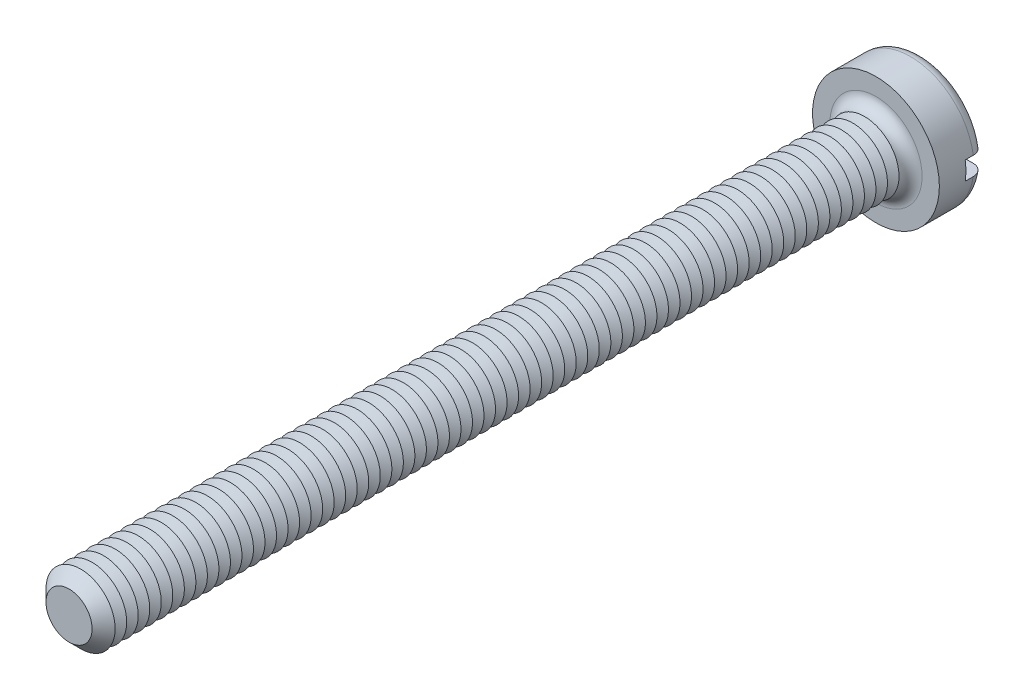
ISO-10303-21;
HEADER;
FILE_DESCRIPTION(('STEP AP214'),'2;1');
FILE_NAME('part.step','',(''),(''),'','','');
FILE_SCHEMA(('AUTOMOTIVE_DESIGN { 1 0 10303 214 1 1 1 1 }'));
ENDSEC;
DATA;
#1=APPLICATION_CONTEXT('core data for automotive mechanical design processes');
#2=APPLICATION_PROTOCOL_DEFINITION('international standard','automotive_design',2000,#1);
#3=PRODUCT_CONTEXT('',#1,'mechanical');
#4=PRODUCT('Part','Part','',(#3));
#5=PRODUCT_RELATED_PRODUCT_CATEGORY('part','',(#4));
#6=PRODUCT_DEFINITION_FORMATION('','',#4);
#7=PRODUCT_DEFINITION_CONTEXT('part definition',#1,'design');
#8=PRODUCT_DEFINITION('design','',#6,#7);
#9=PRODUCT_DEFINITION_SHAPE('','',#8);
#10=(LENGTH_UNIT() NAMED_UNIT(*) SI_UNIT(.MILLI.,.METRE.));
#11=(NAMED_UNIT(*) PLANE_ANGLE_UNIT() SI_UNIT($,.RADIAN.));
#12=(NAMED_UNIT(*) SI_UNIT($,.STERADIAN.) SOLID_ANGLE_UNIT());
#13=UNCERTAINTY_MEASURE_WITH_UNIT(LENGTH_MEASURE(1.E-05),#10,'distance_accuracy_value','');
#14=(GEOMETRIC_REPRESENTATION_CONTEXT(3) GLOBAL_UNCERTAINTY_ASSIGNED_CONTEXT((#13)) GLOBAL_UNIT_ASSIGNED_CONTEXT((#10,
#11,#12)) REPRESENTATION_CONTEXT('',''));
#15=CARTESIAN_POINT('',(0.,0.,0.));
#16=DIRECTION('',(0.,0.,1.));
#17=DIRECTION('',(1.,0.,0.));
#18=AXIS2_PLACEMENT_3D('',#15,#16,#17);
#19=CARTESIAN_POINT('',(0.,0.,-2.));
#20=DIRECTION('',(0.,0.,1.));
#21=DIRECTION('',(1.,0.,0.));
#22=AXIS2_PLACEMENT_3D('',#19,#20,#21);
#23=PLANE('',#22);
#24=CARTESIAN_POINT('',(0.,0.,-2.));
#25=DIRECTION('',(0.,0.,1.));
#26=DIRECTION('',(1.,0.,0.));
#27=AXIS2_PLACEMENT_3D('',#24,#25,#26);
#28=CIRCLE('',#27,2.25);
#29=CARTESIAN_POINT('',(-2.21415898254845,0.4,-2.));
#30=VERTEX_POINT('',#29);
#31=CARTESIAN_POINT('',(2.21415898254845,0.4,-2.));
#32=VERTEX_POINT('',#31);
#33=EDGE_CURVE('E116',#30,#32,#28,.F.);
#34=ORIENTED_EDGE('',*,*,#33,.T.);
#35=DIRECTION('',(1.,0.,0.));
#36=VECTOR('',#35,1.);
#37=CARTESIAN_POINT('',(-2.75,0.400000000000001,-2.));
#38=LINE('',#37,#36);
#39=EDGE_CURVE('E111',#30,#32,#38,.T.);
#40=ORIENTED_EDGE('',*,*,#39,.F.);
#41=EDGE_LOOP('',(#34,#40));
#42=FACE_BOUND('',#41,.T.);
#43=ADVANCED_FACE('F39',(#42),#23,.F.);
#44=CARTESIAN_POINT('',(0.,0.,-1.5));
#45=DIRECTION('',(0.,0.,1.));
#46=DIRECTION('',(1.,0.,0.));
#47=AXIS2_PLACEMENT_3D('',#44,#45,#46);
#48=TOROIDAL_SURFACE('',#47,2.25,0.5);
#49=CARTESIAN_POINT('',(-2.6296588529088,0.400000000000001,-1.78631483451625));
#50=CARTESIAN_POINT('',(-2.61332846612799,0.400000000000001,-1.80942627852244));
#51=CARTESIAN_POINT('',(-2.59501593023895,0.400000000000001,-1.83116426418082));
#52=CARTESIAN_POINT('',(-2.55497423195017,0.400000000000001,-1.87126271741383));
#53=CARTESIAN_POINT('',(-2.53324055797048,0.4,-1.88961865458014));
#54=CARTESIAN_POINT('',(-2.48702796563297,0.4,-1.92241505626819));
#55=CARTESIAN_POINT('',(-2.46255183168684,0.4,-1.93685944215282));
#56=CARTESIAN_POINT('',(-2.41154731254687,0.4,-1.96147315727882));
#57=CARTESIAN_POINT('',(-2.38501943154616,0.4,-1.97164353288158));
#58=CARTESIAN_POINT('',(-2.3303912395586,0.4,-1.98753780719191));
#59=CARTESIAN_POINT('',(-2.30227842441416,0.4,-1.99321871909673));
#60=CARTESIAN_POINT('',(-2.24549884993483,0.4,-1.99984170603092));
#61=CARTESIAN_POINT('',(-2.21683202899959,0.4,-2.00078325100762));
#62=CARTESIAN_POINT('',(-2.15939326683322,0.4,-1.99790249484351));
#63=CARTESIAN_POINT('',(-2.13062419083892,0.4,-1.99402290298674));
#64=CARTESIAN_POINT('',(-2.07413526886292,0.4,-1.98151915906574));
#65=CARTESIAN_POINT('',(-2.04641547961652,0.4,-1.97289475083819));
#66=CARTESIAN_POINT('',(-1.99264697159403,0.4,-1.95107177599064));
#67=CARTESIAN_POINT('',(-1.96660904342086,0.4,-1.93784659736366));
#68=CARTESIAN_POINT('',(-1.91713954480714,0.4,-1.90718730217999));
#69=CARTESIAN_POINT('',(-1.89370795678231,0.4,-1.88975321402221));
#70=CARTESIAN_POINT('',(-1.85029144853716,0.4,-1.85126548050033));
#71=CARTESIAN_POINT('',(-1.83028607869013,0.4,-1.83023492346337));
#72=CARTESIAN_POINT('',(-1.79417432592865,0.4,-1.78505552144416));
#73=CARTESIAN_POINT('',(-1.77806752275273,0.4,-1.76090701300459));
#74=CARTESIAN_POINT('',(-1.75056079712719,0.4,-1.71067721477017));
#75=CARTESIAN_POINT('',(-1.7390748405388,0.4,-1.68464306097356));
#76=CARTESIAN_POINT('',(-1.72075680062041,0.4,-1.63098625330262));
#77=CARTESIAN_POINT('',(-1.71392397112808,0.4,-1.60336385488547));
#78=CARTESIAN_POINT('',(-1.70525661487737,0.4,-1.54801066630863));
#79=CARTESIAN_POINT('',(-1.70330866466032,0.4,-1.52029759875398));
#80=CARTESIAN_POINT('',(-1.70414820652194,0.4,-1.46494458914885));
#81=CARTESIAN_POINT('',(-1.70693532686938,0.4,-1.43730464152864));
#82=CARTESIAN_POINT('',(-1.71709335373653,0.4,-1.38318389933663));
#83=CARTESIAN_POINT('',(-1.72441580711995,0.4,-1.35669397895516));
#84=CARTESIAN_POINT('',(-1.74335830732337,0.4,-1.30529964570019));
#85=CARTESIAN_POINT('',(-1.75497853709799,0.4,-1.2803953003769));
#86=CARTESIAN_POINT('',(-1.78229453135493,0.4,-1.23258298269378));
#87=CARTESIAN_POINT('',(-1.79803217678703,0.4,-1.20969896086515));
#88=CARTESIAN_POINT('',(-1.83304498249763,0.4,-1.16682064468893));
#89=CARTESIAN_POINT('',(-1.85232054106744,0.4,-1.1468266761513));
#90=CARTESIAN_POINT('',(-1.89433695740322,0.4,-1.10980713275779));
#91=CARTESIAN_POINT('',(-1.91714740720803,0.4,-1.09286053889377));
#92=CARTESIAN_POINT('',(-1.96524407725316,0.4,-1.06294809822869));
#93=CARTESIAN_POINT('',(-1.99053056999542,0.4,-1.04998269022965));
#94=CARTESIAN_POINT('',(-2.04340612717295,0.4,-1.02814800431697));
#95=CARTESIAN_POINT('',(-2.07103098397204,0.4,-1.01936532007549));
#96=CARTESIAN_POINT('',(-2.12735840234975,0.4,-1.00652373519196));
#97=CARTESIAN_POINT('',(-2.15606102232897,0.4,-1.00246509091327));
#98=CARTESIAN_POINT('',(-2.21395379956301,0.4,-0.999181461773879));
#99=CARTESIAN_POINT('',(-2.24314598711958,0.4,-0.999992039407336));
#100=CARTESIAN_POINT('',(-2.30097585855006,0.4,-1.00652779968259));
#101=CARTESIAN_POINT('',(-2.32961355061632,0.4,-1.01225290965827));
#102=CARTESIAN_POINT('',(-2.38536238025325,0.4,-1.02843951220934));
#103=CARTESIAN_POINT('',(-2.41248047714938,0.4,-1.03887701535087));
#104=CARTESIAN_POINT('',(-2.46454860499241,0.4,-1.06421009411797));
#105=CARTESIAN_POINT('',(-2.48949875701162,0.4,-1.0791054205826));
#106=CARTESIAN_POINT('',(-2.53620471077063,0.4,-1.11274531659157));
#107=CARTESIAN_POINT('',(-2.55799482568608,0.400000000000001,-1.1314422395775));
#108=CARTESIAN_POINT('',(-2.59807595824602,0.400000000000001,-1.17227176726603));
#109=CARTESIAN_POINT('',(-2.6163672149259,0.400000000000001,-1.19440413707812));
#110=CARTESIAN_POINT('',(-2.64868581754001,0.400000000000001,-1.24117072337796));
#111=CARTESIAN_POINT('',(-2.66276466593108,0.400000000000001,-1.26576935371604));
#112=CARTESIAN_POINT('',(-2.68654482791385,0.400000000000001,-1.31699754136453));
#113=CARTESIAN_POINT('',(-2.69624657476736,0.400000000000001,-1.34362689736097));
#114=CARTESIAN_POINT('',(-2.71090527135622,0.400000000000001,-1.39787706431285));
#115=CARTESIAN_POINT('',(-2.71590826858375,0.400000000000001,-1.4254854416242));
#116=CARTESIAN_POINT('',(-2.72118463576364,0.400000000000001,-1.48115803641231));
#117=CARTESIAN_POINT('',(-2.72145696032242,0.400000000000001,-1.50922235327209));
#118=CARTESIAN_POINT('',(-2.71727180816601,0.400000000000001,-1.56487271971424));
#119=CARTESIAN_POINT('',(-2.71283440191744,0.400000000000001,-1.59246029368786));
#120=CARTESIAN_POINT('',(-2.69939521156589,0.400000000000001,-1.64647499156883));
#121=CARTESIAN_POINT('',(-2.69039909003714,0.400000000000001,-1.67290351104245));
#122=CARTESIAN_POINT('',(-2.67251693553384,0.400000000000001,-1.71382731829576));
#123=CARTESIAN_POINT('',(-2.66497994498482,0.400000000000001,-1.72892686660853));
#124=CARTESIAN_POINT('',(-2.64841616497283,0.400000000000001,-1.75828509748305));
#125=CARTESIAN_POINT('',(-2.63938938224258,0.400000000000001,-1.77254378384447));
#126=CARTESIAN_POINT('',(-2.6296588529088,0.400000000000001,-1.78631483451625));
#127=B_SPLINE_CURVE_WITH_KNOTS('',3,(#49,#50,#51,#52,#53,#54,#55,#56,#57,#58,#59,#60,#61,#62,
#63,#64,#65,#66,#67,#68,#69,#70,#71,#72,#73,#74,#75,#76,#77,#78,#79,#80,#81,#82,#83,#84,#85,#86,
#87,#88,#89,#90,#91,#92,#93,#94,#95,#96,#97,#98,#99,#100,#101,#102,#103,#104,#105,#106,#107,
#108,#109,#110,#111,#112,#113,#114,#115,#116,#117,#118,#119,#120,#121,#122,#123,#124,#125,#126),
.UNSPECIFIED.,.T.,.F.,(4,2,2,2,2,2,2,2,2,2,2,2,2,2,2,2,2,2,2,2,2,2,2,2,2,2,2,2,2,2,2,2,2,2,2,2,
2,2,4),(0.,0.0848338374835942,0.16978050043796,0.254641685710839,0.339482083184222,
0.42512530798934,0.510778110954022,0.597458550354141,0.684143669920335,0.771338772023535,
0.858533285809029,0.945187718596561,1.03183280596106,1.11678035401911,1.20171427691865,
1.28465703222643,1.36759327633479,1.4496584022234,1.53172702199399,1.61466526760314,
1.69761285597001,1.78247103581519,1.86733856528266,1.95389396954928,2.0404540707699,
2.12764713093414,2.21483890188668,2.30159172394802,2.38833969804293,2.4740609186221,
2.55977628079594,2.6443962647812,2.72900787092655,2.81278135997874,2.89657336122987,
2.98000971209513,3.06334267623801,3.113891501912,3.16444009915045),.UNSPECIFIED.);
#128=CARTESIAN_POINT('',(-2.72075357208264,0.400000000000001,-1.50000000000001));
#129=VERTEX_POINT('',#128);
#130=EDGE_CURVE('E722',#129,#30,#127,.T.);
#131=ORIENTED_EDGE('',*,*,#130,.F.);
#132=CARTESIAN_POINT('',(0.,0.,-1.5));
#133=DIRECTION('',(0.,0.,1.));
#134=DIRECTION('',(1.,0.,0.));
#135=AXIS2_PLACEMENT_3D('',#132,#133,#134);
#136=CIRCLE('',#135,2.75);
#137=CARTESIAN_POINT('',(2.7207535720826,0.4,-1.5));
#138=VERTEX_POINT('',#137);
#139=EDGE_CURVE('E124',#138,#129,#136,.T.);
#140=ORIENTED_EDGE('',*,*,#139,.F.);
#141=CARTESIAN_POINT('',(1.7362507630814,0.4,-1.6752840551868));
#142=CARTESIAN_POINT('',(1.74636083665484,0.4,-1.70159961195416));
#143=CARTESIAN_POINT('',(1.7587429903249,0.4,-1.72706707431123));
#144=CARTESIAN_POINT('',(1.78764414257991,0.4,-1.77556609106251));
#145=CARTESIAN_POINT('',(1.80416918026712,0.4,-1.79859401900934));
#146=CARTESIAN_POINT('',(1.84080454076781,0.4,-1.84153587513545));
#147=CARTESIAN_POINT('',(1.86090949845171,0.4,-1.86145438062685));
#148=CARTESIAN_POINT('',(1.9041208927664,0.4,-1.89769607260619));
#149=CARTESIAN_POINT('',(1.92722659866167,0.4,-1.91402013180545));
#150=CARTESIAN_POINT('',(1.97620958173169,0.4,-1.94291288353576));
#151=CARTESIAN_POINT('',(2.00212726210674,0.4,-1.95541309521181));
#152=CARTESIAN_POINT('',(2.05567603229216,0.4,-1.97595143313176));
#153=CARTESIAN_POINT('',(2.08330733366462,0.4,-1.98398900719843));
#154=CARTESIAN_POINT('',(2.13989163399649,0.4,-1.99545904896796));
#155=CARTESIAN_POINT('',(2.16885726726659,0.4,-1.99882930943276));
#156=CARTESIAN_POINT('',(2.22694412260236,0.4,-2.00065872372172));
#157=CARTESIAN_POINT('',(2.25606534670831,0.4,-1.99911781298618));
#158=CARTESIAN_POINT('',(2.31362436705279,0.4,-1.99114818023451));
#159=CARTESIAN_POINT('',(2.34206235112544,0.4,-1.98472081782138));
#160=CARTESIAN_POINT('',(2.39743709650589,0.4,-1.96713601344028));
#161=CARTESIAN_POINT('',(2.42437392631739,0.4,-1.95597878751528));
#162=CARTESIAN_POINT('',(2.47569769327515,0.4,-1.92935960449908));
#163=CARTESIAN_POINT('',(2.50010686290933,0.4,-1.91394052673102));
#164=CARTESIAN_POINT('',(2.54594525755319,0.4,-1.8791725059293));
#165=CARTESIAN_POINT('',(2.56737468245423,0.4,-1.85982382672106));
#166=CARTESIAN_POINT('',(2.60634898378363,0.4,-1.81801641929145));
#167=CARTESIAN_POINT('',(2.6239407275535,0.4,-1.79560138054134));
#168=CARTESIAN_POINT('',(2.65505953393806,0.4,-1.7481077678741));
#169=CARTESIAN_POINT('',(2.66858686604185,0.4,-1.72302937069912));
#170=CARTESIAN_POINT('',(2.69103536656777,0.4,-1.67123055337));
#171=CARTESIAN_POINT('',(2.70000740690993,0.4,-1.64453217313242));
#172=CARTESIAN_POINT('',(2.71330608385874,0.4,-1.59000262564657));
#173=CARTESIAN_POINT('',(2.71763293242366,0.4,-1.5621715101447));
#174=CARTESIAN_POINT('',(2.72149675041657,0.4,-1.50637655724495));
#175=CARTESIAN_POINT('',(2.72106725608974,0.4,-1.47841503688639));
#176=CARTESIAN_POINT('',(2.7155123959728,0.4,-1.42296287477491));
#177=CARTESIAN_POINT('',(2.71038711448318,0.4,-1.39547222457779));
#178=CARTESIAN_POINT('',(2.69560462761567,0.4,-1.34178071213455));
#179=CARTESIAN_POINT('',(2.68595389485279,0.4,-1.31557806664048));
#180=CARTESIAN_POINT('',(2.66240876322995,0.4,-1.26515516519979));
#181=CARTESIAN_POINT('',(2.64851431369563,0.4,-1.24093493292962));
#182=CARTESIAN_POINT('',(2.61681930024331,0.4,-1.19504594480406));
#183=CARTESIAN_POINT('',(2.59900198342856,0.4,-1.17338876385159));
#184=CARTESIAN_POINT('',(2.56001495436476,0.4,-1.13333899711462));
#185=CARTESIAN_POINT('',(2.53884510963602,0.4,-1.11494654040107));
#186=CARTESIAN_POINT('',(2.49354554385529,0.4,-1.08175888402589));
#187=CARTESIAN_POINT('',(2.46938991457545,0.4,-1.06699905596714));
#188=CARTESIAN_POINT('',(2.41896725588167,0.4,-1.04168682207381));
#189=CARTESIAN_POINT('',(2.39270009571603,0.4,-1.03113467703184));
#190=CARTESIAN_POINT('',(2.33844927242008,0.4,-1.01439607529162));
#191=CARTESIAN_POINT('',(2.31044823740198,0.4,-1.00826592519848));
#192=CARTESIAN_POINT('',(2.25381752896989,0.4,-1.00073183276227));
#193=CARTESIAN_POINT('',(2.22518781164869,0.4,-0.999328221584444));
#194=CARTESIAN_POINT('',(2.16774231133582,0.4,-1.00127811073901));
#195=CARTESIAN_POINT('',(2.13892848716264,0.4,-1.00468955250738));
#196=CARTESIAN_POINT('',(2.08227193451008,0.4,-1.01626887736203));
#197=CARTESIAN_POINT('',(2.05442926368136,0.4,-1.02443704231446));
#198=CARTESIAN_POINT('',(2.00032604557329,0.4,-1.04537295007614));
#199=CARTESIAN_POINT('',(1.97407661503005,0.4,-1.05816944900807));
#200=CARTESIAN_POINT('',(1.92411255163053,0.4,-1.08801035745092));
#201=CARTESIAN_POINT('',(1.90039792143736,0.4,-1.10505477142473));
#202=CARTESIAN_POINT('',(1.85633574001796,0.4,-1.14282887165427));
#203=CARTESIAN_POINT('',(1.83597040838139,0.4,-1.16353779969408));
#204=CARTESIAN_POINT('',(1.79908731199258,0.4,-1.20813793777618));
#205=CARTESIAN_POINT('',(1.78256899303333,0.4,-1.23202868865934));
#206=CARTESIAN_POINT('',(1.75420022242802,0.4,-1.28183173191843));
#207=CARTESIAN_POINT('',(1.74226635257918,0.4,-1.30769648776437));
#208=CARTESIAN_POINT('',(1.72302798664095,0.4,-1.36110211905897));
#209=CARTESIAN_POINT('',(1.71572395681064,0.4,-1.38864316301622));
#210=CARTESIAN_POINT('',(1.70611974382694,0.4,-1.44392326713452));
#211=CARTESIAN_POINT('',(1.70370764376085,0.4,-1.47164298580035));
#212=CARTESIAN_POINT('',(1.70363822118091,0.4,-1.52706336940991));
#213=CARTESIAN_POINT('',(1.70597448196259,0.4,-1.55476400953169));
#214=CARTESIAN_POINT('',(1.71335146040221,0.4,-1.59796127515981));
#215=CARTESIAN_POINT('',(1.71686033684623,0.4,-1.61373520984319));
#216=CARTESIAN_POINT('',(1.7254146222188,0.4,-1.64486018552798));
#217=CARTESIAN_POINT('',(1.73045999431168,0.4,-1.66021123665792));
#218=CARTESIAN_POINT('',(1.7362507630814,0.4,-1.6752840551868));
#219=B_SPLINE_CURVE_WITH_KNOTS('',3,(#141,#142,#143,#144,#145,#146,#147,#148,#149,#150,#151,
#152,#153,#154,#155,#156,#157,#158,#159,#160,#161,#162,#163,#164,#165,#166,#167,#168,#169,#170,
#171,#172,#173,#174,#175,#176,#177,#178,#179,#180,#181,#182,#183,#184,#185,#186,#187,#188,#189,
#190,#191,#192,#193,#194,#195,#196,#197,#198,#199,#200,#201,#202,#203,#204,#205,#206,#207,#208,
#209,#210,#211,#212,#213,#214,#215,#216,#217,#218),.UNSPECIFIED.,.T.,.F.,(4,2,2,2,2,2,2,2,2,2,2,
2,2,2,2,2,2,2,2,2,2,2,2,2,2,2,2,2,2,2,2,2,2,2,2,2,2,2,4),(0.,0.0845117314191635,
0.169147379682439,0.253657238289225,0.338146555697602,0.424070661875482,0.510005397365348,
0.597074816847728,0.684145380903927,0.771191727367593,0.858234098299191,0.94443074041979,
1.03062159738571,1.11569223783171,1.20075723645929,1.28485012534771,1.36893917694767,
1.45243570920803,1.53593074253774,1.61930671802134,1.70268368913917,1.7864238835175,
1.87016738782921,1.95469664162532,2.03923113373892,2.12482389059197,2.21042264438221,
2.29706026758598,2.38370302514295,2.47089361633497,2.55808429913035,2.64479602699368,
2.73149525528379,2.81653234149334,2.9015779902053,2.98465497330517,3.06761976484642,
3.11602689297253,3.164432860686),.UNSPECIFIED.);
#220=EDGE_CURVE('E724',#32,#138,#219,.T.);
#221=ORIENTED_EDGE('',*,*,#220,.F.);
#222=ORIENTED_EDGE('',*,*,#33,.F.);
#223=EDGE_LOOP('',(#131,#140,#221,#222));
#224=FACE_BOUND('',#223,.T.);
#225=ADVANCED_FACE('F706',(#224),#48,.T.);
#226=CARTESIAN_POINT('',(0.,0.,-2.));
#227=DIRECTION('',(0.,0.,1.));
#228=DIRECTION('',(1.,0.,0.));
#229=AXIS2_PLACEMENT_3D('',#226,#227,#228);
#230=CYLINDRICAL_SURFACE('',#229,2.75);
#231=DIRECTION('',(0.,0.,1.));
#232=VECTOR('',#231,1.);
#233=CARTESIAN_POINT('',(2.72075357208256,0.4,-2.));
#234=LINE('',#233,#232);
#235=CARTESIAN_POINT('',(2.72075357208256,0.4,-1.15));
#236=VERTEX_POINT('',#235);
#237=EDGE_CURVE('E739',#138,#236,#234,.T.);
#238=ORIENTED_EDGE('',*,*,#237,.F.);
#239=ORIENTED_EDGE('',*,*,#139,.T.);
#240=DIRECTION('',(0.,0.,1.));
#241=VECTOR('',#240,1.);
#242=CARTESIAN_POINT('',(-2.72075357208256,0.4,-2.));
#243=LINE('',#242,#241);
#244=CARTESIAN_POINT('',(-2.72075357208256,0.4,-1.15));
#245=VERTEX_POINT('',#244);
#246=EDGE_CURVE('E63',#245,#129,#243,.F.);
#247=ORIENTED_EDGE('',*,*,#246,.F.);
#248=CARTESIAN_POINT('',(0.,0.,-1.15));
#249=DIRECTION('',(0.,0.,-1.));
#250=DIRECTION('',(-1.,0.,0.));
#251=AXIS2_PLACEMENT_3D('',#248,#249,#250);
#252=CIRCLE('',#251,2.75);
#253=CARTESIAN_POINT('',(-2.72075357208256,-0.4,-1.15));
#254=VERTEX_POINT('',#253);
#255=EDGE_CURVE('E43',#245,#254,#252,.F.);
#256=ORIENTED_EDGE('',*,*,#255,.T.);
#257=DIRECTION('',(0.,0.,1.));
#258=VECTOR('',#257,1.);
#259=CARTESIAN_POINT('',(-2.72075357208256,-0.4,-2.));
#260=LINE('',#259,#258);
#261=CARTESIAN_POINT('',(-2.72075357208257,-0.4,-1.5));
#262=VERTEX_POINT('',#261);
#263=EDGE_CURVE('E736',#262,#254,#260,.T.);
#264=ORIENTED_EDGE('',*,*,#263,.F.);
#265=CARTESIAN_POINT('',(2.72075357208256,-0.4,-1.5));
#266=VERTEX_POINT('',#265);
#267=EDGE_CURVE('E126',#262,#266,#136,.T.);
#268=ORIENTED_EDGE('',*,*,#267,.T.);
#269=DIRECTION('',(0.,0.,1.));
#270=VECTOR('',#269,1.);
#271=CARTESIAN_POINT('',(2.72075357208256,-0.4,-2.));
#272=LINE('',#271,#270);
#273=CARTESIAN_POINT('',(2.72075357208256,-0.4,-1.15));
#274=VERTEX_POINT('',#273);
#275=EDGE_CURVE('E55',#274,#266,#272,.F.);
#276=ORIENTED_EDGE('',*,*,#275,.F.);
#277=EDGE_CURVE('E11',#274,#236,#252,.F.);
#278=ORIENTED_EDGE('',*,*,#277,.T.);
#279=EDGE_LOOP('',(#238,#239,#247,#256,#264,#268,#276,#278));
#280=FACE_BOUND('',#279,.T.);
#281=CARTESIAN_POINT('',(0.,0.,0.));
#282=DIRECTION('',(0.,0.,1.));
#283=DIRECTION('',(1.,0.,0.));
#284=AXIS2_PLACEMENT_3D('',#281,#282,#283);
#285=CIRCLE('',#284,2.75);
#286=CARTESIAN_POINT('',(2.75,0.,0.));
#287=VERTEX_POINT('',#286);
#288=EDGE_CURVE('E742',#287,#287,#285,.T.);
#289=ORIENTED_EDGE('',*,*,#288,.F.);
#290=EDGE_LOOP('',(#289));
#291=FACE_BOUND('',#290,.T.);
#292=ADVANCED_FACE('F702',(#280,#291),#230,.T.);
#293=CARTESIAN_POINT('',(2.21415898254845,-0.4,-2.));
#294=VERTEX_POINT('',#293);
#295=CARTESIAN_POINT('',(-2.21415898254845,-0.4,-2.));
#296=VERTEX_POINT('',#295);
#297=EDGE_CURVE('E109',#294,#296,#28,.F.);
#298=ORIENTED_EDGE('',*,*,#297,.T.);
#299=DIRECTION('',(-1.,0.,0.));
#300=VECTOR('',#299,1.);
#301=CARTESIAN_POINT('',(-2.75,-0.4,-2.));
#302=LINE('',#301,#300);
#303=EDGE_CURVE('E96',#294,#296,#302,.T.);
#304=ORIENTED_EDGE('',*,*,#303,.F.);
#305=EDGE_LOOP('',(#298,#304));
#306=FACE_BOUND('',#305,.T.);
#307=ADVANCED_FACE('F108',(#306),#23,.F.);
#308=CARTESIAN_POINT('',(0.,0.,0.));
#309=DIRECTION('',(0.,0.,1.));
#310=DIRECTION('',(1.,0.,0.));
#311=AXIS2_PLACEMENT_3D('',#308,#309,#310);
#312=PLANE('',#311);
#313=CARTESIAN_POINT('',(0.,0.,0.));
#314=DIRECTION('',(0.,0.,1.));
#315=DIRECTION('',(1.,0.,0.));
#316=AXIS2_PLACEMENT_3D('',#313,#314,#315);
#317=CIRCLE('',#316,2.);
#318=CARTESIAN_POINT('',(2.,0.,0.));
#319=VERTEX_POINT('',#318);
#320=EDGE_CURVE('E115',#319,#319,#317,.F.);
#321=ORIENTED_EDGE('',*,*,#320,.T.);
#322=EDGE_LOOP('',(#321));
#323=FACE_BOUND('',#322,.T.);
#324=ORIENTED_EDGE('',*,*,#288,.T.);
#325=EDGE_LOOP('',(#324));
#326=FACE_BOUND('',#325,.T.);
#327=ADVANCED_FACE('F701',(#323,#326),#312,.T.);
#328=CARTESIAN_POINT('',(-2.6296588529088,-0.4,-1.78631483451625));
#329=CARTESIAN_POINT('',(-2.64575286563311,-0.4,-1.76353353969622));
#330=CARTESIAN_POINT('',(-2.65994473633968,-0.4,-1.73938506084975));
#331=CARTESIAN_POINT('',(-2.68408879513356,-0.4,-1.68903091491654));
#332=CARTESIAN_POINT('',(-2.69403633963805,-0.4,-1.6628230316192));
#333=CARTESIAN_POINT('',(-2.70937899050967,-0.4,-1.60911025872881));
#334=CARTESIAN_POINT('',(-2.71477511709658,-0.4,-1.5816056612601));
#335=CARTESIAN_POINT('',(-2.72085365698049,-0.4,-1.52608718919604));
#336=CARTESIAN_POINT('',(-2.7215371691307,-0.4,-1.49807343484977));
#337=CARTESIAN_POINT('',(-2.71817903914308,-0.4,-1.44242333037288));
#338=CARTESIAN_POINT('',(-2.71415291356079,-0.4,-1.41478604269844));
#339=CARTESIAN_POINT('',(-2.70152104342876,-0.4,-1.36057835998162));
#340=CARTESIAN_POINT('',(-2.69291517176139,-0.4,-1.33400799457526));
#341=CARTESIAN_POINT('',(-2.67137052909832,-0.4,-1.28266198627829));
#342=CARTESIAN_POINT('',(-2.65842829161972,-0.4,-1.25788779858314));
#343=CARTESIAN_POINT('',(-2.62859348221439,-0.4,-1.21084577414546));
#344=CARTESIAN_POINT('',(-2.61170082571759,-0.4,-1.18857799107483));
#345=CARTESIAN_POINT('',(-2.5743351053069,-0.4,-1.1470221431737));
#346=CARTESIAN_POINT('',(-2.55383974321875,-0.4,-1.12775413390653));
#347=CARTESIAN_POINT('',(-2.5099353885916,-0.4,-1.09288845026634));
#348=CARTESIAN_POINT('',(-2.48652625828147,-0.4,-1.07729094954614));
#349=CARTESIAN_POINT('',(-2.43718903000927,-0.4,-1.0500239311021));
#350=CARTESIAN_POINT('',(-2.41123629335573,-0.4,-1.0383990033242));
#351=CARTESIAN_POINT('',(-2.35776417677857,-0.4,-1.01960886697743));
#352=CARTESIAN_POINT('',(-2.33024469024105,-0.4,-1.01244396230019));
#353=CARTESIAN_POINT('',(-2.27404134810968,-0.4,-1.00268156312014));
#354=CARTESIAN_POINT('',(-2.24534705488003,-0.4,-1.00014414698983));
#355=CARTESIAN_POINT('',(-2.18793513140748,-0.4,-0.999867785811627));
#356=CARTESIAN_POINT('',(-2.15921749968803,-0.4,-1.00212917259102));
#357=CARTESIAN_POINT('',(-2.10225052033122,-0.4,-1.01142552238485));
#358=CARTESIAN_POINT('',(-2.07400941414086,-0.4,-1.01851105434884));
#359=CARTESIAN_POINT('',(-2.01911044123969,-0.4,-1.03730994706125));
#360=CARTESIAN_POINT('',(-1.99245264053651,-0.4,-1.04902350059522));
#361=CARTESIAN_POINT('',(-1.94142108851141,-0.4,-1.07679847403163));
#362=CARTESIAN_POINT('',(-1.91705303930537,-0.4,-1.09287038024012));
#363=CARTESIAN_POINT('',(-1.87139758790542,-0.4,-1.12891897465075));
#364=CARTESIAN_POINT('',(-1.85011007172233,-0.4,-1.14889551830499));
#365=CARTESIAN_POINT('',(-1.81149058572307,-0.4,-1.19196940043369));
#366=CARTESIAN_POINT('',(-1.79411779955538,-0.4,-1.21503011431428));
#367=CARTESIAN_POINT('',(-1.76359546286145,-0.4,-1.26379588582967));
#368=CARTESIAN_POINT('',(-1.75044532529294,-0.4,-1.28950057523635));
#369=CARTESIAN_POINT('',(-1.72906221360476,-0.4,-1.3422057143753));
#370=CARTESIAN_POINT('',(-1.72072512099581,-0.4,-1.3691639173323));
#371=CARTESIAN_POINT('',(-1.70880448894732,-0.4,-1.42411084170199));
#372=CARTESIAN_POINT('',(-1.7052202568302,-0.4,-1.45209941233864));
#373=CARTESIAN_POINT('',(-1.70295553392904,-0.4,-1.50768522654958));
#374=CARTESIAN_POINT('',(-1.70417398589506,-0.4,-1.53527840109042));
#375=CARTESIAN_POINT('',(-1.71124536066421,-0.4,-1.58986292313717));
#376=CARTESIAN_POINT('',(-1.71709811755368,-0.4,-1.61685429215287));
#377=CARTESIAN_POINT('',(-1.73321132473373,-0.4,-1.66938107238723));
#378=CARTESIAN_POINT('',(-1.74345625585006,-0.4,-1.69492125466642));
#379=CARTESIAN_POINT('',(-1.76802111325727,-0.4,-1.74395877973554));
#380=CARTESIAN_POINT('',(-1.78234133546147,-0.4,-1.76745597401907));
#381=CARTESIAN_POINT('',(-1.81488631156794,-0.4,-1.81216193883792));
#382=CARTESIAN_POINT('',(-1.83317116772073,-0.4,-1.83332693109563));
#383=CARTESIAN_POINT('',(-1.87296030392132,-0.4,-1.872375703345));
#384=CARTESIAN_POINT('',(-1.89446497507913,-0.4,-1.89025908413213));
#385=CARTESIAN_POINT('',(-1.94063077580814,-0.4,-1.92267732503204));
#386=CARTESIAN_POINT('',(-1.96535444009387,-0.4,-1.93712316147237));
#387=CARTESIAN_POINT('',(-2.01684705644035,-0.4,-1.96173690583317));
#388=CARTESIAN_POINT('',(-2.04361620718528,-0.4,-1.97190439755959));
#389=CARTESIAN_POINT('',(-2.09891021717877,-0.4,-1.9878230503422));
#390=CARTESIAN_POINT('',(-2.12745653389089,-0.4,-1.99349978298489));
#391=CARTESIAN_POINT('',(-2.18509639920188,-0.4,-1.99999556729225));
#392=CARTESIAN_POINT('',(-2.21418994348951,-0.4,-2.00081465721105));
#393=CARTESIAN_POINT('',(-2.27218032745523,-0.4,-1.99755156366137));
#394=CARTESIAN_POINT('',(-2.30107643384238,-0.4,-1.99345627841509));
#395=CARTESIAN_POINT('',(-2.35776697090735,-0.4,-1.98043125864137));
#396=CARTESIAN_POINT('',(-2.38556116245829,-0.4,-1.97150048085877));
#397=CARTESIAN_POINT('',(-2.43901832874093,-0.4,-1.94912081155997));
#398=CARTESIAN_POINT('',(-2.46469578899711,-0.4,-1.93570648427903));
#399=CARTESIAN_POINT('',(-2.51337022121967,-0.4,-1.90471183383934));
#400=CARTESIAN_POINT('',(-2.53637056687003,-0.4,-1.88713684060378));
#401=CARTESIAN_POINT('',(-2.57111030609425,-0.4,-1.85552084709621));
#402=CARTESIAN_POINT('',(-2.58386709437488,-0.4,-1.84257896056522));
#403=CARTESIAN_POINT('',(-2.60790410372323,-0.4,-1.81538935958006));
#404=CARTESIAN_POINT('',(-2.61918433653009,-0.4,-1.80114165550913));
#405=CARTESIAN_POINT('',(-2.6296588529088,-0.4,-1.78631483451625));
#406=B_SPLINE_CURVE_WITH_KNOTS('',3,(#328,#329,#330,#331,#332,#333,#334,#335,#336,#337,#338,
#339,#340,#341,#342,#343,#344,#345,#346,#347,#348,#349,#350,#351,#352,#353,#354,#355,#356,#357,
#358,#359,#360,#361,#362,#363,#364,#365,#366,#367,#368,#369,#370,#371,#372,#373,#374,#375,#376,
#377,#378,#379,#380,#381,#382,#383,#384,#385,#386,#387,#388,#389,#390,#391,#392,#393,#394,#395,
#396,#397,#398,#399,#400,#401,#402,#403,#404,#405),.UNSPECIFIED.,.T.,.F.,(4,2,2,2,2,2,2,2,2,2,2,
2,2,2,2,2,2,2,2,2,2,2,2,2,2,2,2,2,2,2,2,2,2,2,2,2,2,2,4),(0.,0.0836125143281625,
0.167316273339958,0.251001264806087,0.334666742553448,0.418057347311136,0.501450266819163,
0.584910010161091,0.668371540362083,0.752369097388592,0.836370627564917,0.921286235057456,
1.00620762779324,1.09222390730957,1.17824613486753,1.26518425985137,1.35212600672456,
1.43927882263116,1.52642841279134,1.61262232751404,1.69880425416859,1.7830443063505,
1.86727208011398,1.9497371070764,2.03219918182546,2.1143722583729,2.19655130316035,
2.28007615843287,2.36361116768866,2.44911836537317,2.53463387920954,2.62153862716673,
2.70844269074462,2.79557895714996,2.88273403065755,2.96923214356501,3.05562004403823,
3.11003826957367,3.16445606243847),.UNSPECIFIED.);
#407=EDGE_CURVE('E103',#296,#262,#406,.T.);
#408=ORIENTED_EDGE('',*,*,#407,.F.);
#409=ORIENTED_EDGE('',*,*,#297,.F.);
#410=CARTESIAN_POINT('',(1.7362507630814,-0.4,-1.6752840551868));
#411=CARTESIAN_POINT('',(1.72641416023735,-0.4,-1.64967314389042));
#412=CARTESIAN_POINT('',(1.71871480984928,-0.4,-1.62322216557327));
#413=CARTESIAN_POINT('',(1.70786038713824,-0.4,-1.56938399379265));
#414=CARTESIAN_POINT('',(1.70470970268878,-0.4,-1.54199592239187));
#415=CARTESIAN_POINT('',(1.70306971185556,-0.4,-1.48708393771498));
#416=CARTESIAN_POINT('',(1.70457942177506,-0.4,-1.45956005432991));
#417=CARTESIAN_POINT('',(1.71220670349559,-0.4,-1.40516538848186));
#418=CARTESIAN_POINT('',(1.71832341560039,-0.4,-1.3782944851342));
#419=CARTESIAN_POINT('',(1.73494792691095,-0.4,-1.32598312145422));
#420=CARTESIAN_POINT('',(1.74545076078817,-0.4,-1.30054108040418));
#421=CARTESIAN_POINT('',(1.77051013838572,-0.4,-1.25173932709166));
#422=CARTESIAN_POINT('',(1.7850670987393,-0.4,-1.22837982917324));
#423=CARTESIAN_POINT('',(1.81806903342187,-0.4,-1.1839775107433));
#424=CARTESIAN_POINT('',(1.8365752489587,-0.4,-1.16298023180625));
#425=CARTESIAN_POINT('',(1.87677669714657,-0.4,-1.1243010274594));
#426=CARTESIAN_POINT('',(1.89847230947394,-0.4,-1.10661949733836));
#427=CARTESIAN_POINT('',(1.94498854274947,-0.4,-1.07463966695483));
#428=CARTESIAN_POINT('',(1.96987078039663,-0.4,-1.06043095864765));
#429=CARTESIAN_POINT('',(2.02163980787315,-0.4,-1.0363161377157));
#430=CARTESIAN_POINT('',(2.04852678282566,-0.4,-1.02641042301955));
#431=CARTESIAN_POINT('',(2.10400319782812,-0.4,-1.01104128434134));
#432=CARTESIAN_POINT('',(2.13261287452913,-0.4,-1.00565079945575));
#433=CARTESIAN_POINT('',(2.19033179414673,-0.4,-0.999735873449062));
#434=CARTESIAN_POINT('',(2.2194410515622,-0.4,-0.999211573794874));
#435=CARTESIAN_POINT('',(2.27740442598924,-0.4,-1.00306591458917));
#436=CARTESIAN_POINT('',(2.30625777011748,-0.4,-1.00745623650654));
#437=CARTESIAN_POINT('',(2.36280530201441,-0.4,-1.02105937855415));
#438=CARTESIAN_POINT('',(2.39049952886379,-0.4,-1.03027203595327));
#439=CARTESIAN_POINT('',(2.44369359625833,-0.4,-1.05318710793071));
#440=CARTESIAN_POINT('',(2.46920965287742,-0.4,-1.0668518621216));
#441=CARTESIAN_POINT('',(2.51754507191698,-0.4,-1.09832423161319));
#442=CARTESIAN_POINT('',(2.54036461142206,-0.4,-1.11613157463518));
#443=CARTESIAN_POINT('',(2.58234752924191,-0.4,-1.15513986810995));
#444=CARTESIAN_POINT('',(2.601553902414,-0.4,-1.1762945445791));
#445=CARTESIAN_POINT('',(2.63609001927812,-0.4,-1.22156192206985));
#446=CARTESIAN_POINT('',(2.65142002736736,-0.4,-1.24567442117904));
#447=CARTESIAN_POINT('',(2.67757733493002,-0.4,-1.29585881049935));
#448=CARTESIAN_POINT('',(2.68845668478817,-0.4,-1.32190357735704));
#449=CARTESIAN_POINT('',(2.7056478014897,-0.4,-1.375459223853));
#450=CARTESIAN_POINT('',(2.71195980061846,-0.4,-1.40297002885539));
#451=CARTESIAN_POINT('',(2.71979288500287,-0.4,-1.45843707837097));
#452=CARTESIAN_POINT('',(2.72135241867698,-0.4,-1.48638789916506));
#453=CARTESIAN_POINT('',(2.71974298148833,-0.4,-1.54215266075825));
#454=CARTESIAN_POINT('',(2.71657412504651,-0.4,-1.56996660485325));
#455=CARTESIAN_POINT('',(2.70561779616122,-0.4,-1.62459191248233));
#456=CARTESIAN_POINT('',(2.69784258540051,-0.4,-1.65140573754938));
#457=CARTESIAN_POINT('',(2.6779146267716,-0.4,-1.70335337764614));
#458=CARTESIAN_POINT('',(2.66576185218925,-0.4,-1.72848718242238));
#459=CARTESIAN_POINT('',(2.63739107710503,-0.4,-1.77645196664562));
#460=CARTESIAN_POINT('',(2.62116029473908,-0.4,-1.79927538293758));
#461=CARTESIAN_POINT('',(2.58512700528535,-0.4,-1.84190182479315));
#462=CARTESIAN_POINT('',(2.56532438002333,-0.4,-1.86170475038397));
#463=CARTESIAN_POINT('',(2.522535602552,-0.4,-1.89791219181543));
#464=CARTESIAN_POINT('',(2.49952399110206,-0.4,-1.91428661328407));
#465=CARTESIAN_POINT('',(2.45110500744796,-0.4,-1.94299324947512));
#466=CARTESIAN_POINT('',(2.4256974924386,-0.4,-1.95532522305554));
#467=CARTESIAN_POINT('',(2.37288090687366,-0.4,-1.97575769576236));
#468=CARTESIAN_POINT('',(2.34545135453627,-0.4,-1.98380524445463));
#469=CARTESIAN_POINT('',(2.28963821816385,-0.4,-1.99524443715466));
#470=CARTESIAN_POINT('',(2.26125456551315,-0.4,-1.99863574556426));
#471=CARTESIAN_POINT('',(2.20395671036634,-0.4,-2.00070487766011));
#472=CARTESIAN_POINT('',(2.17504033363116,-0.4,-1.99932265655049));
#473=CARTESIAN_POINT('',(2.11784130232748,-0.4,-1.9917648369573));
#474=CARTESIAN_POINT('',(2.08955866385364,-0.4,-1.98558911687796));
#475=CARTESIAN_POINT('',(2.03419451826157,-0.4,-1.96854979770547));
#476=CARTESIAN_POINT('',(2.00712437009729,-0.4,-1.95764925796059));
#477=CARTESIAN_POINT('',(1.95519572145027,-0.4,-1.93144413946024));
#478=CARTESIAN_POINT('',(1.93033780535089,-0.4,-1.91613840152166));
#479=CARTESIAN_POINT('',(1.88362525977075,-0.4,-1.88157419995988));
#480=CARTESIAN_POINT('',(1.86176428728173,-0.4,-1.86232430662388));
#481=CARTESIAN_POINT('',(1.82167218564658,-0.4,-1.82038600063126));
#482=CARTESIAN_POINT('',(1.803436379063,-0.4,-1.7977020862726));
#483=CARTESIAN_POINT('',(1.77700088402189,-0.4,-1.7582526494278));
#484=CARTESIAN_POINT('',(1.7675549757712,-0.4,-1.74230781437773));
#485=CARTESIAN_POINT('',(1.75049861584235,-0.4,-1.70946415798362));
#486=CARTESIAN_POINT('',(1.7428881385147,-0.4,-1.69256534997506));
#487=CARTESIAN_POINT('',(1.7362507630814,-0.4,-1.6752840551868));
#488=B_SPLINE_CURVE_WITH_KNOTS('',3,(#410,#411,#412,#413,#414,#415,#416,#417,#418,#419,#420,
#421,#422,#423,#424,#425,#426,#427,#428,#429,#430,#431,#432,#433,#434,#435,#436,#437,#438,#439,
#440,#441,#442,#443,#444,#445,#446,#447,#448,#449,#450,#451,#452,#453,#454,#455,#456,#457,#458,
#459,#460,#461,#462,#463,#464,#465,#466,#467,#468,#469,#470,#471,#472,#473,#474,#475,#476,#477,
#478,#479,#480,#481,#482,#483,#484,#485,#486,#487),.UNSPECIFIED.,.T.,.F.,(4,2,2,2,2,2,2,2,2,2,2,
2,2,2,2,2,2,2,2,2,2,2,2,2,2,2,2,2,2,2,2,2,2,2,2,2,2,2,4),(0.,0.0822382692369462,
0.164555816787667,0.246855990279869,0.329140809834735,0.411332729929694,0.493533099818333,
0.577115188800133,0.660707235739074,0.746270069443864,0.831840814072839,0.918768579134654,
1.00569887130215,1.09283622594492,1.17997064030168,1.26638632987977,1.35279634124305,
1.43810213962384,1.52340211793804,1.60767384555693,1.69194128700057,1.77552515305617,
1.85910699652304,1.94246734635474,2.02582820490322,2.10945367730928,2.19308191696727,
2.2774160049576,2.36175512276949,2.4471137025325,2.53247843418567,2.61892083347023,
2.70536542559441,2.79249842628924,2.87965437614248,2.96662291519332,3.05347850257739,
3.10897061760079,3.16446195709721),.UNSPECIFIED.);
#489=EDGE_CURVE('E92',#266,#294,#488,.T.);
#490=ORIENTED_EDGE('',*,*,#489,.F.);
#491=ORIENTED_EDGE('',*,*,#267,.F.);
#492=EDGE_LOOP('',(#408,#409,#490,#491));
#493=FACE_BOUND('',#492,.T.);
#494=ADVANCED_FACE('F113',(#493),#48,.T.);
#495=CARTESIAN_POINT('',(0.,0.,0.5));
#496=DIRECTION('',(0.,0.,1.));
#497=DIRECTION('',(1.,0.,0.));
#498=AXIS2_PLACEMENT_3D('',#495,#496,#497);
#499=TOROIDAL_SURFACE('',#498,2.,0.5);
#500=ORIENTED_EDGE('',*,*,#320,.F.);
#501=EDGE_LOOP('',(#500));
#502=FACE_BOUND('',#501,.T.);
#503=CARTESIAN_POINT('',(0.,0.,0.5));
#504=DIRECTION('',(0.,0.,-1.));
#505=DIRECTION('',(-1.,0.,0.));
#506=AXIS2_PLACEMENT_3D('',#503,#504,#505);
#507=CIRCLE('',#506,1.5);
#508=CARTESIAN_POINT('',(-1.5,0.,0.5));
#509=VERTEX_POINT('',#508);
#510=EDGE_CURVE('E748',#509,#509,#507,.T.);
#511=ORIENTED_EDGE('',*,*,#510,.T.);
#512=EDGE_LOOP('',(#511));
#513=FACE_BOUND('',#512,.T.);
#514=ADVANCED_FACE('F694',(#502,#513),#499,.F.);
#515=CARTESIAN_POINT('',(0.,0.,0.750000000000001));
#516=DIRECTION('',(0.,0.,-1.));
#517=DIRECTION('',(-1.,0.,0.));
#518=AXIS2_PLACEMENT_3D('',#515,#516,#517);
#519=CONICAL_SURFACE('',#518,1.06698729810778,1.0471975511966);
#520=ORIENTED_EDGE('',*,*,#510,.F.);
#521=EDGE_LOOP('',(#520));
#522=FACE_BOUND('',#521,.T.);
#523=CARTESIAN_POINT('',(0.,0.,0.750000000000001));
#524=DIRECTION('',(0.,0.,-1.));
#525=DIRECTION('',(-1.,0.,0.));
#526=AXIS2_PLACEMENT_3D('',#523,#524,#525);
#527=CIRCLE('',#526,1.06698729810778);
#528=CARTESIAN_POINT('',(-1.06698729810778,0.,0.750000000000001));
#529=VERTEX_POINT('',#528);
#530=EDGE_CURVE('E754',#529,#529,#527,.T.);
#531=ORIENTED_EDGE('',*,*,#530,.T.);
#532=EDGE_LOOP('',(#531));
#533=FACE_BOUND('',#532,.T.);
#534=ADVANCED_FACE('F690',(#522,#533),#519,.T.);
#535=CARTESIAN_POINT('',(0.,0.,1.));
#536=DIRECTION('',(0.,0.,1.));
#537=DIRECTION('',(1.,0.,0.));
#538=AXIS2_PLACEMENT_3D('',#535,#536,#537);
#539=CONICAL_SURFACE('',#538,1.5,1.0471975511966);
#540=ORIENTED_EDGE('',*,*,#530,.F.);
#541=EDGE_LOOP('',(#540));
#542=FACE_BOUND('',#541,.T.);
#543=CARTESIAN_POINT('',(0.,0.,1.));
#544=DIRECTION('',(0.,0.,-1.));
#545=DIRECTION('',(-1.,0.,0.));
#546=AXIS2_PLACEMENT_3D('',#543,#544,#545);
#547=CIRCLE('',#546,1.5);
#548=CARTESIAN_POINT('',(-1.5,0.,1.));
#549=VERTEX_POINT('',#548);
#550=EDGE_CURVE('E759',#549,#549,#547,.T.);
#551=ORIENTED_EDGE('',*,*,#550,.T.);
#552=EDGE_LOOP('',(#551));
#553=FACE_BOUND('',#552,.T.);
#554=ADVANCED_FACE('F686',(#542,#553),#539,.T.);
#555=CARTESIAN_POINT('',(0.,0.,1.25));
#556=DIRECTION('',(0.,0.,-1.));
#557=DIRECTION('',(-1.,0.,0.));
#558=AXIS2_PLACEMENT_3D('',#555,#556,#557);
#559=CONICAL_SURFACE('',#558,1.06698729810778,1.0471975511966);
#560=ORIENTED_EDGE('',*,*,#550,.F.);
#561=EDGE_LOOP('',(#560));
#562=FACE_BOUND('',#561,.T.);
#563=CARTESIAN_POINT('',(0.,0.,1.25));
#564=DIRECTION('',(0.,0.,-1.));
#565=DIRECTION('',(-1.,0.,0.));
#566=AXIS2_PLACEMENT_3D('',#563,#564,#565);
#567=CIRCLE('',#566,1.06698729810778);
#568=CARTESIAN_POINT('',(-1.06698729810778,0.,1.25));
#569=VERTEX_POINT('',#568);
#570=EDGE_CURVE('E763',#569,#569,#567,.T.);
#571=ORIENTED_EDGE('',*,*,#570,.T.);
#572=EDGE_LOOP('',(#571));
#573=FACE_BOUND('',#572,.T.);
#574=ADVANCED_FACE('F682',(#562,#573),#559,.T.);
#575=CARTESIAN_POINT('',(0.,0.,1.5));
#576=DIRECTION('',(0.,0.,1.));
#577=DIRECTION('',(1.,0.,0.));
#578=AXIS2_PLACEMENT_3D('',#575,#576,#577);
#579=CONICAL_SURFACE('',#578,1.5,1.0471975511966);
#580=ORIENTED_EDGE('',*,*,#570,.F.);
#581=EDGE_LOOP('',(#580));
#582=FACE_BOUND('',#581,.T.);
#583=CARTESIAN_POINT('',(0.,0.,1.5));
#584=DIRECTION('',(0.,0.,-1.));
#585=DIRECTION('',(-1.,0.,0.));
#586=AXIS2_PLACEMENT_3D('',#583,#584,#585);
#587=CIRCLE('',#586,1.5);
#588=CARTESIAN_POINT('',(-1.5,0.,1.5));
#589=VERTEX_POINT('',#588);
#590=EDGE_CURVE('E767',#589,#589,#587,.T.);
#591=ORIENTED_EDGE('',*,*,#590,.T.);
#592=EDGE_LOOP('',(#591));
#593=FACE_BOUND('',#592,.T.);
#594=ADVANCED_FACE('F678',(#582,#593),#579,.T.);
#595=CARTESIAN_POINT('',(0.,0.,1.75));
#596=DIRECTION('',(0.,0.,-1.));
#597=DIRECTION('',(-1.,0.,0.));
#598=AXIS2_PLACEMENT_3D('',#595,#596,#597);
#599=CONICAL_SURFACE('',#598,1.06698729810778,1.0471975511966);
#600=ORIENTED_EDGE('',*,*,#590,.F.);
#601=EDGE_LOOP('',(#600));
#602=FACE_BOUND('',#601,.T.);
#603=CARTESIAN_POINT('',(0.,0.,1.75));
#604=DIRECTION('',(0.,0.,-1.));
#605=DIRECTION('',(-1.,0.,0.));
#606=AXIS2_PLACEMENT_3D('',#603,#604,#605);
#607=CIRCLE('',#606,1.06698729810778);
#608=CARTESIAN_POINT('',(-1.06698729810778,0.,1.75));
#609=VERTEX_POINT('',#608);
#610=EDGE_CURVE('E771',#609,#609,#607,.T.);
#611=ORIENTED_EDGE('',*,*,#610,.T.);
#612=EDGE_LOOP('',(#611));
#613=FACE_BOUND('',#612,.T.);
#614=ADVANCED_FACE('F674',(#602,#613),#599,.T.);
#615=CARTESIAN_POINT('',(0.,0.,2.));
#616=DIRECTION('',(0.,0.,1.));
#617=DIRECTION('',(1.,0.,0.));
#618=AXIS2_PLACEMENT_3D('',#615,#616,#617);
#619=CONICAL_SURFACE('',#618,1.5,1.0471975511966);
#620=ORIENTED_EDGE('',*,*,#610,.F.);
#621=EDGE_LOOP('',(#620));
#622=FACE_BOUND('',#621,.T.);
#623=CARTESIAN_POINT('',(0.,0.,2.));
#624=DIRECTION('',(0.,0.,-1.));
#625=DIRECTION('',(-1.,0.,0.));
#626=AXIS2_PLACEMENT_3D('',#623,#624,#625);
#627=CIRCLE('',#626,1.5);
#628=CARTESIAN_POINT('',(-1.5,0.,2.));
#629=VERTEX_POINT('',#628);
#630=EDGE_CURVE('E775',#629,#629,#627,.T.);
#631=ORIENTED_EDGE('',*,*,#630,.T.);
#632=EDGE_LOOP('',(#631));
#633=FACE_BOUND('',#632,.T.);
#634=ADVANCED_FACE('F670',(#622,#633),#619,.T.);
#635=CARTESIAN_POINT('',(0.,0.,2.25));
#636=DIRECTION('',(0.,0.,-1.));
#637=DIRECTION('',(-1.,0.,0.));
#638=AXIS2_PLACEMENT_3D('',#635,#636,#637);
#639=CONICAL_SURFACE('',#638,1.06698729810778,1.0471975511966);
#640=ORIENTED_EDGE('',*,*,#630,.F.);
#641=EDGE_LOOP('',(#640));
#642=FACE_BOUND('',#641,.T.);
#643=CARTESIAN_POINT('',(0.,0.,2.25));
#644=DIRECTION('',(0.,0.,-1.));
#645=DIRECTION('',(-1.,0.,0.));
#646=AXIS2_PLACEMENT_3D('',#643,#644,#645);
#647=CIRCLE('',#646,1.06698729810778);
#648=CARTESIAN_POINT('',(-1.06698729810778,0.,2.25));
#649=VERTEX_POINT('',#648);
#650=EDGE_CURVE('E779',#649,#649,#647,.T.);
#651=ORIENTED_EDGE('',*,*,#650,.T.);
#652=EDGE_LOOP('',(#651));
#653=FACE_BOUND('',#652,.T.);
#654=ADVANCED_FACE('F666',(#642,#653),#639,.T.);
#655=CARTESIAN_POINT('',(0.,0.,2.5));
#656=DIRECTION('',(0.,0.,1.));
#657=DIRECTION('',(1.,0.,0.));
#658=AXIS2_PLACEMENT_3D('',#655,#656,#657);
#659=CONICAL_SURFACE('',#658,1.5,1.0471975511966);
#660=ORIENTED_EDGE('',*,*,#650,.F.);
#661=EDGE_LOOP('',(#660));
#662=FACE_BOUND('',#661,.T.);
#663=CARTESIAN_POINT('',(0.,0.,2.5));
#664=DIRECTION('',(0.,0.,-1.));
#665=DIRECTION('',(-1.,0.,0.));
#666=AXIS2_PLACEMENT_3D('',#663,#664,#665);
#667=CIRCLE('',#666,1.5);
#668=CARTESIAN_POINT('',(-1.5,0.,2.5));
#669=VERTEX_POINT('',#668);
#670=EDGE_CURVE('E783',#669,#669,#667,.T.);
#671=ORIENTED_EDGE('',*,*,#670,.T.);
#672=EDGE_LOOP('',(#671));
#673=FACE_BOUND('',#672,.T.);
#674=ADVANCED_FACE('F662',(#662,#673),#659,.T.);
#675=CARTESIAN_POINT('',(0.,0.,2.75));
#676=DIRECTION('',(0.,0.,-1.));
#677=DIRECTION('',(-1.,0.,0.));
#678=AXIS2_PLACEMENT_3D('',#675,#676,#677);
#679=CONICAL_SURFACE('',#678,1.06698729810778,1.0471975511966);
#680=ORIENTED_EDGE('',*,*,#670,.F.);
#681=EDGE_LOOP('',(#680));
#682=FACE_BOUND('',#681,.T.);
#683=CARTESIAN_POINT('',(0.,0.,2.75));
#684=DIRECTION('',(0.,0.,-1.));
#685=DIRECTION('',(-1.,0.,0.));
#686=AXIS2_PLACEMENT_3D('',#683,#684,#685);
#687=CIRCLE('',#686,1.06698729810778);
#688=CARTESIAN_POINT('',(-1.06698729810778,0.,2.75));
#689=VERTEX_POINT('',#688);
#690=EDGE_CURVE('E787',#689,#689,#687,.T.);
#691=ORIENTED_EDGE('',*,*,#690,.T.);
#692=EDGE_LOOP('',(#691));
#693=FACE_BOUND('',#692,.T.);
#694=ADVANCED_FACE('F658',(#682,#693),#679,.T.);
#695=CARTESIAN_POINT('',(0.,0.,3.));
#696=DIRECTION('',(0.,0.,1.));
#697=DIRECTION('',(1.,0.,0.));
#698=AXIS2_PLACEMENT_3D('',#695,#696,#697);
#699=CONICAL_SURFACE('',#698,1.5,1.0471975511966);
#700=ORIENTED_EDGE('',*,*,#690,.F.);
#701=EDGE_LOOP('',(#700));
#702=FACE_BOUND('',#701,.T.);
#703=CARTESIAN_POINT('',(0.,0.,3.));
#704=DIRECTION('',(0.,0.,-1.));
#705=DIRECTION('',(-1.,0.,0.));
#706=AXIS2_PLACEMENT_3D('',#703,#704,#705);
#707=CIRCLE('',#706,1.5);
#708=CARTESIAN_POINT('',(-1.5,0.,3.));
#709=VERTEX_POINT('',#708);
#710=EDGE_CURVE('E790',#709,#709,#707,.T.);
#711=ORIENTED_EDGE('',*,*,#710,.T.);
#712=EDGE_LOOP('',(#711));
#713=FACE_BOUND('',#712,.T.);
#714=ADVANCED_FACE('F654',(#702,#713),#699,.T.);
#715=CARTESIAN_POINT('',(0.,0.,3.25));
#716=DIRECTION('',(0.,0.,-1.));
#717=DIRECTION('',(-1.,0.,0.));
#718=AXIS2_PLACEMENT_3D('',#715,#716,#717);
#719=CONICAL_SURFACE('',#718,1.06698729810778,1.0471975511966);
#720=ORIENTED_EDGE('',*,*,#710,.F.);
#721=EDGE_LOOP('',(#720));
#722=FACE_BOUND('',#721,.T.);
#723=CARTESIAN_POINT('',(0.,0.,3.25));
#724=DIRECTION('',(0.,0.,-1.));
#725=DIRECTION('',(-1.,0.,0.));
#726=AXIS2_PLACEMENT_3D('',#723,#724,#725);
#727=CIRCLE('',#726,1.06698729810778);
#728=CARTESIAN_POINT('',(-1.06698729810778,0.,3.25));
#729=VERTEX_POINT('',#728);
#730=EDGE_CURVE('E793',#729,#729,#727,.T.);
#731=ORIENTED_EDGE('',*,*,#730,.T.);
#732=EDGE_LOOP('',(#731));
#733=FACE_BOUND('',#732,.T.);
#734=ADVANCED_FACE('F650',(#722,#733),#719,.T.);
#735=CARTESIAN_POINT('',(0.,0.,3.5));
#736=DIRECTION('',(0.,0.,1.));
#737=DIRECTION('',(1.,0.,0.));
#738=AXIS2_PLACEMENT_3D('',#735,#736,#737);
#739=CONICAL_SURFACE('',#738,1.5,1.0471975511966);
#740=ORIENTED_EDGE('',*,*,#730,.F.);
#741=EDGE_LOOP('',(#740));
#742=FACE_BOUND('',#741,.T.);
#743=CARTESIAN_POINT('',(0.,0.,3.5));
#744=DIRECTION('',(0.,0.,-1.));
#745=DIRECTION('',(-1.,0.,0.));
#746=AXIS2_PLACEMENT_3D('',#743,#744,#745);
#747=CIRCLE('',#746,1.5);
#748=CARTESIAN_POINT('',(-1.5,0.,3.5));
#749=VERTEX_POINT('',#748);
#750=EDGE_CURVE('E797',#749,#749,#747,.T.);
#751=ORIENTED_EDGE('',*,*,#750,.T.);
#752=EDGE_LOOP('',(#751));
#753=FACE_BOUND('',#752,.T.);
#754=ADVANCED_FACE('F646',(#742,#753),#739,.T.);
#755=CARTESIAN_POINT('',(0.,0.,3.75));
#756=DIRECTION('',(0.,0.,-1.));
#757=DIRECTION('',(-1.,0.,0.));
#758=AXIS2_PLACEMENT_3D('',#755,#756,#757);
#759=CONICAL_SURFACE('',#758,1.06698729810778,1.0471975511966);
#760=ORIENTED_EDGE('',*,*,#750,.F.);
#761=EDGE_LOOP('',(#760));
#762=FACE_BOUND('',#761,.T.);
#763=CARTESIAN_POINT('',(0.,0.,3.75));
#764=DIRECTION('',(0.,0.,-1.));
#765=DIRECTION('',(-1.,0.,0.));
#766=AXIS2_PLACEMENT_3D('',#763,#764,#765);
#767=CIRCLE('',#766,1.06698729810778);
#768=CARTESIAN_POINT('',(-1.06698729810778,0.,3.75));
#769=VERTEX_POINT('',#768);
#770=EDGE_CURVE('E801',#769,#769,#767,.T.);
#771=ORIENTED_EDGE('',*,*,#770,.T.);
#772=EDGE_LOOP('',(#771));
#773=FACE_BOUND('',#772,.T.);
#774=ADVANCED_FACE('F642',(#762,#773),#759,.T.);
#775=CARTESIAN_POINT('',(0.,0.,4.));
#776=DIRECTION('',(0.,0.,1.));
#777=DIRECTION('',(1.,0.,0.));
#778=AXIS2_PLACEMENT_3D('',#775,#776,#777);
#779=CONICAL_SURFACE('',#778,1.5,1.0471975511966);
#780=ORIENTED_EDGE('',*,*,#770,.F.);
#781=EDGE_LOOP('',(#780));
#782=FACE_BOUND('',#781,.T.);
#783=CARTESIAN_POINT('',(0.,0.,4.));
#784=DIRECTION('',(0.,0.,-1.));
#785=DIRECTION('',(-1.,0.,0.));
#786=AXIS2_PLACEMENT_3D('',#783,#784,#785);
#787=CIRCLE('',#786,1.5);
#788=CARTESIAN_POINT('',(-1.5,0.,4.));
#789=VERTEX_POINT('',#788);
#790=EDGE_CURVE('E805',#789,#789,#787,.T.);
#791=ORIENTED_EDGE('',*,*,#790,.T.);
#792=EDGE_LOOP('',(#791));
#793=FACE_BOUND('',#792,.T.);
#794=ADVANCED_FACE('F638',(#782,#793),#779,.T.);
#795=CARTESIAN_POINT('',(0.,0.,4.25));
#796=DIRECTION('',(0.,0.,-1.));
#797=DIRECTION('',(-1.,0.,0.));
#798=AXIS2_PLACEMENT_3D('',#795,#796,#797);
#799=CONICAL_SURFACE('',#798,1.06698729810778,1.0471975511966);
#800=ORIENTED_EDGE('',*,*,#790,.F.);
#801=EDGE_LOOP('',(#800));
#802=FACE_BOUND('',#801,.T.);
#803=CARTESIAN_POINT('',(0.,0.,4.25));
#804=DIRECTION('',(0.,0.,-1.));
#805=DIRECTION('',(-1.,0.,0.));
#806=AXIS2_PLACEMENT_3D('',#803,#804,#805);
#807=CIRCLE('',#806,1.06698729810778);
#808=CARTESIAN_POINT('',(-1.06698729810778,0.,4.25));
#809=VERTEX_POINT('',#808);
#810=EDGE_CURVE('E809',#809,#809,#807,.T.);
#811=ORIENTED_EDGE('',*,*,#810,.T.);
#812=EDGE_LOOP('',(#811));
#813=FACE_BOUND('',#812,.T.);
#814=ADVANCED_FACE('F634',(#802,#813),#799,.T.);
#815=CARTESIAN_POINT('',(0.,0.,4.5));
#816=DIRECTION('',(0.,0.,1.));
#817=DIRECTION('',(1.,0.,0.));
#818=AXIS2_PLACEMENT_3D('',#815,#816,#817);
#819=CONICAL_SURFACE('',#818,1.5,1.0471975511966);
#820=ORIENTED_EDGE('',*,*,#810,.F.);
#821=EDGE_LOOP('',(#820));
#822=FACE_BOUND('',#821,.T.);
#823=CARTESIAN_POINT('',(0.,0.,4.5));
#824=DIRECTION('',(0.,0.,-1.));
#825=DIRECTION('',(-1.,0.,0.));
#826=AXIS2_PLACEMENT_3D('',#823,#824,#825);
#827=CIRCLE('',#826,1.5);
#828=CARTESIAN_POINT('',(-1.5,0.,4.5));
#829=VERTEX_POINT('',#828);
#830=EDGE_CURVE('E813',#829,#829,#827,.T.);
#831=ORIENTED_EDGE('',*,*,#830,.T.);
#832=EDGE_LOOP('',(#831));
#833=FACE_BOUND('',#832,.T.);
#834=ADVANCED_FACE('F630',(#822,#833),#819,.T.);
#835=CARTESIAN_POINT('',(0.,0.,4.75));
#836=DIRECTION('',(0.,0.,-1.));
#837=DIRECTION('',(-1.,0.,0.));
#838=AXIS2_PLACEMENT_3D('',#835,#836,#837);
#839=CONICAL_SURFACE('',#838,1.06698729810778,1.0471975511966);
#840=ORIENTED_EDGE('',*,*,#830,.F.);
#841=EDGE_LOOP('',(#840));
#842=FACE_BOUND('',#841,.T.);
#843=CARTESIAN_POINT('',(0.,0.,4.75));
#844=DIRECTION('',(0.,0.,-1.));
#845=DIRECTION('',(-1.,0.,0.));
#846=AXIS2_PLACEMENT_3D('',#843,#844,#845);
#847=CIRCLE('',#846,1.06698729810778);
#848=CARTESIAN_POINT('',(-1.06698729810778,0.,4.75));
#849=VERTEX_POINT('',#848);
#850=EDGE_CURVE('E817',#849,#849,#847,.T.);
#851=ORIENTED_EDGE('',*,*,#850,.T.);
#852=EDGE_LOOP('',(#851));
#853=FACE_BOUND('',#852,.T.);
#854=ADVANCED_FACE('F626',(#842,#853),#839,.T.);
#855=CARTESIAN_POINT('',(0.,0.,5.));
#856=DIRECTION('',(0.,0.,1.));
#857=DIRECTION('',(1.,0.,0.));
#858=AXIS2_PLACEMENT_3D('',#855,#856,#857);
#859=CONICAL_SURFACE('',#858,1.5,1.0471975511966);
#860=ORIENTED_EDGE('',*,*,#850,.F.);
#861=EDGE_LOOP('',(#860));
#862=FACE_BOUND('',#861,.T.);
#863=CARTESIAN_POINT('',(0.,0.,5.));
#864=DIRECTION('',(0.,0.,-1.));
#865=DIRECTION('',(-1.,0.,0.));
#866=AXIS2_PLACEMENT_3D('',#863,#864,#865);
#867=CIRCLE('',#866,1.5);
#868=CARTESIAN_POINT('',(-1.5,0.,5.));
#869=VERTEX_POINT('',#868);
#870=EDGE_CURVE('E821',#869,#869,#867,.T.);
#871=ORIENTED_EDGE('',*,*,#870,.T.);
#872=EDGE_LOOP('',(#871));
#873=FACE_BOUND('',#872,.T.);
#874=ADVANCED_FACE('F622',(#862,#873),#859,.T.);
#875=CARTESIAN_POINT('',(0.,0.,5.25));
#876=DIRECTION('',(0.,0.,-1.));
#877=DIRECTION('',(-1.,0.,0.));
#878=AXIS2_PLACEMENT_3D('',#875,#876,#877);
#879=CONICAL_SURFACE('',#878,1.06698729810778,1.0471975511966);
#880=ORIENTED_EDGE('',*,*,#870,.F.);
#881=EDGE_LOOP('',(#880));
#882=FACE_BOUND('',#881,.T.);
#883=CARTESIAN_POINT('',(0.,0.,5.25));
#884=DIRECTION('',(0.,0.,-1.));
#885=DIRECTION('',(-1.,0.,0.));
#886=AXIS2_PLACEMENT_3D('',#883,#884,#885);
#887=CIRCLE('',#886,1.06698729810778);
#888=CARTESIAN_POINT('',(-1.06698729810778,0.,5.25));
#889=VERTEX_POINT('',#888);
#890=EDGE_CURVE('E825',#889,#889,#887,.T.);
#891=ORIENTED_EDGE('',*,*,#890,.T.);
#892=EDGE_LOOP('',(#891));
#893=FACE_BOUND('',#892,.T.);
#894=ADVANCED_FACE('F618',(#882,#893),#879,.T.);
#895=CARTESIAN_POINT('',(0.,0.,5.5));
#896=DIRECTION('',(0.,0.,1.));
#897=DIRECTION('',(1.,0.,0.));
#898=AXIS2_PLACEMENT_3D('',#895,#896,#897);
#899=CONICAL_SURFACE('',#898,1.5,1.0471975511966);
#900=ORIENTED_EDGE('',*,*,#890,.F.);
#901=EDGE_LOOP('',(#900));
#902=FACE_BOUND('',#901,.T.);
#903=CARTESIAN_POINT('',(0.,0.,5.5));
#904=DIRECTION('',(0.,0.,-1.));
#905=DIRECTION('',(-1.,0.,0.));
#906=AXIS2_PLACEMENT_3D('',#903,#904,#905);
#907=CIRCLE('',#906,1.5);
#908=CARTESIAN_POINT('',(-1.5,0.,5.5));
#909=VERTEX_POINT('',#908);
#910=EDGE_CURVE('E829',#909,#909,#907,.T.);
#911=ORIENTED_EDGE('',*,*,#910,.T.);
#912=EDGE_LOOP('',(#911));
#913=FACE_BOUND('',#912,.T.);
#914=ADVANCED_FACE('F614',(#902,#913),#899,.T.);
#915=CARTESIAN_POINT('',(0.,0.,5.75));
#916=DIRECTION('',(0.,0.,-1.));
#917=DIRECTION('',(-1.,0.,0.));
#918=AXIS2_PLACEMENT_3D('',#915,#916,#917);
#919=CONICAL_SURFACE('',#918,1.06698729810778,1.0471975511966);
#920=ORIENTED_EDGE('',*,*,#910,.F.);
#921=EDGE_LOOP('',(#920));
#922=FACE_BOUND('',#921,.T.);
#923=CARTESIAN_POINT('',(0.,0.,5.75));
#924=DIRECTION('',(0.,0.,-1.));
#925=DIRECTION('',(-1.,0.,0.));
#926=AXIS2_PLACEMENT_3D('',#923,#924,#925);
#927=CIRCLE('',#926,1.06698729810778);
#928=CARTESIAN_POINT('',(-1.06698729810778,0.,5.75));
#929=VERTEX_POINT('',#928);
#930=EDGE_CURVE('E833',#929,#929,#927,.T.);
#931=ORIENTED_EDGE('',*,*,#930,.T.);
#932=EDGE_LOOP('',(#931));
#933=FACE_BOUND('',#932,.T.);
#934=ADVANCED_FACE('F610',(#922,#933),#919,.T.);
#935=CARTESIAN_POINT('',(0.,0.,6.));
#936=DIRECTION('',(0.,0.,1.));
#937=DIRECTION('',(1.,0.,0.));
#938=AXIS2_PLACEMENT_3D('',#935,#936,#937);
#939=CONICAL_SURFACE('',#938,1.5,1.0471975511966);
#940=ORIENTED_EDGE('',*,*,#930,.F.);
#941=EDGE_LOOP('',(#940));
#942=FACE_BOUND('',#941,.T.);
#943=CARTESIAN_POINT('',(0.,0.,6.));
#944=DIRECTION('',(0.,0.,-1.));
#945=DIRECTION('',(-1.,0.,0.));
#946=AXIS2_PLACEMENT_3D('',#943,#944,#945);
#947=CIRCLE('',#946,1.5);
#948=CARTESIAN_POINT('',(-1.5,0.,6.));
#949=VERTEX_POINT('',#948);
#950=EDGE_CURVE('E837',#949,#949,#947,.T.);
#951=ORIENTED_EDGE('',*,*,#950,.T.);
#952=EDGE_LOOP('',(#951));
#953=FACE_BOUND('',#952,.T.);
#954=ADVANCED_FACE('F606',(#942,#953),#939,.T.);
#955=CARTESIAN_POINT('',(0.,0.,6.25));
#956=DIRECTION('',(0.,0.,-1.));
#957=DIRECTION('',(-1.,0.,0.));
#958=AXIS2_PLACEMENT_3D('',#955,#956,#957);
#959=CONICAL_SURFACE('',#958,1.06698729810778,1.0471975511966);
#960=ORIENTED_EDGE('',*,*,#950,.F.);
#961=EDGE_LOOP('',(#960));
#962=FACE_BOUND('',#961,.T.);
#963=CARTESIAN_POINT('',(0.,0.,6.25));
#964=DIRECTION('',(0.,0.,-1.));
#965=DIRECTION('',(-1.,0.,0.));
#966=AXIS2_PLACEMENT_3D('',#963,#964,#965);
#967=CIRCLE('',#966,1.06698729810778);
#968=CARTESIAN_POINT('',(-1.06698729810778,0.,6.25));
#969=VERTEX_POINT('',#968);
#970=EDGE_CURVE('E841',#969,#969,#967,.T.);
#971=ORIENTED_EDGE('',*,*,#970,.T.);
#972=EDGE_LOOP('',(#971));
#973=FACE_BOUND('',#972,.T.);
#974=ADVANCED_FACE('F602',(#962,#973),#959,.T.);
#975=CARTESIAN_POINT('',(0.,0.,6.5));
#976=DIRECTION('',(0.,0.,1.));
#977=DIRECTION('',(1.,0.,0.));
#978=AXIS2_PLACEMENT_3D('',#975,#976,#977);
#979=CONICAL_SURFACE('',#978,1.5,1.0471975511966);
#980=ORIENTED_EDGE('',*,*,#970,.F.);
#981=EDGE_LOOP('',(#980));
#982=FACE_BOUND('',#981,.T.);
#983=CARTESIAN_POINT('',(0.,0.,6.5));
#984=DIRECTION('',(0.,0.,-1.));
#985=DIRECTION('',(-1.,0.,0.));
#986=AXIS2_PLACEMENT_3D('',#983,#984,#985);
#987=CIRCLE('',#986,1.5);
#988=CARTESIAN_POINT('',(-1.5,0.,6.5));
#989=VERTEX_POINT('',#988);
#990=EDGE_CURVE('E845',#989,#989,#987,.T.);
#991=ORIENTED_EDGE('',*,*,#990,.T.);
#992=EDGE_LOOP('',(#991));
#993=FACE_BOUND('',#992,.T.);
#994=ADVANCED_FACE('F598',(#982,#993),#979,.T.);
#995=CARTESIAN_POINT('',(0.,0.,6.75));
#996=DIRECTION('',(0.,0.,-1.));
#997=DIRECTION('',(-1.,0.,0.));
#998=AXIS2_PLACEMENT_3D('',#995,#996,#997);
#999=CONICAL_SURFACE('',#998,1.06698729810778,1.0471975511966);
#1000=ORIENTED_EDGE('',*,*,#990,.F.);
#1001=EDGE_LOOP('',(#1000));
#1002=FACE_BOUND('',#1001,.T.);
#1003=CARTESIAN_POINT('',(0.,0.,6.75));
#1004=DIRECTION('',(0.,0.,-1.));
#1005=DIRECTION('',(-1.,0.,0.));
#1006=AXIS2_PLACEMENT_3D('',#1003,#1004,#1005);
#1007=CIRCLE('',#1006,1.06698729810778);
#1008=CARTESIAN_POINT('',(-1.06698729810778,0.,6.75));
#1009=VERTEX_POINT('',#1008);
#1010=EDGE_CURVE('E849',#1009,#1009,#1007,.T.);
#1011=ORIENTED_EDGE('',*,*,#1010,.T.);
#1012=EDGE_LOOP('',(#1011));
#1013=FACE_BOUND('',#1012,.T.);
#1014=ADVANCED_FACE('F594',(#1002,#1013),#999,.T.);
#1015=CARTESIAN_POINT('',(0.,0.,7.));
#1016=DIRECTION('',(0.,0.,1.));
#1017=DIRECTION('',(1.,0.,0.));
#1018=AXIS2_PLACEMENT_3D('',#1015,#1016,#1017);
#1019=CONICAL_SURFACE('',#1018,1.5,1.0471975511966);
#1020=ORIENTED_EDGE('',*,*,#1010,.F.);
#1021=EDGE_LOOP('',(#1020));
#1022=FACE_BOUND('',#1021,.T.);
#1023=CARTESIAN_POINT('',(0.,0.,7.));
#1024=DIRECTION('',(0.,0.,-1.));
#1025=DIRECTION('',(-1.,0.,0.));
#1026=AXIS2_PLACEMENT_3D('',#1023,#1024,#1025);
#1027=CIRCLE('',#1026,1.5);
#1028=CARTESIAN_POINT('',(-1.5,0.,7.));
#1029=VERTEX_POINT('',#1028);
#1030=EDGE_CURVE('E853',#1029,#1029,#1027,.T.);
#1031=ORIENTED_EDGE('',*,*,#1030,.T.);
#1032=EDGE_LOOP('',(#1031));
#1033=FACE_BOUND('',#1032,.T.);
#1034=ADVANCED_FACE('F590',(#1022,#1033),#1019,.T.);
#1035=CARTESIAN_POINT('',(0.,0.,7.25));
#1036=DIRECTION('',(0.,0.,-1.));
#1037=DIRECTION('',(-1.,0.,0.));
#1038=AXIS2_PLACEMENT_3D('',#1035,#1036,#1037);
#1039=CONICAL_SURFACE('',#1038,1.06698729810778,1.0471975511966);
#1040=ORIENTED_EDGE('',*,*,#1030,.F.);
#1041=EDGE_LOOP('',(#1040));
#1042=FACE_BOUND('',#1041,.T.);
#1043=CARTESIAN_POINT('',(0.,0.,7.25));
#1044=DIRECTION('',(0.,0.,-1.));
#1045=DIRECTION('',(-1.,0.,0.));
#1046=AXIS2_PLACEMENT_3D('',#1043,#1044,#1045);
#1047=CIRCLE('',#1046,1.06698729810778);
#1048=CARTESIAN_POINT('',(-1.06698729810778,0.,7.25));
#1049=VERTEX_POINT('',#1048);
#1050=EDGE_CURVE('E857',#1049,#1049,#1047,.T.);
#1051=ORIENTED_EDGE('',*,*,#1050,.T.);
#1052=EDGE_LOOP('',(#1051));
#1053=FACE_BOUND('',#1052,.T.);
#1054=ADVANCED_FACE('F586',(#1042,#1053),#1039,.T.);
#1055=CARTESIAN_POINT('',(0.,0.,7.5));
#1056=DIRECTION('',(0.,0.,1.));
#1057=DIRECTION('',(1.,0.,0.));
#1058=AXIS2_PLACEMENT_3D('',#1055,#1056,#1057);
#1059=CONICAL_SURFACE('',#1058,1.5,1.0471975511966);
#1060=ORIENTED_EDGE('',*,*,#1050,.F.);
#1061=EDGE_LOOP('',(#1060));
#1062=FACE_BOUND('',#1061,.T.);
#1063=CARTESIAN_POINT('',(0.,0.,7.5));
#1064=DIRECTION('',(0.,0.,-1.));
#1065=DIRECTION('',(-1.,0.,0.));
#1066=AXIS2_PLACEMENT_3D('',#1063,#1064,#1065);
#1067=CIRCLE('',#1066,1.5);
#1068=CARTESIAN_POINT('',(-1.5,0.,7.5));
#1069=VERTEX_POINT('',#1068);
#1070=EDGE_CURVE('E861',#1069,#1069,#1067,.T.);
#1071=ORIENTED_EDGE('',*,*,#1070,.T.);
#1072=EDGE_LOOP('',(#1071));
#1073=FACE_BOUND('',#1072,.T.);
#1074=ADVANCED_FACE('F582',(#1062,#1073),#1059,.T.);
#1075=CARTESIAN_POINT('',(0.,0.,7.75));
#1076=DIRECTION('',(0.,0.,-1.));
#1077=DIRECTION('',(-1.,0.,0.));
#1078=AXIS2_PLACEMENT_3D('',#1075,#1076,#1077);
#1079=CONICAL_SURFACE('',#1078,1.06698729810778,1.0471975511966);
#1080=ORIENTED_EDGE('',*,*,#1070,.F.);
#1081=EDGE_LOOP('',(#1080));
#1082=FACE_BOUND('',#1081,.T.);
#1083=CARTESIAN_POINT('',(0.,0.,7.75));
#1084=DIRECTION('',(0.,0.,-1.));
#1085=DIRECTION('',(-1.,0.,0.));
#1086=AXIS2_PLACEMENT_3D('',#1083,#1084,#1085);
#1087=CIRCLE('',#1086,1.06698729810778);
#1088=CARTESIAN_POINT('',(-1.06698729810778,0.,7.75));
#1089=VERTEX_POINT('',#1088);
#1090=EDGE_CURVE('E865',#1089,#1089,#1087,.T.);
#1091=ORIENTED_EDGE('',*,*,#1090,.T.);
#1092=EDGE_LOOP('',(#1091));
#1093=FACE_BOUND('',#1092,.T.);
#1094=ADVANCED_FACE('F578',(#1082,#1093),#1079,.T.);
#1095=CARTESIAN_POINT('',(0.,0.,8.));
#1096=DIRECTION('',(0.,0.,1.));
#1097=DIRECTION('',(1.,0.,0.));
#1098=AXIS2_PLACEMENT_3D('',#1095,#1096,#1097);
#1099=CONICAL_SURFACE('',#1098,1.5,1.0471975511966);
#1100=ORIENTED_EDGE('',*,*,#1090,.F.);
#1101=EDGE_LOOP('',(#1100));
#1102=FACE_BOUND('',#1101,.T.);
#1103=CARTESIAN_POINT('',(0.,0.,8.));
#1104=DIRECTION('',(0.,0.,-1.));
#1105=DIRECTION('',(-1.,0.,0.));
#1106=AXIS2_PLACEMENT_3D('',#1103,#1104,#1105);
#1107=CIRCLE('',#1106,1.5);
#1108=CARTESIAN_POINT('',(-1.5,0.,8.));
#1109=VERTEX_POINT('',#1108);
#1110=EDGE_CURVE('E869',#1109,#1109,#1107,.T.);
#1111=ORIENTED_EDGE('',*,*,#1110,.T.);
#1112=EDGE_LOOP('',(#1111));
#1113=FACE_BOUND('',#1112,.T.);
#1114=ADVANCED_FACE('F574',(#1102,#1113),#1099,.T.);
#1115=CARTESIAN_POINT('',(0.,0.,8.25));
#1116=DIRECTION('',(0.,0.,-1.));
#1117=DIRECTION('',(-1.,0.,0.));
#1118=AXIS2_PLACEMENT_3D('',#1115,#1116,#1117);
#1119=CONICAL_SURFACE('',#1118,1.06698729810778,1.0471975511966);
#1120=ORIENTED_EDGE('',*,*,#1110,.F.);
#1121=EDGE_LOOP('',(#1120));
#1122=FACE_BOUND('',#1121,.T.);
#1123=CARTESIAN_POINT('',(0.,0.,8.25));
#1124=DIRECTION('',(0.,0.,-1.));
#1125=DIRECTION('',(-1.,0.,0.));
#1126=AXIS2_PLACEMENT_3D('',#1123,#1124,#1125);
#1127=CIRCLE('',#1126,1.06698729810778);
#1128=CARTESIAN_POINT('',(-1.06698729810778,0.,8.25));
#1129=VERTEX_POINT('',#1128);
#1130=EDGE_CURVE('E873',#1129,#1129,#1127,.T.);
#1131=ORIENTED_EDGE('',*,*,#1130,.T.);
#1132=EDGE_LOOP('',(#1131));
#1133=FACE_BOUND('',#1132,.T.);
#1134=ADVANCED_FACE('F570',(#1122,#1133),#1119,.T.);
#1135=CARTESIAN_POINT('',(0.,0.,8.5));
#1136=DIRECTION('',(0.,0.,1.));
#1137=DIRECTION('',(1.,0.,0.));
#1138=AXIS2_PLACEMENT_3D('',#1135,#1136,#1137);
#1139=CONICAL_SURFACE('',#1138,1.5,1.0471975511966);
#1140=ORIENTED_EDGE('',*,*,#1130,.F.);
#1141=EDGE_LOOP('',(#1140));
#1142=FACE_BOUND('',#1141,.T.);
#1143=CARTESIAN_POINT('',(0.,0.,8.5));
#1144=DIRECTION('',(0.,0.,-1.));
#1145=DIRECTION('',(-1.,0.,0.));
#1146=AXIS2_PLACEMENT_3D('',#1143,#1144,#1145);
#1147=CIRCLE('',#1146,1.5);
#1148=CARTESIAN_POINT('',(-1.5,0.,8.5));
#1149=VERTEX_POINT('',#1148);
#1150=EDGE_CURVE('E877',#1149,#1149,#1147,.T.);
#1151=ORIENTED_EDGE('',*,*,#1150,.T.);
#1152=EDGE_LOOP('',(#1151));
#1153=FACE_BOUND('',#1152,.T.);
#1154=ADVANCED_FACE('F566',(#1142,#1153),#1139,.T.);
#1155=CARTESIAN_POINT('',(0.,0.,8.75));
#1156=DIRECTION('',(0.,0.,-1.));
#1157=DIRECTION('',(-1.,0.,0.));
#1158=AXIS2_PLACEMENT_3D('',#1155,#1156,#1157);
#1159=CONICAL_SURFACE('',#1158,1.06698729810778,1.0471975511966);
#1160=ORIENTED_EDGE('',*,*,#1150,.F.);
#1161=EDGE_LOOP('',(#1160));
#1162=FACE_BOUND('',#1161,.T.);
#1163=CARTESIAN_POINT('',(0.,0.,8.75));
#1164=DIRECTION('',(0.,0.,-1.));
#1165=DIRECTION('',(-1.,0.,0.));
#1166=AXIS2_PLACEMENT_3D('',#1163,#1164,#1165);
#1167=CIRCLE('',#1166,1.06698729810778);
#1168=CARTESIAN_POINT('',(-1.06698729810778,0.,8.75));
#1169=VERTEX_POINT('',#1168);
#1170=EDGE_CURVE('E881',#1169,#1169,#1167,.T.);
#1171=ORIENTED_EDGE('',*,*,#1170,.T.);
#1172=EDGE_LOOP('',(#1171));
#1173=FACE_BOUND('',#1172,.T.);
#1174=ADVANCED_FACE('F562',(#1162,#1173),#1159,.T.);
#1175=CARTESIAN_POINT('',(0.,0.,9.));
#1176=DIRECTION('',(0.,0.,1.));
#1177=DIRECTION('',(1.,0.,0.));
#1178=AXIS2_PLACEMENT_3D('',#1175,#1176,#1177);
#1179=CONICAL_SURFACE('',#1178,1.5,1.0471975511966);
#1180=ORIENTED_EDGE('',*,*,#1170,.F.);
#1181=EDGE_LOOP('',(#1180));
#1182=FACE_BOUND('',#1181,.T.);
#1183=CARTESIAN_POINT('',(0.,0.,9.));
#1184=DIRECTION('',(0.,0.,-1.));
#1185=DIRECTION('',(-1.,0.,0.));
#1186=AXIS2_PLACEMENT_3D('',#1183,#1184,#1185);
#1187=CIRCLE('',#1186,1.5);
#1188=CARTESIAN_POINT('',(-1.5,0.,9.));
#1189=VERTEX_POINT('',#1188);
#1190=EDGE_CURVE('E885',#1189,#1189,#1187,.T.);
#1191=ORIENTED_EDGE('',*,*,#1190,.T.);
#1192=EDGE_LOOP('',(#1191));
#1193=FACE_BOUND('',#1192,.T.);
#1194=ADVANCED_FACE('F558',(#1182,#1193),#1179,.T.);
#1195=CARTESIAN_POINT('',(0.,0.,9.25));
#1196=DIRECTION('',(0.,0.,-1.));
#1197=DIRECTION('',(-1.,0.,0.));
#1198=AXIS2_PLACEMENT_3D('',#1195,#1196,#1197);
#1199=CONICAL_SURFACE('',#1198,1.06698729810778,1.0471975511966);
#1200=ORIENTED_EDGE('',*,*,#1190,.F.);
#1201=EDGE_LOOP('',(#1200));
#1202=FACE_BOUND('',#1201,.T.);
#1203=CARTESIAN_POINT('',(0.,0.,9.25));
#1204=DIRECTION('',(0.,0.,-1.));
#1205=DIRECTION('',(-1.,0.,0.));
#1206=AXIS2_PLACEMENT_3D('',#1203,#1204,#1205);
#1207=CIRCLE('',#1206,1.06698729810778);
#1208=CARTESIAN_POINT('',(-1.06698729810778,0.,9.25));
#1209=VERTEX_POINT('',#1208);
#1210=EDGE_CURVE('E889',#1209,#1209,#1207,.T.);
#1211=ORIENTED_EDGE('',*,*,#1210,.T.);
#1212=EDGE_LOOP('',(#1211));
#1213=FACE_BOUND('',#1212,.T.);
#1214=ADVANCED_FACE('F554',(#1202,#1213),#1199,.T.);
#1215=CARTESIAN_POINT('',(0.,0.,9.5));
#1216=DIRECTION('',(0.,0.,1.));
#1217=DIRECTION('',(1.,0.,0.));
#1218=AXIS2_PLACEMENT_3D('',#1215,#1216,#1217);
#1219=CONICAL_SURFACE('',#1218,1.5,1.0471975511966);
#1220=ORIENTED_EDGE('',*,*,#1210,.F.);
#1221=EDGE_LOOP('',(#1220));
#1222=FACE_BOUND('',#1221,.T.);
#1223=CARTESIAN_POINT('',(0.,0.,9.5));
#1224=DIRECTION('',(0.,0.,-1.));
#1225=DIRECTION('',(-1.,0.,0.));
#1226=AXIS2_PLACEMENT_3D('',#1223,#1224,#1225);
#1227=CIRCLE('',#1226,1.5);
#1228=CARTESIAN_POINT('',(-1.5,0.,9.5));
#1229=VERTEX_POINT('',#1228);
#1230=EDGE_CURVE('E892',#1229,#1229,#1227,.T.);
#1231=ORIENTED_EDGE('',*,*,#1230,.T.);
#1232=EDGE_LOOP('',(#1231));
#1233=FACE_BOUND('',#1232,.T.);
#1234=ADVANCED_FACE('F550',(#1222,#1233),#1219,.T.);
#1235=CARTESIAN_POINT('',(0.,0.,9.75));
#1236=DIRECTION('',(0.,0.,-1.));
#1237=DIRECTION('',(-1.,0.,0.));
#1238=AXIS2_PLACEMENT_3D('',#1235,#1236,#1237);
#1239=CONICAL_SURFACE('',#1238,1.06698729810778,1.0471975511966);
#1240=ORIENTED_EDGE('',*,*,#1230,.F.);
#1241=EDGE_LOOP('',(#1240));
#1242=FACE_BOUND('',#1241,.T.);
#1243=CARTESIAN_POINT('',(0.,0.,9.75));
#1244=DIRECTION('',(0.,0.,-1.));
#1245=DIRECTION('',(-1.,0.,0.));
#1246=AXIS2_PLACEMENT_3D('',#1243,#1244,#1245);
#1247=CIRCLE('',#1246,1.06698729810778);
#1248=CARTESIAN_POINT('',(-1.06698729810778,0.,9.75));
#1249=VERTEX_POINT('',#1248);
#1250=EDGE_CURVE('E896',#1249,#1249,#1247,.T.);
#1251=ORIENTED_EDGE('',*,*,#1250,.T.);
#1252=EDGE_LOOP('',(#1251));
#1253=FACE_BOUND('',#1252,.T.);
#1254=ADVANCED_FACE('F546',(#1242,#1253),#1239,.T.);
#1255=CARTESIAN_POINT('',(0.,0.,10.));
#1256=DIRECTION('',(0.,0.,1.));
#1257=DIRECTION('',(1.,0.,0.));
#1258=AXIS2_PLACEMENT_3D('',#1255,#1256,#1257);
#1259=CONICAL_SURFACE('',#1258,1.5,1.0471975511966);
#1260=ORIENTED_EDGE('',*,*,#1250,.F.);
#1261=EDGE_LOOP('',(#1260));
#1262=FACE_BOUND('',#1261,.T.);
#1263=CARTESIAN_POINT('',(0.,0.,10.));
#1264=DIRECTION('',(0.,0.,-1.));
#1265=DIRECTION('',(-1.,0.,0.));
#1266=AXIS2_PLACEMENT_3D('',#1263,#1264,#1265);
#1267=CIRCLE('',#1266,1.5);
#1268=CARTESIAN_POINT('',(-1.5,0.,10.));
#1269=VERTEX_POINT('',#1268);
#1270=EDGE_CURVE('E900',#1269,#1269,#1267,.T.);
#1271=ORIENTED_EDGE('',*,*,#1270,.T.);
#1272=EDGE_LOOP('',(#1271));
#1273=FACE_BOUND('',#1272,.T.);
#1274=ADVANCED_FACE('F542',(#1262,#1273),#1259,.T.);
#1275=CARTESIAN_POINT('',(0.,0.,10.25));
#1276=DIRECTION('',(0.,0.,-1.));
#1277=DIRECTION('',(-1.,0.,0.));
#1278=AXIS2_PLACEMENT_3D('',#1275,#1276,#1277);
#1279=CONICAL_SURFACE('',#1278,1.06698729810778,1.0471975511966);
#1280=ORIENTED_EDGE('',*,*,#1270,.F.);
#1281=EDGE_LOOP('',(#1280));
#1282=FACE_BOUND('',#1281,.T.);
#1283=CARTESIAN_POINT('',(0.,0.,10.25));
#1284=DIRECTION('',(0.,0.,-1.));
#1285=DIRECTION('',(-1.,0.,0.));
#1286=AXIS2_PLACEMENT_3D('',#1283,#1284,#1285);
#1287=CIRCLE('',#1286,1.06698729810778);
#1288=CARTESIAN_POINT('',(-1.06698729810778,0.,10.25));
#1289=VERTEX_POINT('',#1288);
#1290=EDGE_CURVE('E904',#1289,#1289,#1287,.T.);
#1291=ORIENTED_EDGE('',*,*,#1290,.T.);
#1292=EDGE_LOOP('',(#1291));
#1293=FACE_BOUND('',#1292,.T.);
#1294=ADVANCED_FACE('F538',(#1282,#1293),#1279,.T.);
#1295=CARTESIAN_POINT('',(0.,0.,10.5));
#1296=DIRECTION('',(0.,0.,1.));
#1297=DIRECTION('',(1.,0.,0.));
#1298=AXIS2_PLACEMENT_3D('',#1295,#1296,#1297);
#1299=CONICAL_SURFACE('',#1298,1.5,1.0471975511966);
#1300=ORIENTED_EDGE('',*,*,#1290,.F.);
#1301=EDGE_LOOP('',(#1300));
#1302=FACE_BOUND('',#1301,.T.);
#1303=CARTESIAN_POINT('',(0.,0.,10.5));
#1304=DIRECTION('',(0.,0.,-1.));
#1305=DIRECTION('',(-1.,0.,0.));
#1306=AXIS2_PLACEMENT_3D('',#1303,#1304,#1305);
#1307=CIRCLE('',#1306,1.5);
#1308=CARTESIAN_POINT('',(-1.5,0.,10.5));
#1309=VERTEX_POINT('',#1308);
#1310=EDGE_CURVE('E908',#1309,#1309,#1307,.T.);
#1311=ORIENTED_EDGE('',*,*,#1310,.T.);
#1312=EDGE_LOOP('',(#1311));
#1313=FACE_BOUND('',#1312,.T.);
#1314=ADVANCED_FACE('F534',(#1302,#1313),#1299,.T.);
#1315=CARTESIAN_POINT('',(0.,0.,10.75));
#1316=DIRECTION('',(0.,0.,-1.));
#1317=DIRECTION('',(-1.,0.,0.));
#1318=AXIS2_PLACEMENT_3D('',#1315,#1316,#1317);
#1319=CONICAL_SURFACE('',#1318,1.06698729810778,1.0471975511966);
#1320=ORIENTED_EDGE('',*,*,#1310,.F.);
#1321=EDGE_LOOP('',(#1320));
#1322=FACE_BOUND('',#1321,.T.);
#1323=CARTESIAN_POINT('',(0.,0.,10.75));
#1324=DIRECTION('',(0.,0.,-1.));
#1325=DIRECTION('',(-1.,0.,0.));
#1326=AXIS2_PLACEMENT_3D('',#1323,#1324,#1325);
#1327=CIRCLE('',#1326,1.06698729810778);
#1328=CARTESIAN_POINT('',(-1.06698729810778,0.,10.75));
#1329=VERTEX_POINT('',#1328);
#1330=EDGE_CURVE('E912',#1329,#1329,#1327,.T.);
#1331=ORIENTED_EDGE('',*,*,#1330,.T.);
#1332=EDGE_LOOP('',(#1331));
#1333=FACE_BOUND('',#1332,.T.);
#1334=ADVANCED_FACE('F530',(#1322,#1333),#1319,.T.);
#1335=CARTESIAN_POINT('',(0.,0.,11.));
#1336=DIRECTION('',(0.,0.,1.));
#1337=DIRECTION('',(1.,0.,0.));
#1338=AXIS2_PLACEMENT_3D('',#1335,#1336,#1337);
#1339=CONICAL_SURFACE('',#1338,1.5,1.0471975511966);
#1340=ORIENTED_EDGE('',*,*,#1330,.F.);
#1341=EDGE_LOOP('',(#1340));
#1342=FACE_BOUND('',#1341,.T.);
#1343=CARTESIAN_POINT('',(0.,0.,11.));
#1344=DIRECTION('',(0.,0.,-1.));
#1345=DIRECTION('',(-1.,0.,0.));
#1346=AXIS2_PLACEMENT_3D('',#1343,#1344,#1345);
#1347=CIRCLE('',#1346,1.5);
#1348=CARTESIAN_POINT('',(-1.5,0.,11.));
#1349=VERTEX_POINT('',#1348);
#1350=EDGE_CURVE('E916',#1349,#1349,#1347,.T.);
#1351=ORIENTED_EDGE('',*,*,#1350,.T.);
#1352=EDGE_LOOP('',(#1351));
#1353=FACE_BOUND('',#1352,.T.);
#1354=ADVANCED_FACE('F526',(#1342,#1353),#1339,.T.);
#1355=CARTESIAN_POINT('',(0.,0.,11.25));
#1356=DIRECTION('',(0.,0.,-1.));
#1357=DIRECTION('',(-1.,0.,0.));
#1358=AXIS2_PLACEMENT_3D('',#1355,#1356,#1357);
#1359=CONICAL_SURFACE('',#1358,1.06698729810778,1.0471975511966);
#1360=ORIENTED_EDGE('',*,*,#1350,.F.);
#1361=EDGE_LOOP('',(#1360));
#1362=FACE_BOUND('',#1361,.T.);
#1363=CARTESIAN_POINT('',(0.,0.,11.25));
#1364=DIRECTION('',(0.,0.,-1.));
#1365=DIRECTION('',(-1.,0.,0.));
#1366=AXIS2_PLACEMENT_3D('',#1363,#1364,#1365);
#1367=CIRCLE('',#1366,1.06698729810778);
#1368=CARTESIAN_POINT('',(-1.06698729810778,0.,11.25));
#1369=VERTEX_POINT('',#1368);
#1370=EDGE_CURVE('E920',#1369,#1369,#1367,.T.);
#1371=ORIENTED_EDGE('',*,*,#1370,.T.);
#1372=EDGE_LOOP('',(#1371));
#1373=FACE_BOUND('',#1372,.T.);
#1374=ADVANCED_FACE('F522',(#1362,#1373),#1359,.T.);
#1375=CARTESIAN_POINT('',(0.,0.,11.5));
#1376=DIRECTION('',(0.,0.,1.));
#1377=DIRECTION('',(1.,0.,0.));
#1378=AXIS2_PLACEMENT_3D('',#1375,#1376,#1377);
#1379=CONICAL_SURFACE('',#1378,1.5,1.0471975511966);
#1380=ORIENTED_EDGE('',*,*,#1370,.F.);
#1381=EDGE_LOOP('',(#1380));
#1382=FACE_BOUND('',#1381,.T.);
#1383=CARTESIAN_POINT('',(0.,0.,11.5));
#1384=DIRECTION('',(0.,0.,-1.));
#1385=DIRECTION('',(-1.,0.,0.));
#1386=AXIS2_PLACEMENT_3D('',#1383,#1384,#1385);
#1387=CIRCLE('',#1386,1.5);
#1388=CARTESIAN_POINT('',(-1.5,0.,11.5));
#1389=VERTEX_POINT('',#1388);
#1390=EDGE_CURVE('E924',#1389,#1389,#1387,.T.);
#1391=ORIENTED_EDGE('',*,*,#1390,.T.);
#1392=EDGE_LOOP('',(#1391));
#1393=FACE_BOUND('',#1392,.T.);
#1394=ADVANCED_FACE('F518',(#1382,#1393),#1379,.T.);
#1395=CARTESIAN_POINT('',(0.,0.,11.75));
#1396=DIRECTION('',(0.,0.,-1.));
#1397=DIRECTION('',(-1.,0.,0.));
#1398=AXIS2_PLACEMENT_3D('',#1395,#1396,#1397);
#1399=CONICAL_SURFACE('',#1398,1.06698729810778,1.0471975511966);
#1400=ORIENTED_EDGE('',*,*,#1390,.F.);
#1401=EDGE_LOOP('',(#1400));
#1402=FACE_BOUND('',#1401,.T.);
#1403=CARTESIAN_POINT('',(0.,0.,11.75));
#1404=DIRECTION('',(0.,0.,-1.));
#1405=DIRECTION('',(-1.,0.,0.));
#1406=AXIS2_PLACEMENT_3D('',#1403,#1404,#1405);
#1407=CIRCLE('',#1406,1.06698729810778);
#1408=CARTESIAN_POINT('',(-1.06698729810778,0.,11.75));
#1409=VERTEX_POINT('',#1408);
#1410=EDGE_CURVE('E928',#1409,#1409,#1407,.T.);
#1411=ORIENTED_EDGE('',*,*,#1410,.T.);
#1412=EDGE_LOOP('',(#1411));
#1413=FACE_BOUND('',#1412,.T.);
#1414=ADVANCED_FACE('F514',(#1402,#1413),#1399,.T.);
#1415=CARTESIAN_POINT('',(0.,0.,12.));
#1416=DIRECTION('',(0.,0.,1.));
#1417=DIRECTION('',(1.,0.,0.));
#1418=AXIS2_PLACEMENT_3D('',#1415,#1416,#1417);
#1419=CONICAL_SURFACE('',#1418,1.5,1.0471975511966);
#1420=ORIENTED_EDGE('',*,*,#1410,.F.);
#1421=EDGE_LOOP('',(#1420));
#1422=FACE_BOUND('',#1421,.T.);
#1423=CARTESIAN_POINT('',(0.,0.,12.));
#1424=DIRECTION('',(0.,0.,-1.));
#1425=DIRECTION('',(-1.,0.,0.));
#1426=AXIS2_PLACEMENT_3D('',#1423,#1424,#1425);
#1427=CIRCLE('',#1426,1.5);
#1428=CARTESIAN_POINT('',(-1.5,0.,12.));
#1429=VERTEX_POINT('',#1428);
#1430=EDGE_CURVE('E932',#1429,#1429,#1427,.T.);
#1431=ORIENTED_EDGE('',*,*,#1430,.T.);
#1432=EDGE_LOOP('',(#1431));
#1433=FACE_BOUND('',#1432,.T.);
#1434=ADVANCED_FACE('F510',(#1422,#1433),#1419,.T.);
#1435=CARTESIAN_POINT('',(0.,0.,12.25));
#1436=DIRECTION('',(0.,0.,-1.));
#1437=DIRECTION('',(-1.,0.,0.));
#1438=AXIS2_PLACEMENT_3D('',#1435,#1436,#1437);
#1439=CONICAL_SURFACE('',#1438,1.06698729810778,1.0471975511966);
#1440=ORIENTED_EDGE('',*,*,#1430,.F.);
#1441=EDGE_LOOP('',(#1440));
#1442=FACE_BOUND('',#1441,.T.);
#1443=CARTESIAN_POINT('',(0.,0.,12.25));
#1444=DIRECTION('',(0.,0.,-1.));
#1445=DIRECTION('',(-1.,0.,0.));
#1446=AXIS2_PLACEMENT_3D('',#1443,#1444,#1445);
#1447=CIRCLE('',#1446,1.06698729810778);
#1448=CARTESIAN_POINT('',(-1.06698729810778,0.,12.25));
#1449=VERTEX_POINT('',#1448);
#1450=EDGE_CURVE('E936',#1449,#1449,#1447,.T.);
#1451=ORIENTED_EDGE('',*,*,#1450,.T.);
#1452=EDGE_LOOP('',(#1451));
#1453=FACE_BOUND('',#1452,.T.);
#1454=ADVANCED_FACE('F506',(#1442,#1453),#1439,.T.);
#1455=CARTESIAN_POINT('',(0.,0.,12.5));
#1456=DIRECTION('',(0.,0.,1.));
#1457=DIRECTION('',(1.,0.,0.));
#1458=AXIS2_PLACEMENT_3D('',#1455,#1456,#1457);
#1459=CONICAL_SURFACE('',#1458,1.5,1.0471975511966);
#1460=ORIENTED_EDGE('',*,*,#1450,.F.);
#1461=EDGE_LOOP('',(#1460));
#1462=FACE_BOUND('',#1461,.T.);
#1463=CARTESIAN_POINT('',(0.,0.,12.5));
#1464=DIRECTION('',(0.,0.,-1.));
#1465=DIRECTION('',(-1.,0.,0.));
#1466=AXIS2_PLACEMENT_3D('',#1463,#1464,#1465);
#1467=CIRCLE('',#1466,1.5);
#1468=CARTESIAN_POINT('',(-1.5,0.,12.5));
#1469=VERTEX_POINT('',#1468);
#1470=EDGE_CURVE('E940',#1469,#1469,#1467,.T.);
#1471=ORIENTED_EDGE('',*,*,#1470,.T.);
#1472=EDGE_LOOP('',(#1471));
#1473=FACE_BOUND('',#1472,.T.);
#1474=ADVANCED_FACE('F502',(#1462,#1473),#1459,.T.);
#1475=CARTESIAN_POINT('',(0.,0.,12.75));
#1476=DIRECTION('',(0.,0.,-1.));
#1477=DIRECTION('',(-1.,0.,0.));
#1478=AXIS2_PLACEMENT_3D('',#1475,#1476,#1477);
#1479=CONICAL_SURFACE('',#1478,1.06698729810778,1.0471975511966);
#1480=ORIENTED_EDGE('',*,*,#1470,.F.);
#1481=EDGE_LOOP('',(#1480));
#1482=FACE_BOUND('',#1481,.T.);
#1483=CARTESIAN_POINT('',(0.,0.,12.75));
#1484=DIRECTION('',(0.,0.,-1.));
#1485=DIRECTION('',(-1.,0.,0.));
#1486=AXIS2_PLACEMENT_3D('',#1483,#1484,#1485);
#1487=CIRCLE('',#1486,1.06698729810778);
#1488=CARTESIAN_POINT('',(-1.06698729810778,0.,12.75));
#1489=VERTEX_POINT('',#1488);
#1490=EDGE_CURVE('E944',#1489,#1489,#1487,.T.);
#1491=ORIENTED_EDGE('',*,*,#1490,.T.);
#1492=EDGE_LOOP('',(#1491));
#1493=FACE_BOUND('',#1492,.T.);
#1494=ADVANCED_FACE('F498',(#1482,#1493),#1479,.T.);
#1495=CARTESIAN_POINT('',(0.,0.,13.));
#1496=DIRECTION('',(0.,0.,1.));
#1497=DIRECTION('',(1.,0.,0.));
#1498=AXIS2_PLACEMENT_3D('',#1495,#1496,#1497);
#1499=CONICAL_SURFACE('',#1498,1.5,1.0471975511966);
#1500=ORIENTED_EDGE('',*,*,#1490,.F.);
#1501=EDGE_LOOP('',(#1500));
#1502=FACE_BOUND('',#1501,.T.);
#1503=CARTESIAN_POINT('',(0.,0.,13.));
#1504=DIRECTION('',(0.,0.,-1.));
#1505=DIRECTION('',(-1.,0.,0.));
#1506=AXIS2_PLACEMENT_3D('',#1503,#1504,#1505);
#1507=CIRCLE('',#1506,1.5);
#1508=CARTESIAN_POINT('',(-1.5,0.,13.));
#1509=VERTEX_POINT('',#1508);
#1510=EDGE_CURVE('E948',#1509,#1509,#1507,.T.);
#1511=ORIENTED_EDGE('',*,*,#1510,.T.);
#1512=EDGE_LOOP('',(#1511));
#1513=FACE_BOUND('',#1512,.T.);
#1514=ADVANCED_FACE('F494',(#1502,#1513),#1499,.T.);
#1515=CARTESIAN_POINT('',(0.,0.,13.25));
#1516=DIRECTION('',(0.,0.,-1.));
#1517=DIRECTION('',(-1.,0.,0.));
#1518=AXIS2_PLACEMENT_3D('',#1515,#1516,#1517);
#1519=CONICAL_SURFACE('',#1518,1.06698729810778,1.0471975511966);
#1520=ORIENTED_EDGE('',*,*,#1510,.F.);
#1521=EDGE_LOOP('',(#1520));
#1522=FACE_BOUND('',#1521,.T.);
#1523=CARTESIAN_POINT('',(0.,0.,13.25));
#1524=DIRECTION('',(0.,0.,-1.));
#1525=DIRECTION('',(-1.,0.,0.));
#1526=AXIS2_PLACEMENT_3D('',#1523,#1524,#1525);
#1527=CIRCLE('',#1526,1.06698729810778);
#1528=CARTESIAN_POINT('',(-1.06698729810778,0.,13.25));
#1529=VERTEX_POINT('',#1528);
#1530=EDGE_CURVE('E952',#1529,#1529,#1527,.T.);
#1531=ORIENTED_EDGE('',*,*,#1530,.T.);
#1532=EDGE_LOOP('',(#1531));
#1533=FACE_BOUND('',#1532,.T.);
#1534=ADVANCED_FACE('F490',(#1522,#1533),#1519,.T.);
#1535=CARTESIAN_POINT('',(0.,0.,13.5));
#1536=DIRECTION('',(0.,0.,1.));
#1537=DIRECTION('',(1.,0.,0.));
#1538=AXIS2_PLACEMENT_3D('',#1535,#1536,#1537);
#1539=CONICAL_SURFACE('',#1538,1.5,1.0471975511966);
#1540=ORIENTED_EDGE('',*,*,#1530,.F.);
#1541=EDGE_LOOP('',(#1540));
#1542=FACE_BOUND('',#1541,.T.);
#1543=CARTESIAN_POINT('',(0.,0.,13.5));
#1544=DIRECTION('',(0.,0.,-1.));
#1545=DIRECTION('',(-1.,0.,0.));
#1546=AXIS2_PLACEMENT_3D('',#1543,#1544,#1545);
#1547=CIRCLE('',#1546,1.5);
#1548=CARTESIAN_POINT('',(-1.5,0.,13.5));
#1549=VERTEX_POINT('',#1548);
#1550=EDGE_CURVE('E956',#1549,#1549,#1547,.T.);
#1551=ORIENTED_EDGE('',*,*,#1550,.T.);
#1552=EDGE_LOOP('',(#1551));
#1553=FACE_BOUND('',#1552,.T.);
#1554=ADVANCED_FACE('F486',(#1542,#1553),#1539,.T.);
#1555=CARTESIAN_POINT('',(0.,0.,13.75));
#1556=DIRECTION('',(0.,0.,-1.));
#1557=DIRECTION('',(-1.,0.,0.));
#1558=AXIS2_PLACEMENT_3D('',#1555,#1556,#1557);
#1559=CONICAL_SURFACE('',#1558,1.06698729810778,1.0471975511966);
#1560=ORIENTED_EDGE('',*,*,#1550,.F.);
#1561=EDGE_LOOP('',(#1560));
#1562=FACE_BOUND('',#1561,.T.);
#1563=CARTESIAN_POINT('',(0.,0.,13.75));
#1564=DIRECTION('',(0.,0.,-1.));
#1565=DIRECTION('',(-1.,0.,0.));
#1566=AXIS2_PLACEMENT_3D('',#1563,#1564,#1565);
#1567=CIRCLE('',#1566,1.06698729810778);
#1568=CARTESIAN_POINT('',(-1.06698729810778,0.,13.75));
#1569=VERTEX_POINT('',#1568);
#1570=EDGE_CURVE('E960',#1569,#1569,#1567,.T.);
#1571=ORIENTED_EDGE('',*,*,#1570,.T.);
#1572=EDGE_LOOP('',(#1571));
#1573=FACE_BOUND('',#1572,.T.);
#1574=ADVANCED_FACE('F482',(#1562,#1573),#1559,.T.);
#1575=CARTESIAN_POINT('',(0.,0.,14.));
#1576=DIRECTION('',(0.,0.,1.));
#1577=DIRECTION('',(1.,0.,0.));
#1578=AXIS2_PLACEMENT_3D('',#1575,#1576,#1577);
#1579=CONICAL_SURFACE('',#1578,1.5,1.0471975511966);
#1580=ORIENTED_EDGE('',*,*,#1570,.F.);
#1581=EDGE_LOOP('',(#1580));
#1582=FACE_BOUND('',#1581,.T.);
#1583=CARTESIAN_POINT('',(0.,0.,14.));
#1584=DIRECTION('',(0.,0.,-1.));
#1585=DIRECTION('',(-1.,0.,0.));
#1586=AXIS2_PLACEMENT_3D('',#1583,#1584,#1585);
#1587=CIRCLE('',#1586,1.5);
#1588=CARTESIAN_POINT('',(-1.5,0.,14.));
#1589=VERTEX_POINT('',#1588);
#1590=EDGE_CURVE('E964',#1589,#1589,#1587,.T.);
#1591=ORIENTED_EDGE('',*,*,#1590,.T.);
#1592=EDGE_LOOP('',(#1591));
#1593=FACE_BOUND('',#1592,.T.);
#1594=ADVANCED_FACE('F478',(#1582,#1593),#1579,.T.);
#1595=CARTESIAN_POINT('',(0.,0.,14.25));
#1596=DIRECTION('',(0.,0.,-1.));
#1597=DIRECTION('',(-1.,0.,0.));
#1598=AXIS2_PLACEMENT_3D('',#1595,#1596,#1597);
#1599=CONICAL_SURFACE('',#1598,1.06698729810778,1.0471975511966);
#1600=ORIENTED_EDGE('',*,*,#1590,.F.);
#1601=EDGE_LOOP('',(#1600));
#1602=FACE_BOUND('',#1601,.T.);
#1603=CARTESIAN_POINT('',(0.,0.,14.25));
#1604=DIRECTION('',(0.,0.,-1.));
#1605=DIRECTION('',(-1.,0.,0.));
#1606=AXIS2_PLACEMENT_3D('',#1603,#1604,#1605);
#1607=CIRCLE('',#1606,1.06698729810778);
#1608=CARTESIAN_POINT('',(-1.06698729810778,0.,14.25));
#1609=VERTEX_POINT('',#1608);
#1610=EDGE_CURVE('E968',#1609,#1609,#1607,.T.);
#1611=ORIENTED_EDGE('',*,*,#1610,.T.);
#1612=EDGE_LOOP('',(#1611));
#1613=FACE_BOUND('',#1612,.T.);
#1614=ADVANCED_FACE('F474',(#1602,#1613),#1599,.T.);
#1615=CARTESIAN_POINT('',(0.,0.,14.5));
#1616=DIRECTION('',(0.,0.,1.));
#1617=DIRECTION('',(1.,0.,0.));
#1618=AXIS2_PLACEMENT_3D('',#1615,#1616,#1617);
#1619=CONICAL_SURFACE('',#1618,1.5,1.0471975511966);
#1620=ORIENTED_EDGE('',*,*,#1610,.F.);
#1621=EDGE_LOOP('',(#1620));
#1622=FACE_BOUND('',#1621,.T.);
#1623=CARTESIAN_POINT('',(0.,0.,14.5));
#1624=DIRECTION('',(0.,0.,-1.));
#1625=DIRECTION('',(-1.,0.,0.));
#1626=AXIS2_PLACEMENT_3D('',#1623,#1624,#1625);
#1627=CIRCLE('',#1626,1.5);
#1628=CARTESIAN_POINT('',(-1.5,0.,14.5));
#1629=VERTEX_POINT('',#1628);
#1630=EDGE_CURVE('E972',#1629,#1629,#1627,.T.);
#1631=ORIENTED_EDGE('',*,*,#1630,.T.);
#1632=EDGE_LOOP('',(#1631));
#1633=FACE_BOUND('',#1632,.T.);
#1634=ADVANCED_FACE('F470',(#1622,#1633),#1619,.T.);
#1635=CARTESIAN_POINT('',(0.,0.,14.75));
#1636=DIRECTION('',(0.,0.,-1.));
#1637=DIRECTION('',(-1.,0.,0.));
#1638=AXIS2_PLACEMENT_3D('',#1635,#1636,#1637);
#1639=CONICAL_SURFACE('',#1638,1.06698729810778,1.0471975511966);
#1640=ORIENTED_EDGE('',*,*,#1630,.F.);
#1641=EDGE_LOOP('',(#1640));
#1642=FACE_BOUND('',#1641,.T.);
#1643=CARTESIAN_POINT('',(0.,0.,14.75));
#1644=DIRECTION('',(0.,0.,-1.));
#1645=DIRECTION('',(-1.,0.,0.));
#1646=AXIS2_PLACEMENT_3D('',#1643,#1644,#1645);
#1647=CIRCLE('',#1646,1.06698729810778);
#1648=CARTESIAN_POINT('',(-1.06698729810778,0.,14.75));
#1649=VERTEX_POINT('',#1648);
#1650=EDGE_CURVE('E976',#1649,#1649,#1647,.T.);
#1651=ORIENTED_EDGE('',*,*,#1650,.T.);
#1652=EDGE_LOOP('',(#1651));
#1653=FACE_BOUND('',#1652,.T.);
#1654=ADVANCED_FACE('F466',(#1642,#1653),#1639,.T.);
#1655=CARTESIAN_POINT('',(0.,0.,15.));
#1656=DIRECTION('',(0.,0.,1.));
#1657=DIRECTION('',(1.,0.,0.));
#1658=AXIS2_PLACEMENT_3D('',#1655,#1656,#1657);
#1659=CONICAL_SURFACE('',#1658,1.5,1.0471975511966);
#1660=ORIENTED_EDGE('',*,*,#1650,.F.);
#1661=EDGE_LOOP('',(#1660));
#1662=FACE_BOUND('',#1661,.T.);
#1663=CARTESIAN_POINT('',(0.,0.,15.));
#1664=DIRECTION('',(0.,0.,-1.));
#1665=DIRECTION('',(-1.,0.,0.));
#1666=AXIS2_PLACEMENT_3D('',#1663,#1664,#1665);
#1667=CIRCLE('',#1666,1.5);
#1668=CARTESIAN_POINT('',(-1.5,0.,15.));
#1669=VERTEX_POINT('',#1668);
#1670=EDGE_CURVE('E980',#1669,#1669,#1667,.T.);
#1671=ORIENTED_EDGE('',*,*,#1670,.T.);
#1672=EDGE_LOOP('',(#1671));
#1673=FACE_BOUND('',#1672,.T.);
#1674=ADVANCED_FACE('F462',(#1662,#1673),#1659,.T.);
#1675=CARTESIAN_POINT('',(0.,0.,15.25));
#1676=DIRECTION('',(0.,0.,-1.));
#1677=DIRECTION('',(-1.,0.,0.));
#1678=AXIS2_PLACEMENT_3D('',#1675,#1676,#1677);
#1679=CONICAL_SURFACE('',#1678,1.06698729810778,1.0471975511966);
#1680=ORIENTED_EDGE('',*,*,#1670,.F.);
#1681=EDGE_LOOP('',(#1680));
#1682=FACE_BOUND('',#1681,.T.);
#1683=CARTESIAN_POINT('',(0.,0.,15.25));
#1684=DIRECTION('',(0.,0.,-1.));
#1685=DIRECTION('',(-1.,0.,0.));
#1686=AXIS2_PLACEMENT_3D('',#1683,#1684,#1685);
#1687=CIRCLE('',#1686,1.06698729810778);
#1688=CARTESIAN_POINT('',(-1.06698729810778,0.,15.25));
#1689=VERTEX_POINT('',#1688);
#1690=EDGE_CURVE('E984',#1689,#1689,#1687,.T.);
#1691=ORIENTED_EDGE('',*,*,#1690,.T.);
#1692=EDGE_LOOP('',(#1691));
#1693=FACE_BOUND('',#1692,.T.);
#1694=ADVANCED_FACE('F458',(#1682,#1693),#1679,.T.);
#1695=CARTESIAN_POINT('',(0.,0.,15.5));
#1696=DIRECTION('',(0.,0.,1.));
#1697=DIRECTION('',(1.,0.,0.));
#1698=AXIS2_PLACEMENT_3D('',#1695,#1696,#1697);
#1699=CONICAL_SURFACE('',#1698,1.5,1.0471975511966);
#1700=ORIENTED_EDGE('',*,*,#1690,.F.);
#1701=EDGE_LOOP('',(#1700));
#1702=FACE_BOUND('',#1701,.T.);
#1703=CARTESIAN_POINT('',(0.,0.,15.5));
#1704=DIRECTION('',(0.,0.,-1.));
#1705=DIRECTION('',(-1.,0.,0.));
#1706=AXIS2_PLACEMENT_3D('',#1703,#1704,#1705);
#1707=CIRCLE('',#1706,1.5);
#1708=CARTESIAN_POINT('',(-1.5,0.,15.5));
#1709=VERTEX_POINT('',#1708);
#1710=EDGE_CURVE('E988',#1709,#1709,#1707,.T.);
#1711=ORIENTED_EDGE('',*,*,#1710,.T.);
#1712=EDGE_LOOP('',(#1711));
#1713=FACE_BOUND('',#1712,.T.);
#1714=ADVANCED_FACE('F454',(#1702,#1713),#1699,.T.);
#1715=CARTESIAN_POINT('',(0.,0.,15.75));
#1716=DIRECTION('',(0.,0.,-1.));
#1717=DIRECTION('',(-1.,0.,0.));
#1718=AXIS2_PLACEMENT_3D('',#1715,#1716,#1717);
#1719=CONICAL_SURFACE('',#1718,1.06698729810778,1.0471975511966);
#1720=ORIENTED_EDGE('',*,*,#1710,.F.);
#1721=EDGE_LOOP('',(#1720));
#1722=FACE_BOUND('',#1721,.T.);
#1723=CARTESIAN_POINT('',(0.,0.,15.75));
#1724=DIRECTION('',(0.,0.,-1.));
#1725=DIRECTION('',(-1.,0.,0.));
#1726=AXIS2_PLACEMENT_3D('',#1723,#1724,#1725);
#1727=CIRCLE('',#1726,1.06698729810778);
#1728=CARTESIAN_POINT('',(-1.06698729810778,0.,15.75));
#1729=VERTEX_POINT('',#1728);
#1730=EDGE_CURVE('E992',#1729,#1729,#1727,.T.);
#1731=ORIENTED_EDGE('',*,*,#1730,.T.);
#1732=EDGE_LOOP('',(#1731));
#1733=FACE_BOUND('',#1732,.T.);
#1734=ADVANCED_FACE('F450',(#1722,#1733),#1719,.T.);
#1735=CARTESIAN_POINT('',(0.,0.,16.));
#1736=DIRECTION('',(0.,0.,1.));
#1737=DIRECTION('',(1.,0.,0.));
#1738=AXIS2_PLACEMENT_3D('',#1735,#1736,#1737);
#1739=CONICAL_SURFACE('',#1738,1.5,1.0471975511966);
#1740=ORIENTED_EDGE('',*,*,#1730,.F.);
#1741=EDGE_LOOP('',(#1740));
#1742=FACE_BOUND('',#1741,.T.);
#1743=CARTESIAN_POINT('',(0.,0.,16.));
#1744=DIRECTION('',(0.,0.,-1.));
#1745=DIRECTION('',(-1.,0.,0.));
#1746=AXIS2_PLACEMENT_3D('',#1743,#1744,#1745);
#1747=CIRCLE('',#1746,1.5);
#1748=CARTESIAN_POINT('',(-1.5,0.,16.));
#1749=VERTEX_POINT('',#1748);
#1750=EDGE_CURVE('E996',#1749,#1749,#1747,.T.);
#1751=ORIENTED_EDGE('',*,*,#1750,.T.);
#1752=EDGE_LOOP('',(#1751));
#1753=FACE_BOUND('',#1752,.T.);
#1754=ADVANCED_FACE('F446',(#1742,#1753),#1739,.T.);
#1755=CARTESIAN_POINT('',(0.,0.,16.25));
#1756=DIRECTION('',(0.,0.,-1.));
#1757=DIRECTION('',(-1.,0.,0.));
#1758=AXIS2_PLACEMENT_3D('',#1755,#1756,#1757);
#1759=CONICAL_SURFACE('',#1758,1.06698729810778,1.0471975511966);
#1760=ORIENTED_EDGE('',*,*,#1750,.F.);
#1761=EDGE_LOOP('',(#1760));
#1762=FACE_BOUND('',#1761,.T.);
#1763=CARTESIAN_POINT('',(0.,0.,16.25));
#1764=DIRECTION('',(0.,0.,-1.));
#1765=DIRECTION('',(-1.,0.,0.));
#1766=AXIS2_PLACEMENT_3D('',#1763,#1764,#1765);
#1767=CIRCLE('',#1766,1.06698729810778);
#1768=CARTESIAN_POINT('',(-1.06698729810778,0.,16.25));
#1769=VERTEX_POINT('',#1768);
#1770=EDGE_CURVE('E1000',#1769,#1769,#1767,.T.);
#1771=ORIENTED_EDGE('',*,*,#1770,.T.);
#1772=EDGE_LOOP('',(#1771));
#1773=FACE_BOUND('',#1772,.T.);
#1774=ADVANCED_FACE('F442',(#1762,#1773),#1759,.T.);
#1775=CARTESIAN_POINT('',(0.,0.,16.5));
#1776=DIRECTION('',(0.,0.,1.));
#1777=DIRECTION('',(1.,0.,0.));
#1778=AXIS2_PLACEMENT_3D('',#1775,#1776,#1777);
#1779=CONICAL_SURFACE('',#1778,1.5,1.0471975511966);
#1780=ORIENTED_EDGE('',*,*,#1770,.F.);
#1781=EDGE_LOOP('',(#1780));
#1782=FACE_BOUND('',#1781,.T.);
#1783=CARTESIAN_POINT('',(0.,0.,16.5));
#1784=DIRECTION('',(0.,0.,-1.));
#1785=DIRECTION('',(-1.,0.,0.));
#1786=AXIS2_PLACEMENT_3D('',#1783,#1784,#1785);
#1787=CIRCLE('',#1786,1.5);
#1788=CARTESIAN_POINT('',(-1.5,0.,16.5));
#1789=VERTEX_POINT('',#1788);
#1790=EDGE_CURVE('E1004',#1789,#1789,#1787,.T.);
#1791=ORIENTED_EDGE('',*,*,#1790,.T.);
#1792=EDGE_LOOP('',(#1791));
#1793=FACE_BOUND('',#1792,.T.);
#1794=ADVANCED_FACE('F438',(#1782,#1793),#1779,.T.);
#1795=CARTESIAN_POINT('',(0.,0.,16.75));
#1796=DIRECTION('',(0.,0.,-1.));
#1797=DIRECTION('',(-1.,0.,0.));
#1798=AXIS2_PLACEMENT_3D('',#1795,#1796,#1797);
#1799=CONICAL_SURFACE('',#1798,1.06698729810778,1.0471975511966);
#1800=ORIENTED_EDGE('',*,*,#1790,.F.);
#1801=EDGE_LOOP('',(#1800));
#1802=FACE_BOUND('',#1801,.T.);
#1803=CARTESIAN_POINT('',(0.,0.,16.75));
#1804=DIRECTION('',(0.,0.,-1.));
#1805=DIRECTION('',(-1.,0.,0.));
#1806=AXIS2_PLACEMENT_3D('',#1803,#1804,#1805);
#1807=CIRCLE('',#1806,1.06698729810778);
#1808=CARTESIAN_POINT('',(-1.06698729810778,0.,16.75));
#1809=VERTEX_POINT('',#1808);
#1810=EDGE_CURVE('E1008',#1809,#1809,#1807,.T.);
#1811=ORIENTED_EDGE('',*,*,#1810,.T.);
#1812=EDGE_LOOP('',(#1811));
#1813=FACE_BOUND('',#1812,.T.);
#1814=ADVANCED_FACE('F434',(#1802,#1813),#1799,.T.);
#1815=CARTESIAN_POINT('',(0.,0.,17.));
#1816=DIRECTION('',(0.,0.,1.));
#1817=DIRECTION('',(1.,0.,0.));
#1818=AXIS2_PLACEMENT_3D('',#1815,#1816,#1817);
#1819=CONICAL_SURFACE('',#1818,1.5,1.0471975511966);
#1820=ORIENTED_EDGE('',*,*,#1810,.F.);
#1821=EDGE_LOOP('',(#1820));
#1822=FACE_BOUND('',#1821,.T.);
#1823=CARTESIAN_POINT('',(0.,0.,17.));
#1824=DIRECTION('',(0.,0.,-1.));
#1825=DIRECTION('',(-1.,0.,0.));
#1826=AXIS2_PLACEMENT_3D('',#1823,#1824,#1825);
#1827=CIRCLE('',#1826,1.5);
#1828=CARTESIAN_POINT('',(-1.5,0.,17.));
#1829=VERTEX_POINT('',#1828);
#1830=EDGE_CURVE('E1012',#1829,#1829,#1827,.T.);
#1831=ORIENTED_EDGE('',*,*,#1830,.T.);
#1832=EDGE_LOOP('',(#1831));
#1833=FACE_BOUND('',#1832,.T.);
#1834=ADVANCED_FACE('F430',(#1822,#1833),#1819,.T.);
#1835=CARTESIAN_POINT('',(0.,0.,17.25));
#1836=DIRECTION('',(0.,0.,-1.));
#1837=DIRECTION('',(-1.,0.,0.));
#1838=AXIS2_PLACEMENT_3D('',#1835,#1836,#1837);
#1839=CONICAL_SURFACE('',#1838,1.06698729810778,1.0471975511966);
#1840=ORIENTED_EDGE('',*,*,#1830,.F.);
#1841=EDGE_LOOP('',(#1840));
#1842=FACE_BOUND('',#1841,.T.);
#1843=CARTESIAN_POINT('',(0.,0.,17.25));
#1844=DIRECTION('',(0.,0.,-1.));
#1845=DIRECTION('',(-1.,0.,0.));
#1846=AXIS2_PLACEMENT_3D('',#1843,#1844,#1845);
#1847=CIRCLE('',#1846,1.06698729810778);
#1848=CARTESIAN_POINT('',(-1.06698729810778,0.,17.25));
#1849=VERTEX_POINT('',#1848);
#1850=EDGE_CURVE('E1016',#1849,#1849,#1847,.T.);
#1851=ORIENTED_EDGE('',*,*,#1850,.T.);
#1852=EDGE_LOOP('',(#1851));
#1853=FACE_BOUND('',#1852,.T.);
#1854=ADVANCED_FACE('F426',(#1842,#1853),#1839,.T.);
#1855=CARTESIAN_POINT('',(0.,0.,17.5));
#1856=DIRECTION('',(0.,0.,1.));
#1857=DIRECTION('',(1.,0.,0.));
#1858=AXIS2_PLACEMENT_3D('',#1855,#1856,#1857);
#1859=CONICAL_SURFACE('',#1858,1.5,1.0471975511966);
#1860=ORIENTED_EDGE('',*,*,#1850,.F.);
#1861=EDGE_LOOP('',(#1860));
#1862=FACE_BOUND('',#1861,.T.);
#1863=CARTESIAN_POINT('',(0.,0.,17.5));
#1864=DIRECTION('',(0.,0.,-1.));
#1865=DIRECTION('',(-1.,0.,0.));
#1866=AXIS2_PLACEMENT_3D('',#1863,#1864,#1865);
#1867=CIRCLE('',#1866,1.5);
#1868=CARTESIAN_POINT('',(-1.5,0.,17.5));
#1869=VERTEX_POINT('',#1868);
#1870=EDGE_CURVE('E1020',#1869,#1869,#1867,.T.);
#1871=ORIENTED_EDGE('',*,*,#1870,.T.);
#1872=EDGE_LOOP('',(#1871));
#1873=FACE_BOUND('',#1872,.T.);
#1874=ADVANCED_FACE('F422',(#1862,#1873),#1859,.T.);
#1875=CARTESIAN_POINT('',(0.,0.,17.75));
#1876=DIRECTION('',(0.,0.,-1.));
#1877=DIRECTION('',(-1.,0.,0.));
#1878=AXIS2_PLACEMENT_3D('',#1875,#1876,#1877);
#1879=CONICAL_SURFACE('',#1878,1.06698729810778,1.0471975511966);
#1880=ORIENTED_EDGE('',*,*,#1870,.F.);
#1881=EDGE_LOOP('',(#1880));
#1882=FACE_BOUND('',#1881,.T.);
#1883=CARTESIAN_POINT('',(0.,0.,17.75));
#1884=DIRECTION('',(0.,0.,-1.));
#1885=DIRECTION('',(-1.,0.,0.));
#1886=AXIS2_PLACEMENT_3D('',#1883,#1884,#1885);
#1887=CIRCLE('',#1886,1.06698729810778);
#1888=CARTESIAN_POINT('',(-1.06698729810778,0.,17.75));
#1889=VERTEX_POINT('',#1888);
#1890=EDGE_CURVE('E1024',#1889,#1889,#1887,.T.);
#1891=ORIENTED_EDGE('',*,*,#1890,.T.);
#1892=EDGE_LOOP('',(#1891));
#1893=FACE_BOUND('',#1892,.T.);
#1894=ADVANCED_FACE('F418',(#1882,#1893),#1879,.T.);
#1895=CARTESIAN_POINT('',(0.,0.,18.));
#1896=DIRECTION('',(0.,0.,1.));
#1897=DIRECTION('',(1.,0.,0.));
#1898=AXIS2_PLACEMENT_3D('',#1895,#1896,#1897);
#1899=CONICAL_SURFACE('',#1898,1.5,1.0471975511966);
#1900=ORIENTED_EDGE('',*,*,#1890,.F.);
#1901=EDGE_LOOP('',(#1900));
#1902=FACE_BOUND('',#1901,.T.);
#1903=CARTESIAN_POINT('',(0.,0.,18.));
#1904=DIRECTION('',(0.,0.,-1.));
#1905=DIRECTION('',(-1.,0.,0.));
#1906=AXIS2_PLACEMENT_3D('',#1903,#1904,#1905);
#1907=CIRCLE('',#1906,1.5);
#1908=CARTESIAN_POINT('',(-1.5,0.,18.));
#1909=VERTEX_POINT('',#1908);
#1910=EDGE_CURVE('E1028',#1909,#1909,#1907,.T.);
#1911=ORIENTED_EDGE('',*,*,#1910,.T.);
#1912=EDGE_LOOP('',(#1911));
#1913=FACE_BOUND('',#1912,.T.);
#1914=ADVANCED_FACE('F414',(#1902,#1913),#1899,.T.);
#1915=CARTESIAN_POINT('',(0.,0.,18.25));
#1916=DIRECTION('',(0.,0.,-1.));
#1917=DIRECTION('',(-1.,0.,0.));
#1918=AXIS2_PLACEMENT_3D('',#1915,#1916,#1917);
#1919=CONICAL_SURFACE('',#1918,1.06698729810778,1.0471975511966);
#1920=ORIENTED_EDGE('',*,*,#1910,.F.);
#1921=EDGE_LOOP('',(#1920));
#1922=FACE_BOUND('',#1921,.T.);
#1923=CARTESIAN_POINT('',(0.,0.,18.25));
#1924=DIRECTION('',(0.,0.,-1.));
#1925=DIRECTION('',(-1.,0.,0.));
#1926=AXIS2_PLACEMENT_3D('',#1923,#1924,#1925);
#1927=CIRCLE('',#1926,1.06698729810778);
#1928=CARTESIAN_POINT('',(-1.06698729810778,0.,18.25));
#1929=VERTEX_POINT('',#1928);
#1930=EDGE_CURVE('E1032',#1929,#1929,#1927,.T.);
#1931=ORIENTED_EDGE('',*,*,#1930,.T.);
#1932=EDGE_LOOP('',(#1931));
#1933=FACE_BOUND('',#1932,.T.);
#1934=ADVANCED_FACE('F410',(#1922,#1933),#1919,.T.);
#1935=CARTESIAN_POINT('',(0.,0.,18.5));
#1936=DIRECTION('',(0.,0.,1.));
#1937=DIRECTION('',(1.,0.,0.));
#1938=AXIS2_PLACEMENT_3D('',#1935,#1936,#1937);
#1939=CONICAL_SURFACE('',#1938,1.5,1.0471975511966);
#1940=ORIENTED_EDGE('',*,*,#1930,.F.);
#1941=EDGE_LOOP('',(#1940));
#1942=FACE_BOUND('',#1941,.T.);
#1943=CARTESIAN_POINT('',(0.,0.,18.5));
#1944=DIRECTION('',(0.,0.,-1.));
#1945=DIRECTION('',(-1.,0.,0.));
#1946=AXIS2_PLACEMENT_3D('',#1943,#1944,#1945);
#1947=CIRCLE('',#1946,1.5);
#1948=CARTESIAN_POINT('',(-1.5,0.,18.5));
#1949=VERTEX_POINT('',#1948);
#1950=EDGE_CURVE('E1036',#1949,#1949,#1947,.T.);
#1951=ORIENTED_EDGE('',*,*,#1950,.T.);
#1952=EDGE_LOOP('',(#1951));
#1953=FACE_BOUND('',#1952,.T.);
#1954=ADVANCED_FACE('F406',(#1942,#1953),#1939,.T.);
#1955=CARTESIAN_POINT('',(0.,0.,18.75));
#1956=DIRECTION('',(0.,0.,-1.));
#1957=DIRECTION('',(-1.,0.,0.));
#1958=AXIS2_PLACEMENT_3D('',#1955,#1956,#1957);
#1959=CONICAL_SURFACE('',#1958,1.06698729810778,1.0471975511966);
#1960=ORIENTED_EDGE('',*,*,#1950,.F.);
#1961=EDGE_LOOP('',(#1960));
#1962=FACE_BOUND('',#1961,.T.);
#1963=CARTESIAN_POINT('',(0.,0.,18.75));
#1964=DIRECTION('',(0.,0.,-1.));
#1965=DIRECTION('',(-1.,0.,0.));
#1966=AXIS2_PLACEMENT_3D('',#1963,#1964,#1965);
#1967=CIRCLE('',#1966,1.06698729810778);
#1968=CARTESIAN_POINT('',(-1.06698729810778,0.,18.75));
#1969=VERTEX_POINT('',#1968);
#1970=EDGE_CURVE('E1040',#1969,#1969,#1967,.T.);
#1971=ORIENTED_EDGE('',*,*,#1970,.T.);
#1972=EDGE_LOOP('',(#1971));
#1973=FACE_BOUND('',#1972,.T.);
#1974=ADVANCED_FACE('F402',(#1962,#1973),#1959,.T.);
#1975=CARTESIAN_POINT('',(0.,0.,19.));
#1976=DIRECTION('',(0.,0.,1.));
#1977=DIRECTION('',(1.,0.,0.));
#1978=AXIS2_PLACEMENT_3D('',#1975,#1976,#1977);
#1979=CONICAL_SURFACE('',#1978,1.5,1.0471975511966);
#1980=ORIENTED_EDGE('',*,*,#1970,.F.);
#1981=EDGE_LOOP('',(#1980));
#1982=FACE_BOUND('',#1981,.T.);
#1983=CARTESIAN_POINT('',(0.,0.,19.));
#1984=DIRECTION('',(0.,0.,-1.));
#1985=DIRECTION('',(-1.,0.,0.));
#1986=AXIS2_PLACEMENT_3D('',#1983,#1984,#1985);
#1987=CIRCLE('',#1986,1.5);
#1988=CARTESIAN_POINT('',(-1.5,0.,19.));
#1989=VERTEX_POINT('',#1988);
#1990=EDGE_CURVE('E1044',#1989,#1989,#1987,.T.);
#1991=ORIENTED_EDGE('',*,*,#1990,.T.);
#1992=EDGE_LOOP('',(#1991));
#1993=FACE_BOUND('',#1992,.T.);
#1994=ADVANCED_FACE('F398',(#1982,#1993),#1979,.T.);
#1995=CARTESIAN_POINT('',(0.,0.,19.25));
#1996=DIRECTION('',(0.,0.,-1.));
#1997=DIRECTION('',(-1.,0.,0.));
#1998=AXIS2_PLACEMENT_3D('',#1995,#1996,#1997);
#1999=CONICAL_SURFACE('',#1998,1.06698729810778,1.0471975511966);
#2000=ORIENTED_EDGE('',*,*,#1990,.F.);
#2001=EDGE_LOOP('',(#2000));
#2002=FACE_BOUND('',#2001,.T.);
#2003=CARTESIAN_POINT('',(0.,0.,19.25));
#2004=DIRECTION('',(0.,0.,-1.));
#2005=DIRECTION('',(-1.,0.,0.));
#2006=AXIS2_PLACEMENT_3D('',#2003,#2004,#2005);
#2007=CIRCLE('',#2006,1.06698729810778);
#2008=CARTESIAN_POINT('',(-1.06698729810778,0.,19.25));
#2009=VERTEX_POINT('',#2008);
#2010=EDGE_CURVE('E1048',#2009,#2009,#2007,.T.);
#2011=ORIENTED_EDGE('',*,*,#2010,.T.);
#2012=EDGE_LOOP('',(#2011));
#2013=FACE_BOUND('',#2012,.T.);
#2014=ADVANCED_FACE('F394',(#2002,#2013),#1999,.T.);
#2015=CARTESIAN_POINT('',(0.,0.,19.5));
#2016=DIRECTION('',(0.,0.,1.));
#2017=DIRECTION('',(1.,0.,0.));
#2018=AXIS2_PLACEMENT_3D('',#2015,#2016,#2017);
#2019=CONICAL_SURFACE('',#2018,1.5,1.0471975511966);
#2020=ORIENTED_EDGE('',*,*,#2010,.F.);
#2021=EDGE_LOOP('',(#2020));
#2022=FACE_BOUND('',#2021,.T.);
#2023=CARTESIAN_POINT('',(0.,0.,19.5));
#2024=DIRECTION('',(0.,0.,-1.));
#2025=DIRECTION('',(-1.,0.,0.));
#2026=AXIS2_PLACEMENT_3D('',#2023,#2024,#2025);
#2027=CIRCLE('',#2026,1.5);
#2028=CARTESIAN_POINT('',(-1.5,0.,19.5));
#2029=VERTEX_POINT('',#2028);
#2030=EDGE_CURVE('E1052',#2029,#2029,#2027,.T.);
#2031=ORIENTED_EDGE('',*,*,#2030,.T.);
#2032=EDGE_LOOP('',(#2031));
#2033=FACE_BOUND('',#2032,.T.);
#2034=ADVANCED_FACE('F390',(#2022,#2033),#2019,.T.);
#2035=CARTESIAN_POINT('',(0.,0.,19.75));
#2036=DIRECTION('',(0.,0.,-1.));
#2037=DIRECTION('',(-1.,0.,0.));
#2038=AXIS2_PLACEMENT_3D('',#2035,#2036,#2037);
#2039=CONICAL_SURFACE('',#2038,1.06698729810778,1.0471975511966);
#2040=ORIENTED_EDGE('',*,*,#2030,.F.);
#2041=EDGE_LOOP('',(#2040));
#2042=FACE_BOUND('',#2041,.T.);
#2043=CARTESIAN_POINT('',(0.,0.,19.75));
#2044=DIRECTION('',(0.,0.,-1.));
#2045=DIRECTION('',(-1.,0.,0.));
#2046=AXIS2_PLACEMENT_3D('',#2043,#2044,#2045);
#2047=CIRCLE('',#2046,1.06698729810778);
#2048=CARTESIAN_POINT('',(-1.06698729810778,0.,19.75));
#2049=VERTEX_POINT('',#2048);
#2050=EDGE_CURVE('E1056',#2049,#2049,#2047,.T.);
#2051=ORIENTED_EDGE('',*,*,#2050,.T.);
#2052=EDGE_LOOP('',(#2051));
#2053=FACE_BOUND('',#2052,.T.);
#2054=ADVANCED_FACE('F386',(#2042,#2053),#2039,.T.);
#2055=CARTESIAN_POINT('',(0.,0.,20.));
#2056=DIRECTION('',(0.,0.,1.));
#2057=DIRECTION('',(1.,0.,0.));
#2058=AXIS2_PLACEMENT_3D('',#2055,#2056,#2057);
#2059=CONICAL_SURFACE('',#2058,1.5,1.0471975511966);
#2060=ORIENTED_EDGE('',*,*,#2050,.F.);
#2061=EDGE_LOOP('',(#2060));
#2062=FACE_BOUND('',#2061,.T.);
#2063=CARTESIAN_POINT('',(0.,0.,20.));
#2064=DIRECTION('',(0.,0.,-1.));
#2065=DIRECTION('',(-1.,0.,0.));
#2066=AXIS2_PLACEMENT_3D('',#2063,#2064,#2065);
#2067=CIRCLE('',#2066,1.5);
#2068=CARTESIAN_POINT('',(-1.5,0.,20.));
#2069=VERTEX_POINT('',#2068);
#2070=EDGE_CURVE('E1060',#2069,#2069,#2067,.T.);
#2071=ORIENTED_EDGE('',*,*,#2070,.T.);
#2072=EDGE_LOOP('',(#2071));
#2073=FACE_BOUND('',#2072,.T.);
#2074=ADVANCED_FACE('F382',(#2062,#2073),#2059,.T.);
#2075=CARTESIAN_POINT('',(0.,0.,20.25));
#2076=DIRECTION('',(0.,0.,-1.));
#2077=DIRECTION('',(-1.,0.,0.));
#2078=AXIS2_PLACEMENT_3D('',#2075,#2076,#2077);
#2079=CONICAL_SURFACE('',#2078,1.06698729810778,1.0471975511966);
#2080=ORIENTED_EDGE('',*,*,#2070,.F.);
#2081=EDGE_LOOP('',(#2080));
#2082=FACE_BOUND('',#2081,.T.);
#2083=CARTESIAN_POINT('',(0.,0.,20.25));
#2084=DIRECTION('',(0.,0.,-1.));
#2085=DIRECTION('',(-1.,0.,0.));
#2086=AXIS2_PLACEMENT_3D('',#2083,#2084,#2085);
#2087=CIRCLE('',#2086,1.06698729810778);
#2088=CARTESIAN_POINT('',(-1.06698729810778,0.,20.25));
#2089=VERTEX_POINT('',#2088);
#2090=EDGE_CURVE('E1064',#2089,#2089,#2087,.T.);
#2091=ORIENTED_EDGE('',*,*,#2090,.T.);
#2092=EDGE_LOOP('',(#2091));
#2093=FACE_BOUND('',#2092,.T.);
#2094=ADVANCED_FACE('F378',(#2082,#2093),#2079,.T.);
#2095=CARTESIAN_POINT('',(0.,0.,20.5));
#2096=DIRECTION('',(0.,0.,1.));
#2097=DIRECTION('',(1.,0.,0.));
#2098=AXIS2_PLACEMENT_3D('',#2095,#2096,#2097);
#2099=CONICAL_SURFACE('',#2098,1.5,1.0471975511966);
#2100=ORIENTED_EDGE('',*,*,#2090,.F.);
#2101=EDGE_LOOP('',(#2100));
#2102=FACE_BOUND('',#2101,.T.);
#2103=CARTESIAN_POINT('',(0.,0.,20.5));
#2104=DIRECTION('',(0.,0.,-1.));
#2105=DIRECTION('',(-1.,0.,0.));
#2106=AXIS2_PLACEMENT_3D('',#2103,#2104,#2105);
#2107=CIRCLE('',#2106,1.5);
#2108=CARTESIAN_POINT('',(-1.5,0.,20.5));
#2109=VERTEX_POINT('',#2108);
#2110=EDGE_CURVE('E1068',#2109,#2109,#2107,.T.);
#2111=ORIENTED_EDGE('',*,*,#2110,.T.);
#2112=EDGE_LOOP('',(#2111));
#2113=FACE_BOUND('',#2112,.T.);
#2114=ADVANCED_FACE('F374',(#2102,#2113),#2099,.T.);
#2115=CARTESIAN_POINT('',(0.,0.,20.75));
#2116=DIRECTION('',(0.,0.,-1.));
#2117=DIRECTION('',(-1.,0.,0.));
#2118=AXIS2_PLACEMENT_3D('',#2115,#2116,#2117);
#2119=CONICAL_SURFACE('',#2118,1.06698729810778,1.0471975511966);
#2120=ORIENTED_EDGE('',*,*,#2110,.F.);
#2121=EDGE_LOOP('',(#2120));
#2122=FACE_BOUND('',#2121,.T.);
#2123=CARTESIAN_POINT('',(0.,0.,20.75));
#2124=DIRECTION('',(0.,0.,-1.));
#2125=DIRECTION('',(-1.,0.,0.));
#2126=AXIS2_PLACEMENT_3D('',#2123,#2124,#2125);
#2127=CIRCLE('',#2126,1.06698729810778);
#2128=CARTESIAN_POINT('',(-1.06698729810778,0.,20.75));
#2129=VERTEX_POINT('',#2128);
#2130=EDGE_CURVE('E1072',#2129,#2129,#2127,.T.);
#2131=ORIENTED_EDGE('',*,*,#2130,.T.);
#2132=EDGE_LOOP('',(#2131));
#2133=FACE_BOUND('',#2132,.T.);
#2134=ADVANCED_FACE('F370',(#2122,#2133),#2119,.T.);
#2135=CARTESIAN_POINT('',(0.,0.,21.));
#2136=DIRECTION('',(0.,0.,1.));
#2137=DIRECTION('',(1.,0.,0.));
#2138=AXIS2_PLACEMENT_3D('',#2135,#2136,#2137);
#2139=CONICAL_SURFACE('',#2138,1.5,1.0471975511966);
#2140=ORIENTED_EDGE('',*,*,#2130,.F.);
#2141=EDGE_LOOP('',(#2140));
#2142=FACE_BOUND('',#2141,.T.);
#2143=CARTESIAN_POINT('',(0.,0.,21.));
#2144=DIRECTION('',(0.,0.,-1.));
#2145=DIRECTION('',(-1.,0.,0.));
#2146=AXIS2_PLACEMENT_3D('',#2143,#2144,#2145);
#2147=CIRCLE('',#2146,1.5);
#2148=CARTESIAN_POINT('',(-1.5,0.,21.));
#2149=VERTEX_POINT('',#2148);
#2150=EDGE_CURVE('E1076',#2149,#2149,#2147,.T.);
#2151=ORIENTED_EDGE('',*,*,#2150,.T.);
#2152=EDGE_LOOP('',(#2151));
#2153=FACE_BOUND('',#2152,.T.);
#2154=ADVANCED_FACE('F366',(#2142,#2153),#2139,.T.);
#2155=CARTESIAN_POINT('',(0.,0.,21.25));
#2156=DIRECTION('',(0.,0.,-1.));
#2157=DIRECTION('',(-1.,0.,0.));
#2158=AXIS2_PLACEMENT_3D('',#2155,#2156,#2157);
#2159=CONICAL_SURFACE('',#2158,1.06698729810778,1.0471975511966);
#2160=ORIENTED_EDGE('',*,*,#2150,.F.);
#2161=EDGE_LOOP('',(#2160));
#2162=FACE_BOUND('',#2161,.T.);
#2163=CARTESIAN_POINT('',(0.,0.,21.25));
#2164=DIRECTION('',(0.,0.,-1.));
#2165=DIRECTION('',(-1.,0.,0.));
#2166=AXIS2_PLACEMENT_3D('',#2163,#2164,#2165);
#2167=CIRCLE('',#2166,1.06698729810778);
#2168=CARTESIAN_POINT('',(-1.06698729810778,0.,21.25));
#2169=VERTEX_POINT('',#2168);
#2170=EDGE_CURVE('E1080',#2169,#2169,#2167,.T.);
#2171=ORIENTED_EDGE('',*,*,#2170,.T.);
#2172=EDGE_LOOP('',(#2171));
#2173=FACE_BOUND('',#2172,.T.);
#2174=ADVANCED_FACE('F362',(#2162,#2173),#2159,.T.);
#2175=CARTESIAN_POINT('',(0.,0.,21.5));
#2176=DIRECTION('',(0.,0.,1.));
#2177=DIRECTION('',(1.,0.,0.));
#2178=AXIS2_PLACEMENT_3D('',#2175,#2176,#2177);
#2179=CONICAL_SURFACE('',#2178,1.5,1.0471975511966);
#2180=ORIENTED_EDGE('',*,*,#2170,.F.);
#2181=EDGE_LOOP('',(#2180));
#2182=FACE_BOUND('',#2181,.T.);
#2183=CARTESIAN_POINT('',(0.,0.,21.5));
#2184=DIRECTION('',(0.,0.,-1.));
#2185=DIRECTION('',(-1.,0.,0.));
#2186=AXIS2_PLACEMENT_3D('',#2183,#2184,#2185);
#2187=CIRCLE('',#2186,1.5);
#2188=CARTESIAN_POINT('',(-1.5,0.,21.5));
#2189=VERTEX_POINT('',#2188);
#2190=EDGE_CURVE('E1084',#2189,#2189,#2187,.T.);
#2191=ORIENTED_EDGE('',*,*,#2190,.T.);
#2192=EDGE_LOOP('',(#2191));
#2193=FACE_BOUND('',#2192,.T.);
#2194=ADVANCED_FACE('F358',(#2182,#2193),#2179,.T.);
#2195=CARTESIAN_POINT('',(0.,0.,21.75));
#2196=DIRECTION('',(0.,0.,-1.));
#2197=DIRECTION('',(-1.,0.,0.));
#2198=AXIS2_PLACEMENT_3D('',#2195,#2196,#2197);
#2199=CONICAL_SURFACE('',#2198,1.06698729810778,1.0471975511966);
#2200=ORIENTED_EDGE('',*,*,#2190,.F.);
#2201=EDGE_LOOP('',(#2200));
#2202=FACE_BOUND('',#2201,.T.);
#2203=CARTESIAN_POINT('',(0.,0.,21.75));
#2204=DIRECTION('',(0.,0.,-1.));
#2205=DIRECTION('',(-1.,0.,0.));
#2206=AXIS2_PLACEMENT_3D('',#2203,#2204,#2205);
#2207=CIRCLE('',#2206,1.06698729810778);
#2208=CARTESIAN_POINT('',(-1.06698729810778,0.,21.75));
#2209=VERTEX_POINT('',#2208);
#2210=EDGE_CURVE('E1088',#2209,#2209,#2207,.T.);
#2211=ORIENTED_EDGE('',*,*,#2210,.T.);
#2212=EDGE_LOOP('',(#2211));
#2213=FACE_BOUND('',#2212,.T.);
#2214=ADVANCED_FACE('F354',(#2202,#2213),#2199,.T.);
#2215=CARTESIAN_POINT('',(0.,0.,22.));
#2216=DIRECTION('',(0.,0.,1.));
#2217=DIRECTION('',(1.,0.,0.));
#2218=AXIS2_PLACEMENT_3D('',#2215,#2216,#2217);
#2219=CONICAL_SURFACE('',#2218,1.5,1.0471975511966);
#2220=ORIENTED_EDGE('',*,*,#2210,.F.);
#2221=EDGE_LOOP('',(#2220));
#2222=FACE_BOUND('',#2221,.T.);
#2223=CARTESIAN_POINT('',(0.,0.,22.));
#2224=DIRECTION('',(0.,0.,-1.));
#2225=DIRECTION('',(-1.,0.,0.));
#2226=AXIS2_PLACEMENT_3D('',#2223,#2224,#2225);
#2227=CIRCLE('',#2226,1.5);
#2228=CARTESIAN_POINT('',(-1.5,0.,22.));
#2229=VERTEX_POINT('',#2228);
#2230=EDGE_CURVE('E1092',#2229,#2229,#2227,.T.);
#2231=ORIENTED_EDGE('',*,*,#2230,.T.);
#2232=EDGE_LOOP('',(#2231));
#2233=FACE_BOUND('',#2232,.T.);
#2234=ADVANCED_FACE('F350',(#2222,#2233),#2219,.T.);
#2235=CARTESIAN_POINT('',(0.,0.,22.25));
#2236=DIRECTION('',(0.,0.,-1.));
#2237=DIRECTION('',(-1.,0.,0.));
#2238=AXIS2_PLACEMENT_3D('',#2235,#2236,#2237);
#2239=CONICAL_SURFACE('',#2238,1.06698729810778,1.0471975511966);
#2240=ORIENTED_EDGE('',*,*,#2230,.F.);
#2241=EDGE_LOOP('',(#2240));
#2242=FACE_BOUND('',#2241,.T.);
#2243=CARTESIAN_POINT('',(0.,0.,22.25));
#2244=DIRECTION('',(0.,0.,-1.));
#2245=DIRECTION('',(-1.,0.,0.));
#2246=AXIS2_PLACEMENT_3D('',#2243,#2244,#2245);
#2247=CIRCLE('',#2246,1.06698729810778);
#2248=CARTESIAN_POINT('',(-1.06698729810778,0.,22.25));
#2249=VERTEX_POINT('',#2248);
#2250=EDGE_CURVE('E1096',#2249,#2249,#2247,.T.);
#2251=ORIENTED_EDGE('',*,*,#2250,.T.);
#2252=EDGE_LOOP('',(#2251));
#2253=FACE_BOUND('',#2252,.T.);
#2254=ADVANCED_FACE('F346',(#2242,#2253),#2239,.T.);
#2255=CARTESIAN_POINT('',(0.,0.,22.5));
#2256=DIRECTION('',(0.,0.,1.));
#2257=DIRECTION('',(1.,0.,0.));
#2258=AXIS2_PLACEMENT_3D('',#2255,#2256,#2257);
#2259=CONICAL_SURFACE('',#2258,1.5,1.0471975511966);
#2260=ORIENTED_EDGE('',*,*,#2250,.F.);
#2261=EDGE_LOOP('',(#2260));
#2262=FACE_BOUND('',#2261,.T.);
#2263=CARTESIAN_POINT('',(0.,0.,22.5));
#2264=DIRECTION('',(0.,0.,-1.));
#2265=DIRECTION('',(-1.,0.,0.));
#2266=AXIS2_PLACEMENT_3D('',#2263,#2264,#2265);
#2267=CIRCLE('',#2266,1.5);
#2268=CARTESIAN_POINT('',(-1.5,0.,22.5));
#2269=VERTEX_POINT('',#2268);
#2270=EDGE_CURVE('E1100',#2269,#2269,#2267,.T.);
#2271=ORIENTED_EDGE('',*,*,#2270,.T.);
#2272=EDGE_LOOP('',(#2271));
#2273=FACE_BOUND('',#2272,.T.);
#2274=ADVANCED_FACE('F342',(#2262,#2273),#2259,.T.);
#2275=CARTESIAN_POINT('',(0.,0.,22.75));
#2276=DIRECTION('',(0.,0.,-1.));
#2277=DIRECTION('',(-1.,0.,0.));
#2278=AXIS2_PLACEMENT_3D('',#2275,#2276,#2277);
#2279=CONICAL_SURFACE('',#2278,1.06698729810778,1.0471975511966);
#2280=ORIENTED_EDGE('',*,*,#2270,.F.);
#2281=EDGE_LOOP('',(#2280));
#2282=FACE_BOUND('',#2281,.T.);
#2283=CARTESIAN_POINT('',(0.,0.,22.75));
#2284=DIRECTION('',(0.,0.,-1.));
#2285=DIRECTION('',(-1.,0.,0.));
#2286=AXIS2_PLACEMENT_3D('',#2283,#2284,#2285);
#2287=CIRCLE('',#2286,1.06698729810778);
#2288=CARTESIAN_POINT('',(-1.06698729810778,0.,22.75));
#2289=VERTEX_POINT('',#2288);
#2290=EDGE_CURVE('E1104',#2289,#2289,#2287,.T.);
#2291=ORIENTED_EDGE('',*,*,#2290,.T.);
#2292=EDGE_LOOP('',(#2291));
#2293=FACE_BOUND('',#2292,.T.);
#2294=ADVANCED_FACE('F338',(#2282,#2293),#2279,.T.);
#2295=CARTESIAN_POINT('',(0.,0.,23.));
#2296=DIRECTION('',(0.,0.,1.));
#2297=DIRECTION('',(1.,0.,0.));
#2298=AXIS2_PLACEMENT_3D('',#2295,#2296,#2297);
#2299=CONICAL_SURFACE('',#2298,1.5,1.0471975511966);
#2300=ORIENTED_EDGE('',*,*,#2290,.F.);
#2301=EDGE_LOOP('',(#2300));
#2302=FACE_BOUND('',#2301,.T.);
#2303=CARTESIAN_POINT('',(0.,0.,23.));
#2304=DIRECTION('',(0.,0.,-1.));
#2305=DIRECTION('',(-1.,0.,0.));
#2306=AXIS2_PLACEMENT_3D('',#2303,#2304,#2305);
#2307=CIRCLE('',#2306,1.5);
#2308=CARTESIAN_POINT('',(-1.5,0.,23.));
#2309=VERTEX_POINT('',#2308);
#2310=EDGE_CURVE('E1108',#2309,#2309,#2307,.T.);
#2311=ORIENTED_EDGE('',*,*,#2310,.T.);
#2312=EDGE_LOOP('',(#2311));
#2313=FACE_BOUND('',#2312,.T.);
#2314=ADVANCED_FACE('F334',(#2302,#2313),#2299,.T.);
#2315=CARTESIAN_POINT('',(0.,0.,23.25));
#2316=DIRECTION('',(0.,0.,-1.));
#2317=DIRECTION('',(-1.,0.,0.));
#2318=AXIS2_PLACEMENT_3D('',#2315,#2316,#2317);
#2319=CONICAL_SURFACE('',#2318,1.06698729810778,1.0471975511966);
#2320=ORIENTED_EDGE('',*,*,#2310,.F.);
#2321=EDGE_LOOP('',(#2320));
#2322=FACE_BOUND('',#2321,.T.);
#2323=CARTESIAN_POINT('',(0.,0.,23.25));
#2324=DIRECTION('',(0.,0.,-1.));
#2325=DIRECTION('',(-1.,0.,0.));
#2326=AXIS2_PLACEMENT_3D('',#2323,#2324,#2325);
#2327=CIRCLE('',#2326,1.06698729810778);
#2328=CARTESIAN_POINT('',(-1.06698729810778,0.,23.25));
#2329=VERTEX_POINT('',#2328);
#2330=EDGE_CURVE('E1112',#2329,#2329,#2327,.T.);
#2331=ORIENTED_EDGE('',*,*,#2330,.T.);
#2332=EDGE_LOOP('',(#2331));
#2333=FACE_BOUND('',#2332,.T.);
#2334=ADVANCED_FACE('F330',(#2322,#2333),#2319,.T.);
#2335=CARTESIAN_POINT('',(0.,0.,23.5));
#2336=DIRECTION('',(0.,0.,1.));
#2337=DIRECTION('',(1.,0.,0.));
#2338=AXIS2_PLACEMENT_3D('',#2335,#2336,#2337);
#2339=CONICAL_SURFACE('',#2338,1.5,1.0471975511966);
#2340=ORIENTED_EDGE('',*,*,#2330,.F.);
#2341=EDGE_LOOP('',(#2340));
#2342=FACE_BOUND('',#2341,.T.);
#2343=CARTESIAN_POINT('',(0.,0.,23.5));
#2344=DIRECTION('',(0.,0.,-1.));
#2345=DIRECTION('',(-1.,0.,0.));
#2346=AXIS2_PLACEMENT_3D('',#2343,#2344,#2345);
#2347=CIRCLE('',#2346,1.5);
#2348=CARTESIAN_POINT('',(-1.5,0.,23.5));
#2349=VERTEX_POINT('',#2348);
#2350=EDGE_CURVE('E1116',#2349,#2349,#2347,.T.);
#2351=ORIENTED_EDGE('',*,*,#2350,.T.);
#2352=EDGE_LOOP('',(#2351));
#2353=FACE_BOUND('',#2352,.T.);
#2354=ADVANCED_FACE('F326',(#2342,#2353),#2339,.T.);
#2355=CARTESIAN_POINT('',(0.,0.,23.75));
#2356=DIRECTION('',(0.,0.,-1.));
#2357=DIRECTION('',(-1.,0.,0.));
#2358=AXIS2_PLACEMENT_3D('',#2355,#2356,#2357);
#2359=CONICAL_SURFACE('',#2358,1.06698729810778,1.0471975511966);
#2360=ORIENTED_EDGE('',*,*,#2350,.F.);
#2361=EDGE_LOOP('',(#2360));
#2362=FACE_BOUND('',#2361,.T.);
#2363=CARTESIAN_POINT('',(0.,0.,23.75));
#2364=DIRECTION('',(0.,0.,-1.));
#2365=DIRECTION('',(-1.,0.,0.));
#2366=AXIS2_PLACEMENT_3D('',#2363,#2364,#2365);
#2367=CIRCLE('',#2366,1.06698729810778);
#2368=CARTESIAN_POINT('',(-1.06698729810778,0.,23.75));
#2369=VERTEX_POINT('',#2368);
#2370=EDGE_CURVE('E1120',#2369,#2369,#2367,.T.);
#2371=ORIENTED_EDGE('',*,*,#2370,.T.);
#2372=EDGE_LOOP('',(#2371));
#2373=FACE_BOUND('',#2372,.T.);
#2374=ADVANCED_FACE('F322',(#2362,#2373),#2359,.T.);
#2375=CARTESIAN_POINT('',(0.,0.,24.));
#2376=DIRECTION('',(0.,0.,1.));
#2377=DIRECTION('',(1.,0.,0.));
#2378=AXIS2_PLACEMENT_3D('',#2375,#2376,#2377);
#2379=CONICAL_SURFACE('',#2378,1.5,1.0471975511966);
#2380=ORIENTED_EDGE('',*,*,#2370,.F.);
#2381=EDGE_LOOP('',(#2380));
#2382=FACE_BOUND('',#2381,.T.);
#2383=CARTESIAN_POINT('',(0.,0.,24.));
#2384=DIRECTION('',(0.,0.,-1.));
#2385=DIRECTION('',(-1.,0.,0.));
#2386=AXIS2_PLACEMENT_3D('',#2383,#2384,#2385);
#2387=CIRCLE('',#2386,1.5);
#2388=CARTESIAN_POINT('',(-1.5,0.,24.));
#2389=VERTEX_POINT('',#2388);
#2390=EDGE_CURVE('E1124',#2389,#2389,#2387,.T.);
#2391=ORIENTED_EDGE('',*,*,#2390,.T.);
#2392=EDGE_LOOP('',(#2391));
#2393=FACE_BOUND('',#2392,.T.);
#2394=ADVANCED_FACE('F318',(#2382,#2393),#2379,.T.);
#2395=CARTESIAN_POINT('',(0.,0.,24.25));
#2396=DIRECTION('',(0.,0.,-1.));
#2397=DIRECTION('',(-1.,0.,0.));
#2398=AXIS2_PLACEMENT_3D('',#2395,#2396,#2397);
#2399=CONICAL_SURFACE('',#2398,1.06698729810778,1.0471975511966);
#2400=ORIENTED_EDGE('',*,*,#2390,.F.);
#2401=EDGE_LOOP('',(#2400));
#2402=FACE_BOUND('',#2401,.T.);
#2403=CARTESIAN_POINT('',(0.,0.,24.25));
#2404=DIRECTION('',(0.,0.,-1.));
#2405=DIRECTION('',(-1.,0.,0.));
#2406=AXIS2_PLACEMENT_3D('',#2403,#2404,#2405);
#2407=CIRCLE('',#2406,1.06698729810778);
#2408=CARTESIAN_POINT('',(-1.06698729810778,0.,24.25));
#2409=VERTEX_POINT('',#2408);
#2410=EDGE_CURVE('E1128',#2409,#2409,#2407,.T.);
#2411=ORIENTED_EDGE('',*,*,#2410,.T.);
#2412=EDGE_LOOP('',(#2411));
#2413=FACE_BOUND('',#2412,.T.);
#2414=ADVANCED_FACE('F314',(#2402,#2413),#2399,.T.);
#2415=CARTESIAN_POINT('',(0.,0.,24.5));
#2416=DIRECTION('',(0.,0.,1.));
#2417=DIRECTION('',(1.,0.,0.));
#2418=AXIS2_PLACEMENT_3D('',#2415,#2416,#2417);
#2419=CONICAL_SURFACE('',#2418,1.5,1.0471975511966);
#2420=ORIENTED_EDGE('',*,*,#2410,.F.);
#2421=EDGE_LOOP('',(#2420));
#2422=FACE_BOUND('',#2421,.T.);
#2423=CARTESIAN_POINT('',(0.,0.,24.5));
#2424=DIRECTION('',(0.,0.,-1.));
#2425=DIRECTION('',(-1.,0.,0.));
#2426=AXIS2_PLACEMENT_3D('',#2423,#2424,#2425);
#2427=CIRCLE('',#2426,1.5);
#2428=CARTESIAN_POINT('',(-1.5,0.,24.5));
#2429=VERTEX_POINT('',#2428);
#2430=EDGE_CURVE('E1132',#2429,#2429,#2427,.T.);
#2431=ORIENTED_EDGE('',*,*,#2430,.T.);
#2432=EDGE_LOOP('',(#2431));
#2433=FACE_BOUND('',#2432,.T.);
#2434=ADVANCED_FACE('F310',(#2422,#2433),#2419,.T.);
#2435=CARTESIAN_POINT('',(0.,0.,24.75));
#2436=DIRECTION('',(0.,0.,-1.));
#2437=DIRECTION('',(-1.,0.,0.));
#2438=AXIS2_PLACEMENT_3D('',#2435,#2436,#2437);
#2439=CONICAL_SURFACE('',#2438,1.06698729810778,1.0471975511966);
#2440=ORIENTED_EDGE('',*,*,#2430,.F.);
#2441=EDGE_LOOP('',(#2440));
#2442=FACE_BOUND('',#2441,.T.);
#2443=CARTESIAN_POINT('',(0.,0.,24.75));
#2444=DIRECTION('',(0.,0.,-1.));
#2445=DIRECTION('',(-1.,0.,0.));
#2446=AXIS2_PLACEMENT_3D('',#2443,#2444,#2445);
#2447=CIRCLE('',#2446,1.06698729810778);
#2448=CARTESIAN_POINT('',(-1.06698729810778,0.,24.75));
#2449=VERTEX_POINT('',#2448);
#2450=EDGE_CURVE('E1136',#2449,#2449,#2447,.T.);
#2451=ORIENTED_EDGE('',*,*,#2450,.T.);
#2452=EDGE_LOOP('',(#2451));
#2453=FACE_BOUND('',#2452,.T.);
#2454=ADVANCED_FACE('F306',(#2442,#2453),#2439,.T.);
#2455=CARTESIAN_POINT('',(0.,0.,25.));
#2456=DIRECTION('',(0.,0.,1.));
#2457=DIRECTION('',(1.,0.,0.));
#2458=AXIS2_PLACEMENT_3D('',#2455,#2456,#2457);
#2459=CONICAL_SURFACE('',#2458,1.5,1.0471975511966);
#2460=ORIENTED_EDGE('',*,*,#2450,.F.);
#2461=EDGE_LOOP('',(#2460));
#2462=FACE_BOUND('',#2461,.T.);
#2463=CARTESIAN_POINT('',(0.,0.,25.));
#2464=DIRECTION('',(0.,0.,-1.));
#2465=DIRECTION('',(-1.,0.,0.));
#2466=AXIS2_PLACEMENT_3D('',#2463,#2464,#2465);
#2467=CIRCLE('',#2466,1.5);
#2468=CARTESIAN_POINT('',(-1.5,0.,25.));
#2469=VERTEX_POINT('',#2468);
#2470=EDGE_CURVE('E1140',#2469,#2469,#2467,.T.);
#2471=ORIENTED_EDGE('',*,*,#2470,.T.);
#2472=EDGE_LOOP('',(#2471));
#2473=FACE_BOUND('',#2472,.T.);
#2474=ADVANCED_FACE('F302',(#2462,#2473),#2459,.T.);
#2475=CARTESIAN_POINT('',(0.,0.,25.25));
#2476=DIRECTION('',(0.,0.,-1.));
#2477=DIRECTION('',(-1.,0.,0.));
#2478=AXIS2_PLACEMENT_3D('',#2475,#2476,#2477);
#2479=CONICAL_SURFACE('',#2478,1.06698729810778,1.0471975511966);
#2480=ORIENTED_EDGE('',*,*,#2470,.F.);
#2481=EDGE_LOOP('',(#2480));
#2482=FACE_BOUND('',#2481,.T.);
#2483=CARTESIAN_POINT('',(0.,0.,25.25));
#2484=DIRECTION('',(0.,0.,-1.));
#2485=DIRECTION('',(-1.,0.,0.));
#2486=AXIS2_PLACEMENT_3D('',#2483,#2484,#2485);
#2487=CIRCLE('',#2486,1.06698729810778);
#2488=CARTESIAN_POINT('',(-1.06698729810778,0.,25.25));
#2489=VERTEX_POINT('',#2488);
#2490=EDGE_CURVE('E1144',#2489,#2489,#2487,.T.);
#2491=ORIENTED_EDGE('',*,*,#2490,.T.);
#2492=EDGE_LOOP('',(#2491));
#2493=FACE_BOUND('',#2492,.T.);
#2494=ADVANCED_FACE('F298',(#2482,#2493),#2479,.T.);
#2495=CARTESIAN_POINT('',(0.,0.,25.5));
#2496=DIRECTION('',(0.,0.,1.));
#2497=DIRECTION('',(1.,0.,0.));
#2498=AXIS2_PLACEMENT_3D('',#2495,#2496,#2497);
#2499=CONICAL_SURFACE('',#2498,1.5,1.0471975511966);
#2500=ORIENTED_EDGE('',*,*,#2490,.F.);
#2501=EDGE_LOOP('',(#2500));
#2502=FACE_BOUND('',#2501,.T.);
#2503=CARTESIAN_POINT('',(0.,0.,25.5));
#2504=DIRECTION('',(0.,0.,-1.));
#2505=DIRECTION('',(-1.,0.,0.));
#2506=AXIS2_PLACEMENT_3D('',#2503,#2504,#2505);
#2507=CIRCLE('',#2506,1.5);
#2508=CARTESIAN_POINT('',(-1.5,0.,25.5));
#2509=VERTEX_POINT('',#2508);
#2510=EDGE_CURVE('E1148',#2509,#2509,#2507,.T.);
#2511=ORIENTED_EDGE('',*,*,#2510,.T.);
#2512=EDGE_LOOP('',(#2511));
#2513=FACE_BOUND('',#2512,.T.);
#2514=ADVANCED_FACE('F294',(#2502,#2513),#2499,.T.);
#2515=CARTESIAN_POINT('',(0.,0.,25.75));
#2516=DIRECTION('',(0.,0.,-1.));
#2517=DIRECTION('',(-1.,0.,0.));
#2518=AXIS2_PLACEMENT_3D('',#2515,#2516,#2517);
#2519=CONICAL_SURFACE('',#2518,1.06698729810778,1.0471975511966);
#2520=ORIENTED_EDGE('',*,*,#2510,.F.);
#2521=EDGE_LOOP('',(#2520));
#2522=FACE_BOUND('',#2521,.T.);
#2523=CARTESIAN_POINT('',(0.,0.,25.75));
#2524=DIRECTION('',(0.,0.,-1.));
#2525=DIRECTION('',(-1.,0.,0.));
#2526=AXIS2_PLACEMENT_3D('',#2523,#2524,#2525);
#2527=CIRCLE('',#2526,1.06698729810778);
#2528=CARTESIAN_POINT('',(-1.06698729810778,0.,25.75));
#2529=VERTEX_POINT('',#2528);
#2530=EDGE_CURVE('E1152',#2529,#2529,#2527,.T.);
#2531=ORIENTED_EDGE('',*,*,#2530,.T.);
#2532=EDGE_LOOP('',(#2531));
#2533=FACE_BOUND('',#2532,.T.);
#2534=ADVANCED_FACE('F290',(#2522,#2533),#2519,.T.);
#2535=CARTESIAN_POINT('',(0.,0.,26.));
#2536=DIRECTION('',(0.,0.,1.));
#2537=DIRECTION('',(1.,0.,0.));
#2538=AXIS2_PLACEMENT_3D('',#2535,#2536,#2537);
#2539=CONICAL_SURFACE('',#2538,1.5,1.0471975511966);
#2540=ORIENTED_EDGE('',*,*,#2530,.F.);
#2541=EDGE_LOOP('',(#2540));
#2542=FACE_BOUND('',#2541,.T.);
#2543=CARTESIAN_POINT('',(0.,0.,26.));
#2544=DIRECTION('',(0.,0.,-1.));
#2545=DIRECTION('',(-1.,0.,0.));
#2546=AXIS2_PLACEMENT_3D('',#2543,#2544,#2545);
#2547=CIRCLE('',#2546,1.5);
#2548=CARTESIAN_POINT('',(-1.5,0.,26.));
#2549=VERTEX_POINT('',#2548);
#2550=EDGE_CURVE('E1156',#2549,#2549,#2547,.T.);
#2551=ORIENTED_EDGE('',*,*,#2550,.T.);
#2552=EDGE_LOOP('',(#2551));
#2553=FACE_BOUND('',#2552,.T.);
#2554=ADVANCED_FACE('F286',(#2542,#2553),#2539,.T.);
#2555=CARTESIAN_POINT('',(0.,0.,26.25));
#2556=DIRECTION('',(0.,0.,-1.));
#2557=DIRECTION('',(-1.,0.,0.));
#2558=AXIS2_PLACEMENT_3D('',#2555,#2556,#2557);
#2559=CONICAL_SURFACE('',#2558,1.06698729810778,1.0471975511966);
#2560=ORIENTED_EDGE('',*,*,#2550,.F.);
#2561=EDGE_LOOP('',(#2560));
#2562=FACE_BOUND('',#2561,.T.);
#2563=CARTESIAN_POINT('',(0.,0.,26.25));
#2564=DIRECTION('',(0.,0.,-1.));
#2565=DIRECTION('',(-1.,0.,0.));
#2566=AXIS2_PLACEMENT_3D('',#2563,#2564,#2565);
#2567=CIRCLE('',#2566,1.06698729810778);
#2568=CARTESIAN_POINT('',(-1.06698729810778,0.,26.25));
#2569=VERTEX_POINT('',#2568);
#2570=EDGE_CURVE('E1160',#2569,#2569,#2567,.T.);
#2571=ORIENTED_EDGE('',*,*,#2570,.T.);
#2572=EDGE_LOOP('',(#2571));
#2573=FACE_BOUND('',#2572,.T.);
#2574=ADVANCED_FACE('F282',(#2562,#2573),#2559,.T.);
#2575=CARTESIAN_POINT('',(0.,0.,26.5));
#2576=DIRECTION('',(0.,0.,1.));
#2577=DIRECTION('',(1.,0.,0.));
#2578=AXIS2_PLACEMENT_3D('',#2575,#2576,#2577);
#2579=CONICAL_SURFACE('',#2578,1.5,1.0471975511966);
#2580=ORIENTED_EDGE('',*,*,#2570,.F.);
#2581=EDGE_LOOP('',(#2580));
#2582=FACE_BOUND('',#2581,.T.);
#2583=CARTESIAN_POINT('',(0.,0.,26.5));
#2584=DIRECTION('',(0.,0.,-1.));
#2585=DIRECTION('',(-1.,0.,0.));
#2586=AXIS2_PLACEMENT_3D('',#2583,#2584,#2585);
#2587=CIRCLE('',#2586,1.5);
#2588=CARTESIAN_POINT('',(-1.5,0.,26.5));
#2589=VERTEX_POINT('',#2588);
#2590=EDGE_CURVE('E1164',#2589,#2589,#2587,.T.);
#2591=ORIENTED_EDGE('',*,*,#2590,.T.);
#2592=EDGE_LOOP('',(#2591));
#2593=FACE_BOUND('',#2592,.T.);
#2594=ADVANCED_FACE('F278',(#2582,#2593),#2579,.T.);
#2595=CARTESIAN_POINT('',(0.,0.,26.75));
#2596=DIRECTION('',(0.,0.,-1.));
#2597=DIRECTION('',(-1.,0.,0.));
#2598=AXIS2_PLACEMENT_3D('',#2595,#2596,#2597);
#2599=CONICAL_SURFACE('',#2598,1.06698729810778,1.0471975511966);
#2600=ORIENTED_EDGE('',*,*,#2590,.F.);
#2601=EDGE_LOOP('',(#2600));
#2602=FACE_BOUND('',#2601,.T.);
#2603=CARTESIAN_POINT('',(0.,0.,26.75));
#2604=DIRECTION('',(0.,0.,-1.));
#2605=DIRECTION('',(-1.,0.,0.));
#2606=AXIS2_PLACEMENT_3D('',#2603,#2604,#2605);
#2607=CIRCLE('',#2606,1.06698729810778);
#2608=CARTESIAN_POINT('',(-1.06698729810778,0.,26.75));
#2609=VERTEX_POINT('',#2608);
#2610=EDGE_CURVE('E1168',#2609,#2609,#2607,.T.);
#2611=ORIENTED_EDGE('',*,*,#2610,.T.);
#2612=EDGE_LOOP('',(#2611));
#2613=FACE_BOUND('',#2612,.T.);
#2614=ADVANCED_FACE('F274',(#2602,#2613),#2599,.T.);
#2615=CARTESIAN_POINT('',(0.,0.,27.));
#2616=DIRECTION('',(0.,0.,1.));
#2617=DIRECTION('',(1.,0.,0.));
#2618=AXIS2_PLACEMENT_3D('',#2615,#2616,#2617);
#2619=CONICAL_SURFACE('',#2618,1.5,1.0471975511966);
#2620=ORIENTED_EDGE('',*,*,#2610,.F.);
#2621=EDGE_LOOP('',(#2620));
#2622=FACE_BOUND('',#2621,.T.);
#2623=CARTESIAN_POINT('',(0.,0.,27.));
#2624=DIRECTION('',(0.,0.,-1.));
#2625=DIRECTION('',(-1.,0.,0.));
#2626=AXIS2_PLACEMENT_3D('',#2623,#2624,#2625);
#2627=CIRCLE('',#2626,1.5);
#2628=CARTESIAN_POINT('',(-1.5,0.,27.));
#2629=VERTEX_POINT('',#2628);
#2630=EDGE_CURVE('E1172',#2629,#2629,#2627,.T.);
#2631=ORIENTED_EDGE('',*,*,#2630,.T.);
#2632=EDGE_LOOP('',(#2631));
#2633=FACE_BOUND('',#2632,.T.);
#2634=ADVANCED_FACE('F270',(#2622,#2633),#2619,.T.);
#2635=CARTESIAN_POINT('',(0.,0.,27.25));
#2636=DIRECTION('',(0.,0.,-1.));
#2637=DIRECTION('',(-1.,0.,0.));
#2638=AXIS2_PLACEMENT_3D('',#2635,#2636,#2637);
#2639=CONICAL_SURFACE('',#2638,1.06698729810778,1.0471975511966);
#2640=ORIENTED_EDGE('',*,*,#2630,.F.);
#2641=EDGE_LOOP('',(#2640));
#2642=FACE_BOUND('',#2641,.T.);
#2643=CARTESIAN_POINT('',(0.,0.,27.25));
#2644=DIRECTION('',(0.,0.,-1.));
#2645=DIRECTION('',(-1.,0.,0.));
#2646=AXIS2_PLACEMENT_3D('',#2643,#2644,#2645);
#2647=CIRCLE('',#2646,1.06698729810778);
#2648=CARTESIAN_POINT('',(-1.06698729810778,0.,27.25));
#2649=VERTEX_POINT('',#2648);
#2650=EDGE_CURVE('E1176',#2649,#2649,#2647,.T.);
#2651=ORIENTED_EDGE('',*,*,#2650,.T.);
#2652=EDGE_LOOP('',(#2651));
#2653=FACE_BOUND('',#2652,.T.);
#2654=ADVANCED_FACE('F266',(#2642,#2653),#2639,.T.);
#2655=CARTESIAN_POINT('',(0.,0.,27.5));
#2656=DIRECTION('',(0.,0.,1.));
#2657=DIRECTION('',(1.,0.,0.));
#2658=AXIS2_PLACEMENT_3D('',#2655,#2656,#2657);
#2659=CONICAL_SURFACE('',#2658,1.5,1.0471975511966);
#2660=ORIENTED_EDGE('',*,*,#2650,.F.);
#2661=EDGE_LOOP('',(#2660));
#2662=FACE_BOUND('',#2661,.T.);
#2663=CARTESIAN_POINT('',(0.,0.,27.5));
#2664=DIRECTION('',(0.,0.,-1.));
#2665=DIRECTION('',(-1.,0.,0.));
#2666=AXIS2_PLACEMENT_3D('',#2663,#2664,#2665);
#2667=CIRCLE('',#2666,1.5);
#2668=CARTESIAN_POINT('',(-1.5,0.,27.5));
#2669=VERTEX_POINT('',#2668);
#2670=EDGE_CURVE('E1180',#2669,#2669,#2667,.T.);
#2671=ORIENTED_EDGE('',*,*,#2670,.T.);
#2672=EDGE_LOOP('',(#2671));
#2673=FACE_BOUND('',#2672,.T.);
#2674=ADVANCED_FACE('F262',(#2662,#2673),#2659,.T.);
#2675=CARTESIAN_POINT('',(0.,0.,27.75));
#2676=DIRECTION('',(0.,0.,-1.));
#2677=DIRECTION('',(-1.,0.,0.));
#2678=AXIS2_PLACEMENT_3D('',#2675,#2676,#2677);
#2679=CONICAL_SURFACE('',#2678,1.06698729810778,1.0471975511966);
#2680=ORIENTED_EDGE('',*,*,#2670,.F.);
#2681=EDGE_LOOP('',(#2680));
#2682=FACE_BOUND('',#2681,.T.);
#2683=CARTESIAN_POINT('',(0.,0.,27.75));
#2684=DIRECTION('',(0.,0.,-1.));
#2685=DIRECTION('',(-1.,0.,0.));
#2686=AXIS2_PLACEMENT_3D('',#2683,#2684,#2685);
#2687=CIRCLE('',#2686,1.06698729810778);
#2688=CARTESIAN_POINT('',(-1.06698729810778,0.,27.75));
#2689=VERTEX_POINT('',#2688);
#2690=EDGE_CURVE('E1184',#2689,#2689,#2687,.T.);
#2691=ORIENTED_EDGE('',*,*,#2690,.T.);
#2692=EDGE_LOOP('',(#2691));
#2693=FACE_BOUND('',#2692,.T.);
#2694=ADVANCED_FACE('F258',(#2682,#2693),#2679,.T.);
#2695=CARTESIAN_POINT('',(0.,0.,28.));
#2696=DIRECTION('',(0.,0.,1.));
#2697=DIRECTION('',(1.,0.,0.));
#2698=AXIS2_PLACEMENT_3D('',#2695,#2696,#2697);
#2699=CONICAL_SURFACE('',#2698,1.5,1.0471975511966);
#2700=ORIENTED_EDGE('',*,*,#2690,.F.);
#2701=EDGE_LOOP('',(#2700));
#2702=FACE_BOUND('',#2701,.T.);
#2703=CARTESIAN_POINT('',(0.,0.,28.));
#2704=DIRECTION('',(0.,0.,-1.));
#2705=DIRECTION('',(-1.,0.,0.));
#2706=AXIS2_PLACEMENT_3D('',#2703,#2704,#2705);
#2707=CIRCLE('',#2706,1.5);
#2708=CARTESIAN_POINT('',(-1.5,0.,28.));
#2709=VERTEX_POINT('',#2708);
#2710=EDGE_CURVE('E1188',#2709,#2709,#2707,.T.);
#2711=ORIENTED_EDGE('',*,*,#2710,.T.);
#2712=EDGE_LOOP('',(#2711));
#2713=FACE_BOUND('',#2712,.T.);
#2714=ADVANCED_FACE('F254',(#2702,#2713),#2699,.T.);
#2715=CARTESIAN_POINT('',(0.,0.,28.25));
#2716=DIRECTION('',(0.,0.,-1.));
#2717=DIRECTION('',(-1.,0.,0.));
#2718=AXIS2_PLACEMENT_3D('',#2715,#2716,#2717);
#2719=CONICAL_SURFACE('',#2718,1.06698729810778,1.0471975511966);
#2720=ORIENTED_EDGE('',*,*,#2710,.F.);
#2721=EDGE_LOOP('',(#2720));
#2722=FACE_BOUND('',#2721,.T.);
#2723=CARTESIAN_POINT('',(0.,0.,28.25));
#2724=DIRECTION('',(0.,0.,-1.));
#2725=DIRECTION('',(-1.,0.,0.));
#2726=AXIS2_PLACEMENT_3D('',#2723,#2724,#2725);
#2727=CIRCLE('',#2726,1.06698729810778);
#2728=CARTESIAN_POINT('',(-1.06698729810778,0.,28.25));
#2729=VERTEX_POINT('',#2728);
#2730=EDGE_CURVE('E1192',#2729,#2729,#2727,.T.);
#2731=ORIENTED_EDGE('',*,*,#2730,.T.);
#2732=EDGE_LOOP('',(#2731));
#2733=FACE_BOUND('',#2732,.T.);
#2734=ADVANCED_FACE('F250',(#2722,#2733),#2719,.T.);
#2735=CARTESIAN_POINT('',(0.,0.,28.5));
#2736=DIRECTION('',(0.,0.,1.));
#2737=DIRECTION('',(1.,0.,0.));
#2738=AXIS2_PLACEMENT_3D('',#2735,#2736,#2737);
#2739=CONICAL_SURFACE('',#2738,1.5,1.0471975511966);
#2740=ORIENTED_EDGE('',*,*,#2730,.F.);
#2741=EDGE_LOOP('',(#2740));
#2742=FACE_BOUND('',#2741,.T.);
#2743=CARTESIAN_POINT('',(0.,0.,28.5));
#2744=DIRECTION('',(0.,0.,-1.));
#2745=DIRECTION('',(-1.,0.,0.));
#2746=AXIS2_PLACEMENT_3D('',#2743,#2744,#2745);
#2747=CIRCLE('',#2746,1.5);
#2748=CARTESIAN_POINT('',(-1.5,0.,28.5));
#2749=VERTEX_POINT('',#2748);
#2750=EDGE_CURVE('E1196',#2749,#2749,#2747,.T.);
#2751=ORIENTED_EDGE('',*,*,#2750,.T.);
#2752=EDGE_LOOP('',(#2751));
#2753=FACE_BOUND('',#2752,.T.);
#2754=ADVANCED_FACE('F246',(#2742,#2753),#2739,.T.);
#2755=CARTESIAN_POINT('',(0.,0.,28.75));
#2756=DIRECTION('',(0.,0.,-1.));
#2757=DIRECTION('',(-1.,0.,0.));
#2758=AXIS2_PLACEMENT_3D('',#2755,#2756,#2757);
#2759=CONICAL_SURFACE('',#2758,1.06698729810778,1.0471975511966);
#2760=ORIENTED_EDGE('',*,*,#2750,.F.);
#2761=EDGE_LOOP('',(#2760));
#2762=FACE_BOUND('',#2761,.T.);
#2763=CARTESIAN_POINT('',(0.,0.,28.75));
#2764=DIRECTION('',(0.,0.,-1.));
#2765=DIRECTION('',(-1.,0.,0.));
#2766=AXIS2_PLACEMENT_3D('',#2763,#2764,#2765);
#2767=CIRCLE('',#2766,1.06698729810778);
#2768=CARTESIAN_POINT('',(-1.06698729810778,0.,28.75));
#2769=VERTEX_POINT('',#2768);
#2770=EDGE_CURVE('E1200',#2769,#2769,#2767,.T.);
#2771=ORIENTED_EDGE('',*,*,#2770,.T.);
#2772=EDGE_LOOP('',(#2771));
#2773=FACE_BOUND('',#2772,.T.);
#2774=ADVANCED_FACE('F242',(#2762,#2773),#2759,.T.);
#2775=CARTESIAN_POINT('',(0.,0.,29.));
#2776=DIRECTION('',(0.,0.,1.));
#2777=DIRECTION('',(1.,0.,0.));
#2778=AXIS2_PLACEMENT_3D('',#2775,#2776,#2777);
#2779=CONICAL_SURFACE('',#2778,1.5,1.0471975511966);
#2780=ORIENTED_EDGE('',*,*,#2770,.F.);
#2781=EDGE_LOOP('',(#2780));
#2782=FACE_BOUND('',#2781,.T.);
#2783=CARTESIAN_POINT('',(0.,0.,29.));
#2784=DIRECTION('',(0.,0.,-1.));
#2785=DIRECTION('',(-1.,0.,0.));
#2786=AXIS2_PLACEMENT_3D('',#2783,#2784,#2785);
#2787=CIRCLE('',#2786,1.5);
#2788=CARTESIAN_POINT('',(-1.5,0.,29.));
#2789=VERTEX_POINT('',#2788);
#2790=EDGE_CURVE('E1204',#2789,#2789,#2787,.T.);
#2791=ORIENTED_EDGE('',*,*,#2790,.T.);
#2792=EDGE_LOOP('',(#2791));
#2793=FACE_BOUND('',#2792,.T.);
#2794=ADVANCED_FACE('F238',(#2782,#2793),#2779,.T.);
#2795=CARTESIAN_POINT('',(0.,0.,29.25));
#2796=DIRECTION('',(0.,0.,-1.));
#2797=DIRECTION('',(-1.,0.,0.));
#2798=AXIS2_PLACEMENT_3D('',#2795,#2796,#2797);
#2799=CONICAL_SURFACE('',#2798,1.06698729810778,1.0471975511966);
#2800=ORIENTED_EDGE('',*,*,#2790,.F.);
#2801=EDGE_LOOP('',(#2800));
#2802=FACE_BOUND('',#2801,.T.);
#2803=CARTESIAN_POINT('',(0.,0.,29.25));
#2804=DIRECTION('',(0.,0.,-1.));
#2805=DIRECTION('',(-1.,0.,0.));
#2806=AXIS2_PLACEMENT_3D('',#2803,#2804,#2805);
#2807=CIRCLE('',#2806,1.06698729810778);
#2808=CARTESIAN_POINT('',(-1.06698729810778,0.,29.25));
#2809=VERTEX_POINT('',#2808);
#2810=EDGE_CURVE('E1208',#2809,#2809,#2807,.T.);
#2811=ORIENTED_EDGE('',*,*,#2810,.T.);
#2812=EDGE_LOOP('',(#2811));
#2813=FACE_BOUND('',#2812,.T.);
#2814=ADVANCED_FACE('F234',(#2802,#2813),#2799,.T.);
#2815=CARTESIAN_POINT('',(0.,0.,29.5));
#2816=DIRECTION('',(0.,0.,1.));
#2817=DIRECTION('',(1.,0.,0.));
#2818=AXIS2_PLACEMENT_3D('',#2815,#2816,#2817);
#2819=CONICAL_SURFACE('',#2818,1.5,1.0471975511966);
#2820=ORIENTED_EDGE('',*,*,#2810,.F.);
#2821=EDGE_LOOP('',(#2820));
#2822=FACE_BOUND('',#2821,.T.);
#2823=CARTESIAN_POINT('',(0.,0.,29.5));
#2824=DIRECTION('',(0.,0.,-1.));
#2825=DIRECTION('',(-1.,0.,0.));
#2826=AXIS2_PLACEMENT_3D('',#2823,#2824,#2825);
#2827=CIRCLE('',#2826,1.5);
#2828=CARTESIAN_POINT('',(-1.5,0.,29.5));
#2829=VERTEX_POINT('',#2828);
#2830=EDGE_CURVE('E1212',#2829,#2829,#2827,.T.);
#2831=ORIENTED_EDGE('',*,*,#2830,.T.);
#2832=EDGE_LOOP('',(#2831));
#2833=FACE_BOUND('',#2832,.T.);
#2834=ADVANCED_FACE('F230',(#2822,#2833),#2819,.T.);
#2835=CARTESIAN_POINT('',(0.,0.,29.75));
#2836=DIRECTION('',(0.,0.,-1.));
#2837=DIRECTION('',(-1.,0.,0.));
#2838=AXIS2_PLACEMENT_3D('',#2835,#2836,#2837);
#2839=CONICAL_SURFACE('',#2838,1.06698729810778,1.0471975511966);
#2840=ORIENTED_EDGE('',*,*,#2830,.F.);
#2841=EDGE_LOOP('',(#2840));
#2842=FACE_BOUND('',#2841,.T.);
#2843=CARTESIAN_POINT('',(0.,0.,29.75));
#2844=DIRECTION('',(0.,0.,-1.));
#2845=DIRECTION('',(-1.,0.,0.));
#2846=AXIS2_PLACEMENT_3D('',#2843,#2844,#2845);
#2847=CIRCLE('',#2846,1.06698729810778);
#2848=CARTESIAN_POINT('',(-1.06698729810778,0.,29.75));
#2849=VERTEX_POINT('',#2848);
#2850=EDGE_CURVE('E1216',#2849,#2849,#2847,.T.);
#2851=ORIENTED_EDGE('',*,*,#2850,.T.);
#2852=EDGE_LOOP('',(#2851));
#2853=FACE_BOUND('',#2852,.T.);
#2854=ADVANCED_FACE('F226',(#2842,#2853),#2839,.T.);
#2855=CARTESIAN_POINT('',(0.,0.,30.));
#2856=DIRECTION('',(0.,0.,1.));
#2857=DIRECTION('',(1.,0.,0.));
#2858=AXIS2_PLACEMENT_3D('',#2855,#2856,#2857);
#2859=CONICAL_SURFACE('',#2858,1.5,1.0471975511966);
#2860=ORIENTED_EDGE('',*,*,#2850,.F.);
#2861=EDGE_LOOP('',(#2860));
#2862=FACE_BOUND('',#2861,.T.);
#2863=CARTESIAN_POINT('',(0.,0.,30.));
#2864=DIRECTION('',(0.,0.,-1.));
#2865=DIRECTION('',(-1.,0.,0.));
#2866=AXIS2_PLACEMENT_3D('',#2863,#2864,#2865);
#2867=CIRCLE('',#2866,1.5);
#2868=CARTESIAN_POINT('',(-1.5,0.,30.));
#2869=VERTEX_POINT('',#2868);
#2870=EDGE_CURVE('E1220',#2869,#2869,#2867,.T.);
#2871=ORIENTED_EDGE('',*,*,#2870,.T.);
#2872=EDGE_LOOP('',(#2871));
#2873=FACE_BOUND('',#2872,.T.);
#2874=ADVANCED_FACE('F222',(#2862,#2873),#2859,.T.);
#2875=CARTESIAN_POINT('',(0.,0.,30.25));
#2876=DIRECTION('',(0.,0.,-1.));
#2877=DIRECTION('',(-1.,0.,0.));
#2878=AXIS2_PLACEMENT_3D('',#2875,#2876,#2877);
#2879=CONICAL_SURFACE('',#2878,1.06698729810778,1.0471975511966);
#2880=ORIENTED_EDGE('',*,*,#2870,.F.);
#2881=EDGE_LOOP('',(#2880));
#2882=FACE_BOUND('',#2881,.T.);
#2883=CARTESIAN_POINT('',(0.,0.,30.25));
#2884=DIRECTION('',(0.,0.,-1.));
#2885=DIRECTION('',(-1.,0.,0.));
#2886=AXIS2_PLACEMENT_3D('',#2883,#2884,#2885);
#2887=CIRCLE('',#2886,1.06698729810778);
#2888=CARTESIAN_POINT('',(-1.06698729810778,0.,30.25));
#2889=VERTEX_POINT('',#2888);
#2890=EDGE_CURVE('E1224',#2889,#2889,#2887,.T.);
#2891=ORIENTED_EDGE('',*,*,#2890,.T.);
#2892=EDGE_LOOP('',(#2891));
#2893=FACE_BOUND('',#2892,.T.);
#2894=ADVANCED_FACE('F218',(#2882,#2893),#2879,.T.);
#2895=CARTESIAN_POINT('',(0.,0.,30.5));
#2896=DIRECTION('',(0.,0.,1.));
#2897=DIRECTION('',(1.,0.,0.));
#2898=AXIS2_PLACEMENT_3D('',#2895,#2896,#2897);
#2899=CONICAL_SURFACE('',#2898,1.5,1.0471975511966);
#2900=ORIENTED_EDGE('',*,*,#2890,.F.);
#2901=EDGE_LOOP('',(#2900));
#2902=FACE_BOUND('',#2901,.T.);
#2903=CARTESIAN_POINT('',(0.,0.,30.5));
#2904=DIRECTION('',(0.,0.,-1.));
#2905=DIRECTION('',(-1.,0.,0.));
#2906=AXIS2_PLACEMENT_3D('',#2903,#2904,#2905);
#2907=CIRCLE('',#2906,1.5);
#2908=CARTESIAN_POINT('',(-1.5,0.,30.5));
#2909=VERTEX_POINT('',#2908);
#2910=EDGE_CURVE('E1228',#2909,#2909,#2907,.T.);
#2911=ORIENTED_EDGE('',*,*,#2910,.T.);
#2912=EDGE_LOOP('',(#2911));
#2913=FACE_BOUND('',#2912,.T.);
#2914=ADVANCED_FACE('F214',(#2902,#2913),#2899,.T.);
#2915=CARTESIAN_POINT('',(0.,0.,30.75));
#2916=DIRECTION('',(0.,0.,-1.));
#2917=DIRECTION('',(-1.,0.,0.));
#2918=AXIS2_PLACEMENT_3D('',#2915,#2916,#2917);
#2919=CONICAL_SURFACE('',#2918,1.06698729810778,1.0471975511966);
#2920=ORIENTED_EDGE('',*,*,#2910,.F.);
#2921=EDGE_LOOP('',(#2920));
#2922=FACE_BOUND('',#2921,.T.);
#2923=CARTESIAN_POINT('',(0.,0.,30.75));
#2924=DIRECTION('',(0.,0.,-1.));
#2925=DIRECTION('',(-1.,0.,0.));
#2926=AXIS2_PLACEMENT_3D('',#2923,#2924,#2925);
#2927=CIRCLE('',#2926,1.06698729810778);
#2928=CARTESIAN_POINT('',(-1.06698729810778,0.,30.75));
#2929=VERTEX_POINT('',#2928);
#2930=EDGE_CURVE('E1232',#2929,#2929,#2927,.T.);
#2931=ORIENTED_EDGE('',*,*,#2930,.T.);
#2932=EDGE_LOOP('',(#2931));
#2933=FACE_BOUND('',#2932,.T.);
#2934=ADVANCED_FACE('F210',(#2922,#2933),#2919,.T.);
#2935=CARTESIAN_POINT('',(0.,0.,31.));
#2936=DIRECTION('',(0.,0.,1.));
#2937=DIRECTION('',(1.,0.,0.));
#2938=AXIS2_PLACEMENT_3D('',#2935,#2936,#2937);
#2939=CONICAL_SURFACE('',#2938,1.5,1.0471975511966);
#2940=ORIENTED_EDGE('',*,*,#2930,.F.);
#2941=EDGE_LOOP('',(#2940));
#2942=FACE_BOUND('',#2941,.T.);
#2943=CARTESIAN_POINT('',(0.,0.,31.));
#2944=DIRECTION('',(0.,0.,-1.));
#2945=DIRECTION('',(-1.,0.,0.));
#2946=AXIS2_PLACEMENT_3D('',#2943,#2944,#2945);
#2947=CIRCLE('',#2946,1.5);
#2948=CARTESIAN_POINT('',(-1.5,0.,31.));
#2949=VERTEX_POINT('',#2948);
#2950=EDGE_CURVE('E1236',#2949,#2949,#2947,.T.);
#2951=ORIENTED_EDGE('',*,*,#2950,.T.);
#2952=EDGE_LOOP('',(#2951));
#2953=FACE_BOUND('',#2952,.T.);
#2954=ADVANCED_FACE('F206',(#2942,#2953),#2939,.T.);
#2955=CARTESIAN_POINT('',(0.,0.,31.25));
#2956=DIRECTION('',(0.,0.,-1.));
#2957=DIRECTION('',(-1.,0.,0.));
#2958=AXIS2_PLACEMENT_3D('',#2955,#2956,#2957);
#2959=CONICAL_SURFACE('',#2958,1.06698729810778,1.0471975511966);
#2960=ORIENTED_EDGE('',*,*,#2950,.F.);
#2961=EDGE_LOOP('',(#2960));
#2962=FACE_BOUND('',#2961,.T.);
#2963=CARTESIAN_POINT('',(0.,0.,31.25));
#2964=DIRECTION('',(0.,0.,-1.));
#2965=DIRECTION('',(-1.,0.,0.));
#2966=AXIS2_PLACEMENT_3D('',#2963,#2964,#2965);
#2967=CIRCLE('',#2966,1.06698729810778);
#2968=CARTESIAN_POINT('',(-1.06698729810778,0.,31.25));
#2969=VERTEX_POINT('',#2968);
#2970=EDGE_CURVE('E1240',#2969,#2969,#2967,.T.);
#2971=ORIENTED_EDGE('',*,*,#2970,.T.);
#2972=EDGE_LOOP('',(#2971));
#2973=FACE_BOUND('',#2972,.T.);
#2974=ADVANCED_FACE('F202',(#2962,#2973),#2959,.T.);
#2975=CARTESIAN_POINT('',(0.,0.,31.5));
#2976=DIRECTION('',(0.,0.,1.));
#2977=DIRECTION('',(1.,0.,0.));
#2978=AXIS2_PLACEMENT_3D('',#2975,#2976,#2977);
#2979=CONICAL_SURFACE('',#2978,1.5,1.0471975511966);
#2980=ORIENTED_EDGE('',*,*,#2970,.F.);
#2981=EDGE_LOOP('',(#2980));
#2982=FACE_BOUND('',#2981,.T.);
#2983=CARTESIAN_POINT('',(0.,0.,31.5));
#2984=DIRECTION('',(0.,0.,-1.));
#2985=DIRECTION('',(-1.,0.,0.));
#2986=AXIS2_PLACEMENT_3D('',#2983,#2984,#2985);
#2987=CIRCLE('',#2986,1.5);
#2988=CARTESIAN_POINT('',(-1.5,0.,31.5));
#2989=VERTEX_POINT('',#2988);
#2990=EDGE_CURVE('E1244',#2989,#2989,#2987,.T.);
#2991=ORIENTED_EDGE('',*,*,#2990,.T.);
#2992=EDGE_LOOP('',(#2991));
#2993=FACE_BOUND('',#2992,.T.);
#2994=ADVANCED_FACE('F198',(#2982,#2993),#2979,.T.);
#2995=CARTESIAN_POINT('',(0.,0.,31.75));
#2996=DIRECTION('',(0.,0.,-1.));
#2997=DIRECTION('',(-1.,0.,0.));
#2998=AXIS2_PLACEMENT_3D('',#2995,#2996,#2997);
#2999=CONICAL_SURFACE('',#2998,1.06698729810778,1.0471975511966);
#3000=ORIENTED_EDGE('',*,*,#2990,.F.);
#3001=EDGE_LOOP('',(#3000));
#3002=FACE_BOUND('',#3001,.T.);
#3003=CARTESIAN_POINT('',(0.,0.,31.75));
#3004=DIRECTION('',(0.,0.,-1.));
#3005=DIRECTION('',(-1.,0.,0.));
#3006=AXIS2_PLACEMENT_3D('',#3003,#3004,#3005);
#3007=CIRCLE('',#3006,1.06698729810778);
#3008=CARTESIAN_POINT('',(-1.06698729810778,0.,31.75));
#3009=VERTEX_POINT('',#3008);
#3010=EDGE_CURVE('E1248',#3009,#3009,#3007,.T.);
#3011=ORIENTED_EDGE('',*,*,#3010,.T.);
#3012=EDGE_LOOP('',(#3011));
#3013=FACE_BOUND('',#3012,.T.);
#3014=ADVANCED_FACE('F194',(#3002,#3013),#2999,.T.);
#3015=CARTESIAN_POINT('',(0.,0.,32.));
#3016=DIRECTION('',(0.,0.,1.));
#3017=DIRECTION('',(1.,0.,0.));
#3018=AXIS2_PLACEMENT_3D('',#3015,#3016,#3017);
#3019=CONICAL_SURFACE('',#3018,1.5,1.0471975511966);
#3020=ORIENTED_EDGE('',*,*,#3010,.F.);
#3021=EDGE_LOOP('',(#3020));
#3022=FACE_BOUND('',#3021,.T.);
#3023=CARTESIAN_POINT('',(0.,0.,32.));
#3024=DIRECTION('',(0.,0.,-1.));
#3025=DIRECTION('',(-1.,0.,0.));
#3026=AXIS2_PLACEMENT_3D('',#3023,#3024,#3025);
#3027=CIRCLE('',#3026,1.5);
#3028=CARTESIAN_POINT('',(-1.5,0.,32.));
#3029=VERTEX_POINT('',#3028);
#3030=EDGE_CURVE('E1252',#3029,#3029,#3027,.T.);
#3031=ORIENTED_EDGE('',*,*,#3030,.T.);
#3032=EDGE_LOOP('',(#3031));
#3033=FACE_BOUND('',#3032,.T.);
#3034=ADVANCED_FACE('F190',(#3022,#3033),#3019,.T.);
#3035=CARTESIAN_POINT('',(0.,0.,32.25));
#3036=DIRECTION('',(0.,0.,-1.));
#3037=DIRECTION('',(-1.,0.,0.));
#3038=AXIS2_PLACEMENT_3D('',#3035,#3036,#3037);
#3039=CONICAL_SURFACE('',#3038,1.06698729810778,1.0471975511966);
#3040=ORIENTED_EDGE('',*,*,#3030,.F.);
#3041=EDGE_LOOP('',(#3040));
#3042=FACE_BOUND('',#3041,.T.);
#3043=CARTESIAN_POINT('',(0.,0.,32.25));
#3044=DIRECTION('',(0.,0.,-1.));
#3045=DIRECTION('',(-1.,0.,0.));
#3046=AXIS2_PLACEMENT_3D('',#3043,#3044,#3045);
#3047=CIRCLE('',#3046,1.06698729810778);
#3048=CARTESIAN_POINT('',(-1.06698729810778,0.,32.25));
#3049=VERTEX_POINT('',#3048);
#3050=EDGE_CURVE('E1256',#3049,#3049,#3047,.T.);
#3051=ORIENTED_EDGE('',*,*,#3050,.T.);
#3052=EDGE_LOOP('',(#3051));
#3053=FACE_BOUND('',#3052,.T.);
#3054=ADVANCED_FACE('F186',(#3042,#3053),#3039,.T.);
#3055=CARTESIAN_POINT('',(0.,0.,32.5));
#3056=DIRECTION('',(0.,0.,1.));
#3057=DIRECTION('',(1.,0.,0.));
#3058=AXIS2_PLACEMENT_3D('',#3055,#3056,#3057);
#3059=CONICAL_SURFACE('',#3058,1.5,1.0471975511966);
#3060=ORIENTED_EDGE('',*,*,#3050,.F.);
#3061=EDGE_LOOP('',(#3060));
#3062=FACE_BOUND('',#3061,.T.);
#3063=CARTESIAN_POINT('',(0.,0.,32.5));
#3064=DIRECTION('',(0.,0.,-1.));
#3065=DIRECTION('',(-1.,0.,0.));
#3066=AXIS2_PLACEMENT_3D('',#3063,#3064,#3065);
#3067=CIRCLE('',#3066,1.5);
#3068=CARTESIAN_POINT('',(-1.5,0.,32.5));
#3069=VERTEX_POINT('',#3068);
#3070=EDGE_CURVE('E1260',#3069,#3069,#3067,.T.);
#3071=ORIENTED_EDGE('',*,*,#3070,.T.);
#3072=EDGE_LOOP('',(#3071));
#3073=FACE_BOUND('',#3072,.T.);
#3074=ADVANCED_FACE('F182',(#3062,#3073),#3059,.T.);
#3075=CARTESIAN_POINT('',(0.,0.,32.75));
#3076=DIRECTION('',(0.,0.,-1.));
#3077=DIRECTION('',(-1.,0.,0.));
#3078=AXIS2_PLACEMENT_3D('',#3075,#3076,#3077);
#3079=CONICAL_SURFACE('',#3078,1.06698729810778,1.0471975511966);
#3080=ORIENTED_EDGE('',*,*,#3070,.F.);
#3081=EDGE_LOOP('',(#3080));
#3082=FACE_BOUND('',#3081,.T.);
#3083=CARTESIAN_POINT('',(0.,0.,32.75));
#3084=DIRECTION('',(0.,0.,-1.));
#3085=DIRECTION('',(-1.,0.,0.));
#3086=AXIS2_PLACEMENT_3D('',#3083,#3084,#3085);
#3087=CIRCLE('',#3086,1.06698729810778);
#3088=CARTESIAN_POINT('',(-1.06698729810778,0.,32.75));
#3089=VERTEX_POINT('',#3088);
#3090=EDGE_CURVE('E1264',#3089,#3089,#3087,.T.);
#3091=ORIENTED_EDGE('',*,*,#3090,.T.);
#3092=EDGE_LOOP('',(#3091));
#3093=FACE_BOUND('',#3092,.T.);
#3094=ADVANCED_FACE('F178',(#3082,#3093),#3079,.T.);
#3095=CARTESIAN_POINT('',(0.,0.,33.));
#3096=DIRECTION('',(0.,0.,1.));
#3097=DIRECTION('',(1.,0.,0.));
#3098=AXIS2_PLACEMENT_3D('',#3095,#3096,#3097);
#3099=CONICAL_SURFACE('',#3098,1.5,1.0471975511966);
#3100=ORIENTED_EDGE('',*,*,#3090,.F.);
#3101=EDGE_LOOP('',(#3100));
#3102=FACE_BOUND('',#3101,.T.);
#3103=CARTESIAN_POINT('',(0.,0.,33.));
#3104=DIRECTION('',(0.,0.,-1.));
#3105=DIRECTION('',(-1.,0.,0.));
#3106=AXIS2_PLACEMENT_3D('',#3103,#3104,#3105);
#3107=CIRCLE('',#3106,1.5);
#3108=CARTESIAN_POINT('',(-1.5,0.,33.));
#3109=VERTEX_POINT('',#3108);
#3110=EDGE_CURVE('E1268',#3109,#3109,#3107,.T.);
#3111=ORIENTED_EDGE('',*,*,#3110,.T.);
#3112=EDGE_LOOP('',(#3111));
#3113=FACE_BOUND('',#3112,.T.);
#3114=ADVANCED_FACE('F174',(#3102,#3113),#3099,.T.);
#3115=CARTESIAN_POINT('',(0.,0.,33.25));
#3116=DIRECTION('',(0.,0.,-1.));
#3117=DIRECTION('',(-1.,0.,0.));
#3118=AXIS2_PLACEMENT_3D('',#3115,#3116,#3117);
#3119=CONICAL_SURFACE('',#3118,1.06698729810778,1.0471975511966);
#3120=ORIENTED_EDGE('',*,*,#3110,.F.);
#3121=EDGE_LOOP('',(#3120));
#3122=FACE_BOUND('',#3121,.T.);
#3123=CARTESIAN_POINT('',(0.,0.,33.25));
#3124=DIRECTION('',(0.,0.,-1.));
#3125=DIRECTION('',(-1.,0.,0.));
#3126=AXIS2_PLACEMENT_3D('',#3123,#3124,#3125);
#3127=CIRCLE('',#3126,1.06698729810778);
#3128=CARTESIAN_POINT('',(-1.06698729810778,0.,33.25));
#3129=VERTEX_POINT('',#3128);
#3130=EDGE_CURVE('E1272',#3129,#3129,#3127,.T.);
#3131=ORIENTED_EDGE('',*,*,#3130,.T.);
#3132=EDGE_LOOP('',(#3131));
#3133=FACE_BOUND('',#3132,.T.);
#3134=ADVANCED_FACE('F170',(#3122,#3133),#3119,.T.);
#3135=CARTESIAN_POINT('',(0.,0.,33.5));
#3136=DIRECTION('',(0.,0.,1.));
#3137=DIRECTION('',(1.,0.,0.));
#3138=AXIS2_PLACEMENT_3D('',#3135,#3136,#3137);
#3139=CONICAL_SURFACE('',#3138,1.5,1.0471975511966);
#3140=ORIENTED_EDGE('',*,*,#3130,.F.);
#3141=EDGE_LOOP('',(#3140));
#3142=FACE_BOUND('',#3141,.T.);
#3143=CARTESIAN_POINT('',(0.,0.,33.5));
#3144=DIRECTION('',(0.,0.,-1.));
#3145=DIRECTION('',(-1.,0.,0.));
#3146=AXIS2_PLACEMENT_3D('',#3143,#3144,#3145);
#3147=CIRCLE('',#3146,1.5);
#3148=CARTESIAN_POINT('',(-1.5,0.,33.5));
#3149=VERTEX_POINT('',#3148);
#3150=EDGE_CURVE('E1275',#3149,#3149,#3147,.T.);
#3151=ORIENTED_EDGE('',*,*,#3150,.T.);
#3152=EDGE_LOOP('',(#3151));
#3153=FACE_BOUND('',#3152,.T.);
#3154=ADVANCED_FACE('F166',(#3142,#3153),#3139,.T.);
#3155=CARTESIAN_POINT('',(0.,0.,33.75));
#3156=DIRECTION('',(0.,0.,-1.));
#3157=DIRECTION('',(-1.,0.,0.));
#3158=AXIS2_PLACEMENT_3D('',#3155,#3156,#3157);
#3159=CONICAL_SURFACE('',#3158,1.06698729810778,1.0471975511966);
#3160=ORIENTED_EDGE('',*,*,#3150,.F.);
#3161=EDGE_LOOP('',(#3160));
#3162=FACE_BOUND('',#3161,.T.);
#3163=CARTESIAN_POINT('',(0.,0.,33.75));
#3164=DIRECTION('',(0.,0.,-1.));
#3165=DIRECTION('',(-1.,0.,0.));
#3166=AXIS2_PLACEMENT_3D('',#3163,#3164,#3165);
#3167=CIRCLE('',#3166,1.06698729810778);
#3168=CARTESIAN_POINT('',(-1.06698729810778,0.,33.75));
#3169=VERTEX_POINT('',#3168);
#3170=EDGE_CURVE('E1279',#3169,#3169,#3167,.T.);
#3171=ORIENTED_EDGE('',*,*,#3170,.T.);
#3172=EDGE_LOOP('',(#3171));
#3173=FACE_BOUND('',#3172,.T.);
#3174=ADVANCED_FACE('F162',(#3162,#3173),#3159,.T.);
#3175=CARTESIAN_POINT('',(0.,0.,34.));
#3176=DIRECTION('',(0.,0.,1.));
#3177=DIRECTION('',(1.,0.,0.));
#3178=AXIS2_PLACEMENT_3D('',#3175,#3176,#3177);
#3179=CONICAL_SURFACE('',#3178,1.5,1.0471975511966);
#3180=ORIENTED_EDGE('',*,*,#3170,.F.);
#3181=EDGE_LOOP('',(#3180));
#3182=FACE_BOUND('',#3181,.T.);
#3183=CARTESIAN_POINT('',(0.,0.,34.));
#3184=DIRECTION('',(0.,0.,-1.));
#3185=DIRECTION('',(-1.,0.,0.));
#3186=AXIS2_PLACEMENT_3D('',#3183,#3184,#3185);
#3187=CIRCLE('',#3186,1.5);
#3188=CARTESIAN_POINT('',(-1.5,0.,34.));
#3189=VERTEX_POINT('',#3188);
#3190=EDGE_CURVE('E1283',#3189,#3189,#3187,.T.);
#3191=ORIENTED_EDGE('',*,*,#3190,.T.);
#3192=EDGE_LOOP('',(#3191));
#3193=FACE_BOUND('',#3192,.T.);
#3194=ADVANCED_FACE('F158',(#3182,#3193),#3179,.T.);
#3195=CARTESIAN_POINT('',(0.,0.,34.25));
#3196=DIRECTION('',(0.,0.,-1.));
#3197=DIRECTION('',(-1.,0.,0.));
#3198=AXIS2_PLACEMENT_3D('',#3195,#3196,#3197);
#3199=CONICAL_SURFACE('',#3198,1.06698729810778,1.0471975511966);
#3200=ORIENTED_EDGE('',*,*,#3190,.F.);
#3201=EDGE_LOOP('',(#3200));
#3202=FACE_BOUND('',#3201,.T.);
#3203=CARTESIAN_POINT('',(0.,0.,34.25));
#3204=DIRECTION('',(0.,0.,-1.));
#3205=DIRECTION('',(-1.,0.,0.));
#3206=AXIS2_PLACEMENT_3D('',#3203,#3204,#3205);
#3207=CIRCLE('',#3206,1.06698729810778);
#3208=CARTESIAN_POINT('',(-1.06698729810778,0.,34.25));
#3209=VERTEX_POINT('',#3208);
#3210=EDGE_CURVE('E1287',#3209,#3209,#3207,.T.);
#3211=ORIENTED_EDGE('',*,*,#3210,.T.);
#3212=EDGE_LOOP('',(#3211));
#3213=FACE_BOUND('',#3212,.T.);
#3214=ADVANCED_FACE('F154',(#3202,#3213),#3199,.T.);
#3215=CARTESIAN_POINT('',(0.,0.,34.5));
#3216=DIRECTION('',(0.,0.,1.));
#3217=DIRECTION('',(1.,0.,0.));
#3218=AXIS2_PLACEMENT_3D('',#3215,#3216,#3217);
#3219=CONICAL_SURFACE('',#3218,1.5,1.0471975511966);
#3220=ORIENTED_EDGE('',*,*,#3210,.F.);
#3221=EDGE_LOOP('',(#3220));
#3222=FACE_BOUND('',#3221,.T.);
#3223=CARTESIAN_POINT('',(0.,0.,34.5));
#3224=DIRECTION('',(0.,0.,-1.));
#3225=DIRECTION('',(-1.,0.,0.));
#3226=AXIS2_PLACEMENT_3D('',#3223,#3224,#3225);
#3227=CIRCLE('',#3226,1.5);
#3228=CARTESIAN_POINT('',(-1.5,0.,34.5));
#3229=VERTEX_POINT('',#3228);
#3230=EDGE_CURVE('E1290',#3229,#3229,#3227,.T.);
#3231=ORIENTED_EDGE('',*,*,#3230,.T.);
#3232=EDGE_LOOP('',(#3231));
#3233=FACE_BOUND('',#3232,.T.);
#3234=ADVANCED_FACE('F149',(#3222,#3233),#3219,.T.);
#3235=CARTESIAN_POINT('',(0.,0.,35.));
#3236=DIRECTION('',(0.,0.,1.));
#3237=DIRECTION('',(1.,0.,0.));
#3238=AXIS2_PLACEMENT_3D('',#3235,#3236,#3237);
#3239=PLANE('',#3238);
#3240=CARTESIAN_POINT('',(0.,0.,35.));
#3241=DIRECTION('',(0.,0.,1.));
#3242=DIRECTION('',(1.,0.,0.));
#3243=AXIS2_PLACEMENT_3D('',#3240,#3241,#3242);
#3244=CIRCLE('',#3243,1.);
#3245=CARTESIAN_POINT('',(1.,0.,35.));
#3246=VERTEX_POINT('',#3245);
#3247=EDGE_CURVE('E104',#3246,#3246,#3244,.T.);
#3248=ORIENTED_EDGE('',*,*,#3247,.T.);
#3249=EDGE_LOOP('',(#3248));
#3250=FACE_BOUND('',#3249,.T.);
#3251=ADVANCED_FACE('F153',(#3250),#3239,.T.);
#3252=CARTESIAN_POINT('',(0.,0.,35.));
#3253=DIRECTION('',(0.,0.,-1.));
#3254=DIRECTION('',(-1.,0.,0.));
#3255=AXIS2_PLACEMENT_3D('',#3252,#3253,#3254);
#3256=CONICAL_SURFACE('',#3255,1.,0.78539816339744);
#3257=ORIENTED_EDGE('',*,*,#3230,.F.);
#3258=EDGE_LOOP('',(#3257));
#3259=FACE_BOUND('',#3258,.T.);
#3260=ORIENTED_EDGE('',*,*,#3247,.F.);
#3261=EDGE_LOOP('',(#3260));
#3262=FACE_BOUND('',#3261,.T.);
#3263=ADVANCED_FACE('F41',(#3259,#3262),#3256,.T.);
#3264=CARTESIAN_POINT('',(-2.75,0.400000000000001,-1.15));
#3265=DIRECTION('',(0.,1.,0.));
#3266=DIRECTION('',(-1.,0.,0.));
#3267=AXIS2_PLACEMENT_3D('',#3264,#3265,#3266);
#3268=PLANE('',#3267);
#3269=ORIENTED_EDGE('',*,*,#246,.T.);
#3270=ORIENTED_EDGE('',*,*,#130,.T.);
#3271=ORIENTED_EDGE('',*,*,#39,.T.);
#3272=ORIENTED_EDGE('',*,*,#220,.T.);
#3273=ORIENTED_EDGE('',*,*,#237,.T.);
#3274=DIRECTION('',(1.,0.,0.));
#3275=VECTOR('',#3274,1.);
#3276=CARTESIAN_POINT('',(-2.75,0.400000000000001,-1.15));
#3277=LINE('',#3276,#3275);
#3278=EDGE_CURVE('E1300',#245,#236,#3277,.T.);
#3279=ORIENTED_EDGE('',*,*,#3278,.F.);
#3280=EDGE_LOOP('',(#3269,#3270,#3271,#3272,#3273,#3279));
#3281=FACE_BOUND('',#3280,.T.);
#3282=ADVANCED_FACE('F146',(#3281),#3268,.F.);
#3283=CARTESIAN_POINT('',(-2.75,-0.4,-1.15));
#3284=DIRECTION('',(0.,-1.,0.));
#3285=DIRECTION('',(1.,0.,0.));
#3286=AXIS2_PLACEMENT_3D('',#3283,#3284,#3285);
#3287=PLANE('',#3286);
#3288=ORIENTED_EDGE('',*,*,#263,.T.);
#3289=DIRECTION('',(-1.,0.,0.));
#3290=VECTOR('',#3289,1.);
#3291=CARTESIAN_POINT('',(-2.75,-0.4,-1.15));
#3292=LINE('',#3291,#3290);
#3293=EDGE_CURVE('E1301',#274,#254,#3292,.T.);
#3294=ORIENTED_EDGE('',*,*,#3293,.F.);
#3295=ORIENTED_EDGE('',*,*,#275,.T.);
#3296=ORIENTED_EDGE('',*,*,#489,.T.);
#3297=ORIENTED_EDGE('',*,*,#303,.T.);
#3298=ORIENTED_EDGE('',*,*,#407,.T.);
#3299=EDGE_LOOP('',(#3288,#3294,#3295,#3296,#3297,#3298));
#3300=FACE_BOUND('',#3299,.T.);
#3301=ADVANCED_FACE('F95',(#3300),#3287,.F.);
#3302=CARTESIAN_POINT('',(0.,0.,-1.15));
#3303=DIRECTION('',(0.,0.,-1.));
#3304=DIRECTION('',(-1.,0.,0.));
#3305=AXIS2_PLACEMENT_3D('',#3302,#3303,#3304);
#3306=PLANE('',#3305);
#3307=ORIENTED_EDGE('',*,*,#3293,.T.);
#3308=ORIENTED_EDGE('',*,*,#255,.F.);
#3309=ORIENTED_EDGE('',*,*,#3278,.T.);
#3310=ORIENTED_EDGE('',*,*,#277,.F.);
#3311=EDGE_LOOP('',(#3307,#3308,#3309,#3310));
#3312=FACE_BOUND('',#3311,.T.);
#3313=ADVANCED_FACE('F145',(#3312),#3306,.T.);
#3314=CLOSED_SHELL('',(#43,#225,#292,#307,#327,#494,#514,#534,#554,#574,#594,#614,#634,#654,
#674,#694,#714,#734,#754,#774,#794,#814,#834,#854,#874,#894,#914,#934,#954,#974,#994,#1014,
#1034,#1054,#1074,#1094,#1114,#1134,#1154,#1174,#1194,#1214,#1234,#1254,#1274,#1294,#1314,#1334,
#1354,#1374,#1394,#1414,#1434,#1454,#1474,#1494,#1514,#1534,#1554,#1574,#1594,#1614,#1634,#1654,
#1674,#1694,#1714,#1734,#1754,#1774,#1794,#1814,#1834,#1854,#1874,#1894,#1914,#1934,#1954,#1974,
#1994,#2014,#2034,#2054,#2074,#2094,#2114,#2134,#2154,#2174,#2194,#2214,#2234,#2254,#2274,#2294,
#2314,#2334,#2354,#2374,#2394,#2414,#2434,#2454,#2474,#2494,#2514,#2534,#2554,#2574,#2594,#2614,
#2634,#2654,#2674,#2694,#2714,#2734,#2754,#2774,#2794,#2814,#2834,#2854,#2874,#2894,#2914,#2934,
#2954,#2974,#2994,#3014,#3034,#3054,#3074,#3094,#3114,#3134,#3154,#3174,#3194,#3214,#3234,#3251,
#3263,#3282,#3301,#3313));
#3315=MANIFOLD_SOLID_BREP('B2',#3314);
#3316=ADVANCED_BREP_SHAPE_REPRESENTATION('',(#18,#3315),#14);
#3317=SHAPE_DEFINITION_REPRESENTATION(#9,#3316);
ENDSEC;
END-ISO-10303-21;
